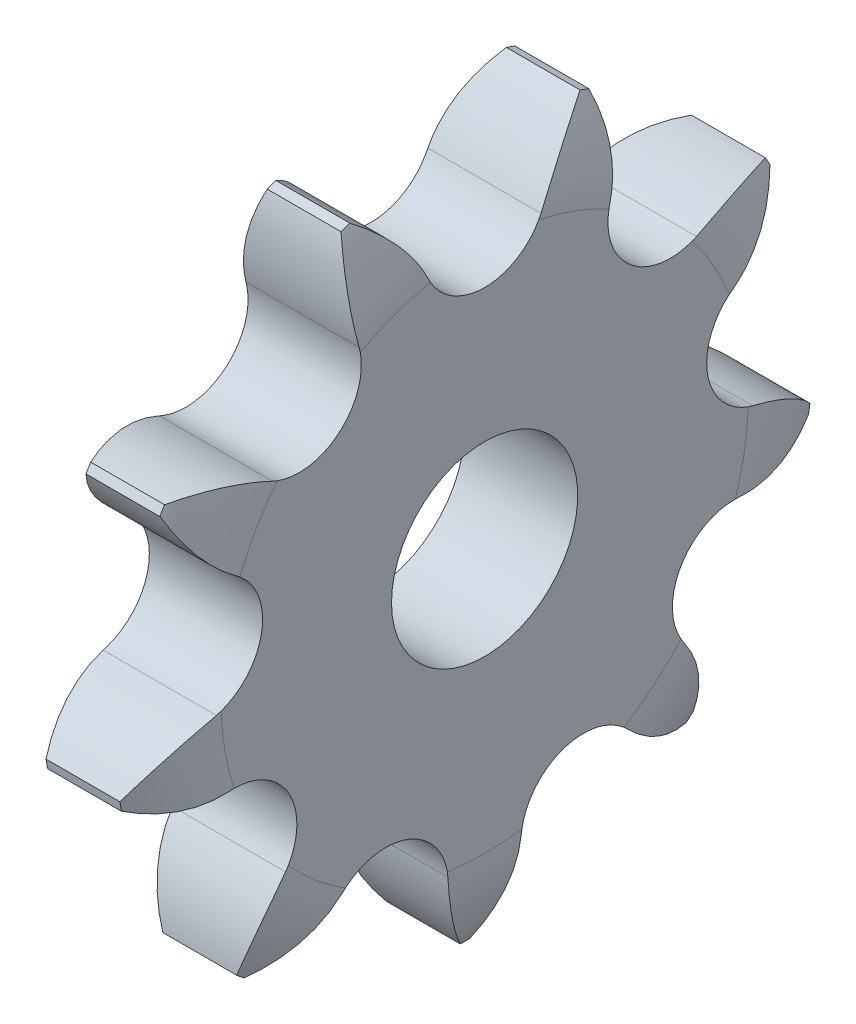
ISO-10303-21;
HEADER;
FILE_DESCRIPTION(('STEP AP214'),'2;1');
FILE_NAME('part.step','',(''),(''),'','','');
FILE_SCHEMA(('AUTOMOTIVE_DESIGN { 1 0 10303 214 1 1 1 1 }'));
ENDSEC;
DATA;
#1=APPLICATION_CONTEXT('core data for automotive mechanical design processes');
#2=APPLICATION_PROTOCOL_DEFINITION('international standard','automotive_design',2000,#1);
#3=PRODUCT_CONTEXT('',#1,'mechanical');
#4=PRODUCT('Part','Part','',(#3));
#5=PRODUCT_RELATED_PRODUCT_CATEGORY('part','',(#4));
#6=PRODUCT_DEFINITION_FORMATION('','',#4);
#7=PRODUCT_DEFINITION_CONTEXT('part definition',#1,'design');
#8=PRODUCT_DEFINITION('design','',#6,#7);
#9=PRODUCT_DEFINITION_SHAPE('','',#8);
#10=(LENGTH_UNIT() NAMED_UNIT(*) SI_UNIT(.MILLI.,.METRE.));
#11=(NAMED_UNIT(*) PLANE_ANGLE_UNIT() SI_UNIT($,.RADIAN.));
#12=(NAMED_UNIT(*) SI_UNIT($,.STERADIAN.) SOLID_ANGLE_UNIT());
#13=UNCERTAINTY_MEASURE_WITH_UNIT(LENGTH_MEASURE(1.E-05),#10,'distance_accuracy_value','');
#14=(GEOMETRIC_REPRESENTATION_CONTEXT(3) GLOBAL_UNCERTAINTY_ASSIGNED_CONTEXT((#13)) GLOBAL_UNIT_ASSIGNED_CONTEXT((#10,
#11,#12)) REPRESENTATION_CONTEXT('',''));
#15=CARTESIAN_POINT('',(0.,0.,0.));
#16=DIRECTION('',(0.,0.,1.));
#17=DIRECTION('',(1.,0.,0.));
#18=AXIS2_PLACEMENT_3D('',#15,#16,#17);
#19=CARTESIAN_POINT('',(-5.4,0.,0.));
#20=DIRECTION('',(-1.,0.,0.));
#21=DIRECTION('',(0.,0.,1.));
#22=AXIS2_PLACEMENT_3D('',#19,#20,#21);
#23=TOROIDAL_SURFACE('',#22,16.9928563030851,12.7);
#24=CARTESIAN_POINT('',(6.0298,11.520500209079,19.360710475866));
#25=CARTESIAN_POINT('',(6.12534620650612,11.5506753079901,19.1132267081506));
#26=CARTESIAN_POINT('',(6.21706086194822,11.5721842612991,18.8631287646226));
#27=CARTESIAN_POINT('',(6.39179749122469,11.597183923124,18.3588349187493));
#28=CARTESIAN_POINT('',(6.4748131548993,11.6006616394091,18.1046361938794));
#29=CARTESIAN_POINT('',(6.62889298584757,11.5890251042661,17.6004651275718));
#30=CARTESIAN_POINT('',(6.70021742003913,11.5744056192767,17.3505615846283));
#31=CARTESIAN_POINT('',(6.83243365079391,11.5268919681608,16.8497794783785));
#32=CARTESIAN_POINT('',(6.89332837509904,11.4940029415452,16.5989012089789));
#33=CARTESIAN_POINT('',(6.9982759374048,11.413670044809,16.1219567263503));
#34=CARTESIAN_POINT('',(7.04338744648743,11.3679390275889,15.8958346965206));
#35=CARTESIAN_POINT('',(7.12340425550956,11.261160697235,15.4454183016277));
#36=CARTESIAN_POINT('',(7.15831076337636,11.2001151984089,15.2211237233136));
#37=CARTESIAN_POINT('',(7.21785824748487,11.0610638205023,14.7703058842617));
#38=CARTESIAN_POINT('',(7.24222633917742,10.982678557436,14.5438629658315));
#39=CARTESIAN_POINT('',(7.27870037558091,10.8101780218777,14.0958784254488));
#40=CARTESIAN_POINT('',(7.29079843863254,10.7160526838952,13.8743400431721));
#41=CARTESIAN_POINT('',(7.29638053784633,10.6142599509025,13.6561537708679));
#42=B_SPLINE_CURVE_WITH_KNOTS('',3,(#24,#25,#26,#27,#28,#29,#30,#31,#32,#33,#34,#35,#36,#37,#38,
#39,#40,#41),.UNSPECIFIED.,.F.,.F.,(4,2,2,2,2,2,2,2,4),(0.,0.80092433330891,1.6024256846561,
2.38249036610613,3.16233571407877,3.86684990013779,4.57128066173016,5.29299505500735,
6.01517274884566),.UNSPECIFIED.);
#43=CARTESIAN_POINT('',(6.03,11.5205633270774,19.3601924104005));
#44=VERTEX_POINT('',#43);
#45=CARTESIAN_POINT('',(7.29637539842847,10.6143532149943,13.6563537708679));
#46=VERTEX_POINT('',#45);
#47=EDGE_CURVE('E701',#44,#46,#42,.T.);
#48=ORIENTED_EDGE('',*,*,#47,.F.);
#49=CARTESIAN_POINT('',(6.03,0.,0.));
#50=DIRECTION('',(-1.,0.,0.));
#51=DIRECTION('',(0.,0.,1.));
#52=AXIS2_PLACEMENT_3D('',#49,#50,#51);
#53=CIRCLE('',#52,22.5286579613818);
#54=CARTESIAN_POINT('',(6.03,11.0061367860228,19.6571967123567));
#55=VERTEX_POINT('',#54);
#56=EDGE_CURVE('E777',#55,#44,#53,.T.);
#57=ORIENTED_EDGE('',*,*,#56,.F.);
#58=CARTESIAN_POINT('',(7.29638108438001,6.5194326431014,16.02027641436));
#59=CARTESIAN_POINT('',(7.29338759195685,6.59320281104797,16.1256387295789));
#60=CARTESIAN_POINT('',(7.28854586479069,6.66887606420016,16.2295905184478));
#61=CARTESIAN_POINT('',(7.2752632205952,6.8238652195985,16.4344913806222));
#62=CARTESIAN_POINT('',(7.26682263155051,6.90318078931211,16.5354407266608));
#63=CARTESIAN_POINT('',(7.23626644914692,7.14621276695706,16.8333527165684));
#64=CARTESIAN_POINT('',(7.20891039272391,7.31515488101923,17.0255796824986));
#65=CARTESIAN_POINT('',(7.1420293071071,7.66087499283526,17.3912605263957));
#66=CARTESIAN_POINT('',(7.10283015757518,7.83734600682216,17.5650666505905));
#67=CARTESIAN_POINT('',(7.01300664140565,8.20052019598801,17.8984744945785));
#68=CARTESIAN_POINT('',(6.9623813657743,8.38722418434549,18.0580750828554));
#69=CARTESIAN_POINT('',(6.85206837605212,8.76468588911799,18.3586825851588));
#70=CARTESIAN_POINT('',(6.7926336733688,8.95523154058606,18.5000497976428));
#71=CARTESIAN_POINT('',(6.66473921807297,9.34336852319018,18.7683067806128));
#72=CARTESIAN_POINT('',(6.5962785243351,9.54096058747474,18.8951950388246));
#73=CARTESIAN_POINT('',(6.44936164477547,9.94708063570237,19.1373467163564));
#74=CARTESIAN_POINT('',(6.37069409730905,10.1557591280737,19.2522284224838));
#75=CARTESIAN_POINT('',(6.20574073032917,10.5778896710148,19.4664527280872));
#76=CARTESIAN_POINT('',(6.11945863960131,10.7913393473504,19.5658028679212));
#77=CARTESIAN_POINT('',(6.02979999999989,11.0066170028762,19.6574010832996));
#78=B_SPLINE_CURVE_WITH_KNOTS('',3,(#58,#59,#60,#61,#62,#63,#64,#65,#66,#67,#68,#69,#70,#71,#72,
#73,#74,#75,#76,#77),.UNSPECIFIED.,.F.,.F.,(4,2,2,2,2,2,2,2,2,4),(0.,0.385891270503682,
0.771747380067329,1.54272810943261,2.29417490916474,3.04568151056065,3.77873754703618,
4.51187007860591,5.26380961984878,6.01538296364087),.UNSPECIFIED.);
#79=CARTESIAN_POINT('',(7.29637539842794,6.51957268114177,16.02047641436));
#80=VERTEX_POINT('',#79);
#81=EDGE_CURVE('E1109',#80,#55,#78,.T.);
#82=ORIENTED_EDGE('',*,*,#81,.F.);
#83=CARTESIAN_POINT('',(7.29637057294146,-0.647122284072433,17.284348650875));
#84=CARTESIAN_POINT('',(7.29897119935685,-0.618431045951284,17.1771968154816));
#85=CARTESIAN_POINT('',(7.30013529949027,-0.585267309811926,17.0712202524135));
#86=CARTESIAN_POINT('',(7.29984139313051,-0.510299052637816,16.8624011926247));
#87=CARTESIAN_POINT('',(7.29838404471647,-0.468496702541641,16.7595579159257));
#88=CARTESIAN_POINT('',(7.29310501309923,-0.376641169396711,16.5579548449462));
#89=CARTESIAN_POINT('',(7.28928850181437,-0.326606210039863,16.4591866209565));
#90=CARTESIAN_POINT('',(7.27964979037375,-0.218621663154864,16.2662097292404));
#91=CARTESIAN_POINT('',(7.27382751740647,-0.160671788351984,16.172001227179));
#92=CARTESIAN_POINT('',(7.25395286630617,0.0244032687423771,15.8972685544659));
#93=CARTESIAN_POINT('',(7.23748386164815,0.162874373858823,15.7243737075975));
#94=CARTESIAN_POINT('',(7.20198579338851,0.466113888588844,15.4038145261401));
#95=CARTESIAN_POINT('',(7.18295564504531,0.63089344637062,15.2561609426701));
#96=CARTESIAN_POINT('',(7.14617043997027,0.986610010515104,14.9867285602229));
#97=CARTESIAN_POINT('',(7.12845430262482,1.17805735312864,14.8656157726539));
#98=CARTESIAN_POINT('',(7.09897258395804,1.57892336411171,14.6571445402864));
#99=CARTESIAN_POINT('',(7.08720573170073,1.7883381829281,14.5697788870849));
#100=CARTESIAN_POINT('',(7.07255720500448,2.21723781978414,14.4320990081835));
#101=CARTESIAN_POINT('',(7.06959608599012,2.43661435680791,14.3814566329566));
#102=CARTESIAN_POINT('',(7.07306168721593,2.88065749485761,14.317512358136));
#103=CARTESIAN_POINT('',(7.07948791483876,3.10532381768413,14.3042084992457));
#104=CARTESIAN_POINT('',(7.09993894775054,3.54871687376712,14.3150775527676));
#105=CARTESIAN_POINT('',(7.11380493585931,3.76747080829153,14.3384861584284));
#106=CARTESIAN_POINT('',(7.14587624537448,4.19796630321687,14.4205505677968));
#107=CARTESIAN_POINT('',(7.16408273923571,4.40970595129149,14.4792159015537));
#108=CARTESIAN_POINT('',(7.20127927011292,4.82591133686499,14.6321087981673));
#109=CARTESIAN_POINT('',(7.22027752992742,5.03006478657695,14.727185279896));
#110=CARTESIAN_POINT('',(7.25418032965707,5.41980652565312,14.9502342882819));
#111=CARTESIAN_POINT('',(7.2690873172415,5.60540587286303,15.0781870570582));
#112=CARTESIAN_POINT('',(7.28890841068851,5.91984100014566,15.3364575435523));
#113=CARTESIAN_POINT('',(7.2951827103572,6.0527627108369,15.4617104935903));
#114=CARTESIAN_POINT('',(7.29957971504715,6.23849075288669,15.6622589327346));
#115=CARTESIAN_POINT('',(7.30020878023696,6.29814853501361,15.7312544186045));
#116=CARTESIAN_POINT('',(7.29966843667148,6.4126446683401,15.8731569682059));
#117=CARTESIAN_POINT('',(7.2984985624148,6.46748176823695,15.9460650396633));
#118=CARTESIAN_POINT('',(7.29636726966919,6.51977268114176,16.0207620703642));
#119=B_SPLINE_CURVE_WITH_KNOTS('',3,(#83,#84,#85,#86,#87,#88,#89,#90,#91,#92,#93,#94,#95,#96,
#97,#98,#99,#100,#101,#102,#103,#104,#105,#106,#107,#108,#109,#110,#111,#112,#113,#114,#115,
#116,#117,#118),.UNSPECIFIED.,.F.,.F.,(4,2,2,2,2,2,2,2,2,2,2,2,2,2,2,2,2,4),(0.,
0.332747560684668,0.665411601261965,0.99734892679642,1.32929830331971,1.99233829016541,
2.65565998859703,3.33409138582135,4.01237778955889,4.68452590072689,5.35663874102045,
6.01494371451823,6.67342671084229,7.34830174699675,8.02277214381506,8.56914168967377,
8.84257702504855,9.11608312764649),.UNSPECIFIED.);
#120=CARTESIAN_POINT('',(7.3,6.32925889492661,15.770150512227));
#121=VERTEX_POINT('',#120);
#122=EDGE_CURVE('E1120',#121,#80,#119,.T.);
#123=ORIENTED_EDGE('',*,*,#122,.F.);
#124=CARTESIAN_POINT('',(7.3,0.,0.));
#125=DIRECTION('',(-1.,0.,0.));
#126=DIRECTION('',(0.,0.,1.));
#127=AXIS2_PLACEMENT_3D('',#124,#125,#126);
#128=CIRCLE('',#127,16.9928563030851);
#129=CARTESIAN_POINT('',(7.3,10.4927215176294,13.3663742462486));
#130=VERTEX_POINT('',#129);
#131=EDGE_CURVE('E763',#121,#130,#128,.T.);
#132=ORIENTED_EDGE('',*,*,#131,.T.);
#133=CARTESIAN_POINT('',(7.29637025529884,10.6144464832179,13.6565537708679));
#134=CARTESIAN_POINT('',(7.29897099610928,10.5675490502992,13.5560285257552));
#135=CARTESIAN_POINT('',(7.30013520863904,10.5248331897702,13.4535287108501));
#136=CARTESIAN_POINT('',(7.29984151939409,10.4480352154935,13.2453756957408));
#137=CARTESIAN_POINT('',(7.29838427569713,10.4139509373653,13.1397232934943));
#138=CARTESIAN_POINT('',(7.29310544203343,10.3547276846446,12.9262430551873));
#139=CARTESIAN_POINT('',(7.28928902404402,10.3295693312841,12.8184204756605));
#140=CARTESIAN_POINT('',(7.27965048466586,10.2882463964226,12.6011806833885));
#141=CARTESIAN_POINT('',(7.27382829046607,10.2720821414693,12.491763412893));
#142=CARTESIAN_POINT('',(7.2539538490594,10.2372619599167,12.1623422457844));
#143=CARTESIAN_POINT('',(7.23748494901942,10.2322015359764,11.9408896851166));
#144=CARTESIAN_POINT('',(7.20198700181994,10.2584434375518,11.5004085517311));
#145=CARTESIAN_POINT('',(7.18295686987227,10.2897612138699,11.2813810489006));
#146=CARTESIAN_POINT('',(7.1461716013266,10.3890665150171,10.8463334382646));
#147=CARTESIAN_POINT('',(7.12845538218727,10.4578730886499,10.6304954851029));
#148=CARTESIAN_POINT('',(7.09897341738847,10.630949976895,10.2131250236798));
#149=CARTESIAN_POINT('',(7.08720640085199,10.7352127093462,10.0115894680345));
#150=CARTESIAN_POINT('',(7.07255749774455,10.9752685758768,9.6304282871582));
#151=CARTESIAN_POINT('',(7.06959617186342,11.1107678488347,9.45062089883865));
#152=CARTESIAN_POINT('',(7.07306137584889,11.4098209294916,9.11621011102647));
#153=CARTESIAN_POINT('',(7.07948741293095,11.5733732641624,8.96160538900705));
#154=CARTESIAN_POINT('',(7.09993812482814,11.9200176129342,8.68492271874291));
#155=CARTESIAN_POINT('',(7.1138039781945,12.1026391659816,8.56224178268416));
#156=CARTESIAN_POINT('',(7.14587509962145,12.4851670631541,8.34838823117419));
#157=CARTESIAN_POINT('',(7.16408154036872,12.6850780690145,8.25722414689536));
#158=CARTESIAN_POINT('',(7.20127805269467,13.1021869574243,8.10681375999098));
#159=CARTESIAN_POINT('',(7.22027634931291,13.3196912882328,8.04841849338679));
#160=CARTESIAN_POINT('',(7.25417931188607,13.7616234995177,7.96876121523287));
#161=CARTESIAN_POINT('',(7.26908642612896,13.9860471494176,7.94747695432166));
#162=CARTESIAN_POINT('',(7.28890680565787,14.3929103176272,7.94320733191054));
#163=CARTESIAN_POINT('',(7.29518084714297,14.5752242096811,7.95371290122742));
#164=CARTESIAN_POINT('',(7.29957876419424,14.8463794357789,7.98794900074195));
#165=CARTESIAN_POINT('',(7.30020835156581,14.9364192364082,8.00245152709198));
#166=CARTESIAN_POINT('',(7.29966951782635,15.1153217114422,8.03754951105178));
#167=CARTESIAN_POINT('',(7.298500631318,15.2041840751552,8.0581465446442));
#168=CARTESIAN_POINT('',(7.29637057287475,15.292246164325,8.08174998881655));
#169=B_SPLINE_CURVE_WITH_KNOTS('',3,(#133,#134,#135,#136,#137,#138,#139,#140,#141,#142,#143,
#144,#145,#146,#147,#148,#149,#150,#151,#152,#153,#154,#155,#156,#157,#158,#159,#160,#161,#162,
#163,#164,#165,#166,#167,#168),.UNSPECIFIED.,.F.,.F.,(4,2,2,2,2,2,2,2,2,2,2,2,2,2,2,2,2,4),(0.,
0.332747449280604,0.66541137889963,0.997348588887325,1.32929784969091,1.992337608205,
2.65565908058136,3.33409033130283,4.01237659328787,4.68452494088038,5.35663800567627,
6.01494293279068,6.67342591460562,7.34830079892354,8.02277093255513,8.56907744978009,
8.84248097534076,9.11595526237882),.UNSPECIFIED.);
#170=EDGE_CURVE('E839',#46,#130,#169,.T.);
#171=ORIENTED_EDGE('',*,*,#170,.F.);
#172=EDGE_LOOP('',(#48,#57,#82,#123,#132,#171));
#173=FACE_BOUND('',#172,.T.);
#174=ADVANCED_FACE('F39',(#173),#23,.T.);
#175=CARTESIAN_POINT('',(7.3,14.9853509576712,8.01226697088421));
#176=VERTEX_POINT('',#175);
#177=CARTESIAN_POINT('',(7.29637539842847,15.292046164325,8.08169639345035));
#178=VERTEX_POINT('',#177);
#179=EDGE_CURVE('E842',#176,#178,#169,.T.);
#180=ORIENTED_EDGE('',*,*,#179,.F.);
#181=CARTESIAN_POINT('',(7.3,16.6296307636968,3.49464533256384));
#182=VERTEX_POINT('',#181);
#183=EDGE_CURVE('E757',#176,#182,#128,.T.);
#184=ORIENTED_EDGE('',*,*,#183,.T.);
#185=CARTESIAN_POINT('',(7.29637025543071,16.9094012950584,3.63869244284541));
#186=CARTESIAN_POINT('',(7.29897099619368,16.8088593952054,3.59183072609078));
#187=CARTESIAN_POINT('',(7.30013520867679,16.710251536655,3.54076853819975));
#188=CARTESIAN_POINT('',(7.29984151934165,16.5176226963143,3.43067886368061));
#189=CARTESIAN_POINT('',(7.29838427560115,16.4236005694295,3.3716533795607));
#190=CARTESIAN_POINT('',(7.29310544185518,16.2410104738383,3.2461860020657));
#191=CARTESIAN_POINT('',(7.28928902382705,16.152431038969,3.17976059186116));
#192=CARTESIAN_POINT('',(7.27965048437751,15.981136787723,3.03990712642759));
#193=CARTESIAN_POINT('',(7.27382829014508,15.8984221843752,2.96647881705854));
#194=CARTESIAN_POINT('',(7.25395384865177,15.6600005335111,2.73650954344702));
#195=CARTESIAN_POINT('',(7.23748494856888,15.5137770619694,2.5701198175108));
#196=CARTESIAN_POINT('',(7.20198700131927,15.2507437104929,2.21582372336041));
#197=CARTESIAN_POINT('',(7.18295686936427,15.1339463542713,2.02790824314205));
#198=CARTESIAN_POINT('',(7.14617160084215,14.9303754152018,1.63081022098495));
#199=CARTESIAN_POINT('',(7.12845538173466,14.844346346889,1.42124074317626));
#200=CARTESIAN_POINT('',(7.09897341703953,14.708650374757,0.990264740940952));
#201=CARTESIAN_POINT('',(7.08720640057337,14.6589757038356,0.768860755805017));
#202=CARTESIAN_POINT('',(7.07255749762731,14.5978634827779,0.32256941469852));
#203=CARTESIAN_POINT('',(7.06959617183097,14.5860839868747,0.0977317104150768));
#204=CARTESIAN_POINT('',(7.07306137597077,14.6002168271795,-0.350669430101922));
#205=CARTESIAN_POINT('',(7.0794874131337,14.6261271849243,-0.574232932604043));
#206=CARTESIAN_POINT('',(7.09993812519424,14.7138239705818,-1.00900284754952));
#207=CARTESIAN_POINT('',(7.11380397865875,14.7748624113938,-1.22036876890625));
#208=CARTESIAN_POINT('',(7.14587510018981,14.9304333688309,-1.63007428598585));
#209=CARTESIAN_POINT('',(7.16408154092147,15.024974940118,-1.82841034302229));
#210=CARTESIAN_POINT('',(7.20127805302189,15.2478169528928,-2.21174380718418));
#211=CARTESIAN_POINT('',(7.22027634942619,15.3768991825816,-2.39628626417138));
#212=CARTESIAN_POINT('',(7.25417931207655,15.6642361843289,-2.74137582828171));
#213=CARTESIAN_POINT('',(7.26908642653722,15.8224734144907,-2.90193725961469));
#214=CARTESIAN_POINT('',(7.28890691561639,16.1314059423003,-3.16673605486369));
#215=CARTESIAN_POINT('',(7.2951810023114,16.2778212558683,-3.27587867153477));
#216=CARTESIAN_POINT('',(7.29957885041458,16.5075478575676,-3.42394897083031));
#217=CARTESIAN_POINT('',(7.30020839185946,16.585845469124,-3.47071627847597));
#218=CARTESIAN_POINT('',(7.2996694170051,16.7454554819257,-3.55882665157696));
#219=CARTESIAN_POINT('',(7.29850043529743,16.8267686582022,-3.60016831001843));
#220=CARTESIAN_POINT('',(7.29637025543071,16.9094012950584,-3.63869244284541));
#221=B_SPLINE_CURVE_WITH_KNOTS('',3,(#185,#186,#187,#188,#189,#190,#191,#192,#193,#194,#195,
#196,#197,#198,#199,#200,#201,#202,#203,#204,#205,#206,#207,#208,#209,#210,#211,#212,#213,#214,
#215,#216,#217,#218,#219,#220),.UNSPECIFIED.,.F.,.F.,(4,2,2,2,2,2,2,2,2,2,2,2,2,2,2,2,2,4),(0.,
0.33274744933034,0.665411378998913,0.997348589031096,1.32929784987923,1.99233760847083,
2.65565908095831,3.33409033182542,4.0123765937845,4.68452494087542,5.35663800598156,
6.01494293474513,6.67342591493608,7.34830079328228,8.0227709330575,8.56908421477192,
8.84249115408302,9.11596885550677),.UNSPECIFIED.);
#222=CARTESIAN_POINT('',(7.29637539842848,16.9092012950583,3.63859918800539));
#223=VERTEX_POINT('',#222);
#224=EDGE_CURVE('E722',#223,#182,#221,.T.);
#225=ORIENTED_EDGE('',*,*,#224,.F.);
#226=CARTESIAN_POINT('',(6.0298,21.2700399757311,7.42592988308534));
#227=CARTESIAN_POINT('',(6.12534620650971,21.1340759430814,7.21695013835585));
#228=CARTESIAN_POINT('',(6.21706086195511,20.9897928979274,7.01153830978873));
#229=CARTESIAN_POINT('',(6.39179749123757,20.6847899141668,6.6091573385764));
#230=CARTESIAN_POINT('',(6.47481315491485,20.5240582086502,6.41219438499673));
#231=CARTESIAN_POINT('',(6.62889298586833,20.191069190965,6.0334567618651));
#232=CARTESIAN_POINT('',(6.70021742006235,20.0192351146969,5.85141676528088));
#233=CARTESIAN_POINT('',(6.83243365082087,19.6609410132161,5.4983366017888));
#234=CARTESIAN_POINT('',(6.89332837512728,19.4744851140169,5.32729335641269));
#235=CARTESIAN_POINT('',(6.99827593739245,19.1063725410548,5.01356967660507));
#236=CARTESIAN_POINT('',(7.04338744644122,18.9259921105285,4.86974548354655));
#237=CARTESIAN_POINT('',(7.12340425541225,18.5546730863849,4.59334229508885));
#238=CARTESIAN_POINT('',(7.1583107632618,18.3637357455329,4.46076197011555));
#239=CARTESIAN_POINT('',(7.21785824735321,17.9674360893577,4.2047959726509));
#240=CARTESIAN_POINT('',(7.24222633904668,17.7618347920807,4.08171570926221));
#241=CARTESIAN_POINT('',(7.27870037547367,17.3417328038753,3.84942084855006));
#242=CARTESIAN_POINT('',(7.2907984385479,17.127226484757,3.74021520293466));
#243=CARTESIAN_POINT('',(7.29638053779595,16.9090012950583,3.63850592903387));
#244=B_SPLINE_CURVE_WITH_KNOTS('',3,(#226,#227,#228,#229,#230,#231,#232,#233,#234,#235,#236,
#237,#238,#239,#240,#241,#242,#243),.UNSPECIFIED.,.F.,.F.,(4,2,2,2,2,2,2,2,4),(0.,
0.800924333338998,1.60242568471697,2.38249036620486,3.16233571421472,3.8668498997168,
4.57128066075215,5.29299505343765,6.01517274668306),.UNSPECIFIED.);
#245=CARTESIAN_POINT('',(6.03,21.2697553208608,7.42549245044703));
#246=VERTEX_POINT('',#245);
#247=EDGE_CURVE('E423',#246,#223,#244,.T.);
#248=ORIENTED_EDGE('',*,*,#247,.F.);
#249=CARTESIAN_POINT('',(6.03,21.066592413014,7.98367795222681));
#250=VERTEX_POINT('',#249);
#251=EDGE_CURVE('E772',#250,#246,#53,.T.);
#252=ORIENTED_EDGE('',*,*,#251,.F.);
#253=CARTESIAN_POINT('',(7.29638022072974,15.291846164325,8.0816428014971));
#254=CARTESIAN_POINT('',(7.29338636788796,15.4160833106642,8.11493608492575));
#255=CARTESIAN_POINT('',(7.28854427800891,15.5408716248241,8.14592555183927));
#256=CARTESIAN_POINT('',(7.27526090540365,15.7913085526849,8.20326280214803));
#257=CARTESIAN_POINT('',(7.26681995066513,15.9169570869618,8.22961100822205));
#258=CARTESIAN_POINT('',(7.23626266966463,16.2946253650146,8.30160561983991));
#259=CARTESIAN_POINT('',(7.20890587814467,16.5476041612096,8.34026523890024));
#260=CARTESIAN_POINT('',(7.14202334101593,17.0474972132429,8.39816661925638));
#261=CARTESIAN_POINT('',(7.10282347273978,17.2944027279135,8.41787554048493));
#262=CARTESIAN_POINT('',(7.01299852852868,17.786921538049,8.4398350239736));
#263=CARTESIAN_POINT('',(6.96237254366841,18.0325347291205,8.44208419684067));
#264=CARTESIAN_POINT('',(6.85205904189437,18.5149107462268,8.4297333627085));
#265=CARTESIAN_POINT('',(6.79262469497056,18.7517427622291,8.41554593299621));
#266=CARTESIAN_POINT('',(6.66473124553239,19.2214982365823,8.37155230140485));
#267=CARTESIAN_POINT('',(6.59627120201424,19.4544212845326,8.34174447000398));
#268=CARTESIAN_POINT('',(6.4493559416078,19.92117236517,8.26619465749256));
#269=CARTESIAN_POINT('',(6.37068937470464,20.1548703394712,8.22006354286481));
#270=CARTESIAN_POINT('',(6.20573820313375,20.6159348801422,8.11282973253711));
#271=CARTESIAN_POINT('',(6.11945732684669,20.8433044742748,8.05173433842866));
#272=CARTESIAN_POINT('',(6.0298,21.0670916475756,7.98352583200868));
#273=B_SPLINE_CURVE_WITH_KNOTS('',3,(#253,#254,#255,#256,#257,#258,#259,#260,#261,#262,#263,
#264,#265,#266,#267,#268,#269,#270,#271,#272),.UNSPECIFIED.,.F.,.F.,(4,2,2,2,2,2,2,2,2,4),(0.,
0.385891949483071,0.771748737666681,1.54273082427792,2.29417907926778,3.04568713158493,
3.77873284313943,4.51185504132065,5.26378354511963,6.01534588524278),.UNSPECIFIED.);
#274=EDGE_CURVE('E687',#178,#250,#273,.T.);
#275=ORIENTED_EDGE('',*,*,#274,.F.);
#276=EDGE_LOOP('',(#180,#184,#225,#248,#252,#275));
#277=FACE_BOUND('',#276,.T.);
#278=ADVANCED_FACE('F977',(#277),#23,.T.);
#279=CARTESIAN_POINT('',(6.0298,-3.61960964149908,22.2363994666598));
#280=CARTESIAN_POINT('',(6.12534622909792,-3.43741463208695,22.0662120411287));
#281=CARTESIAN_POINT('',(6.21706090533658,-3.26017791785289,21.8884515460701));
#282=CARTESIAN_POINT('',(6.39179757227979,-2.91687315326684,21.5182094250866));
#283=CARTESIAN_POINT('',(6.47481325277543,-2.75081324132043,21.325717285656));
#284=CARTESIAN_POINT('',(6.62889311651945,-2.43565235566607,20.9320199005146));
#285=CARTESIAN_POINT('',(6.70021756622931,-2.28621659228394,20.7311853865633));
#286=CARTESIAN_POINT('',(6.83243382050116,-2.00071756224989,20.3170227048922));
#287=CARTESIAN_POINT('',(6.8933285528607,-1.86465054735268,20.1036980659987));
#288=CARTESIAN_POINT('',(6.99827585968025,-1.61961568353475,19.6867013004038));
#289=CARTESIAN_POINT('',(7.04338715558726,-1.50929977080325,19.4840874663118));
#290=CARTESIAN_POINT('',(7.12340364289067,-1.30157557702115,19.0704148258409));
#291=CARTESIAN_POINT('',(7.15831004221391,-1.20416576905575,18.8593570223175));
#292=CARTESIAN_POINT('',(7.21785741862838,-1.02090586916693,18.4246323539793));
#293=CARTESIAN_POINT('',(7.24222551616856,-0.935398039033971,18.2007831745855));
#294=CARTESIAN_POINT('',(7.27869970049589,-0.779582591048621,17.7467284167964));
#295=CARTESIAN_POINT('',(7.29079790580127,-0.709284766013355,17.5165188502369));
#296=CARTESIAN_POINT('',(7.29638022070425,-0.647015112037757,17.283948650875));
#297=B_SPLINE_CURVE_WITH_KNOTS('',3,(#279,#280,#281,#282,#283,#284,#285,#286,#287,#288,#289,
#290,#291,#292,#293,#294,#295,#296),.UNSPECIFIED.,.F.,.F.,(4,2,2,2,2,2,2,2,4),(0.,
0.800924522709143,1.60242606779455,2.38249098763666,3.1623365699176,3.86684724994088,
4.57127450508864,5.29298517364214,6.01515913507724),.UNSPECIFIED.);
#298=CARTESIAN_POINT('',(6.03,-3.61922828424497,22.236043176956));
#299=VERTEX_POINT('',#298);
#300=CARTESIAN_POINT('',(7.29637539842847,-0.647068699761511,17.284148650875));
#301=VERTEX_POINT('',#300);
#302=EDGE_CURVE('E1048',#299,#301,#297,.T.);
#303=ORIENTED_EDGE('',*,*,#302,.F.);
#304=CARTESIAN_POINT('',(6.03,-4.20421256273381,22.1328946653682));
#305=VERTEX_POINT('',#304);
#306=EDGE_CURVE('E782',#305,#299,#53,.T.);
#307=ORIENTED_EDGE('',*,*,#306,.F.);
#308=CARTESIAN_POINT('',(7.29638007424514,-5.30346381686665,16.4628974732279));
#309=CARTESIAN_POINT('',(7.29338616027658,-5.31467767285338,16.5910285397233));
#310=CARTESIAN_POINT('',(7.28854400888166,-5.32352700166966,16.7193023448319));
#311=CARTESIAN_POINT('',(7.27526051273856,-5.33650510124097,16.9758911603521));
#312=CARTESIAN_POINT('',(7.2668194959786,-5.34063430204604,17.1042061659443));
#313=CARTESIAN_POINT('',(7.23626202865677,-5.34595350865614,17.4886386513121));
#314=CARTESIAN_POINT('',(7.20890511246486,-5.34009633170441,17.7444873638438));
#315=CARTESIAN_POINT('',(7.14202232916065,-5.31031221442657,18.246840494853));
#316=CARTESIAN_POINT('',(7.10282233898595,-5.28684685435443,18.4934174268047));
#317=CARTESIAN_POINT('',(7.01299715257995,-5.22294739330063,18.9822670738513));
#318=CARTESIAN_POINT('',(6.96237104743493,-5.18251194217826,19.2245394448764));
#319=CARTESIAN_POINT('',(6.85205745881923,-5.0865848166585,19.6974417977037));
#320=CARTESIAN_POINT('',(6.79262317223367,-5.03148747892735,19.9282115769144));
#321=CARTESIAN_POINT('',(6.66472989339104,-4.90659010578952,20.3831898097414));
#322=CARTESIAN_POINT('',(6.59626996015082,-4.83678853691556,20.6073975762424));
#323=CARTESIAN_POINT('',(6.44935497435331,-4.68133625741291,21.053937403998));
#324=CARTESIAN_POINT('',(6.3706885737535,-4.59532491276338,21.2760738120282));
#325=CARTESIAN_POINT('',(6.20573777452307,-4.40965760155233,21.7115116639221));
#326=CARTESIAN_POINT('',(6.11945710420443,-4.3100082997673,21.924817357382));
#327=CARTESIAN_POINT('',(6.0298,-4.20397606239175,22.1333599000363));
#328=B_SPLINE_CURVE_WITH_KNOTS('',3,(#308,#309,#310,#311,#312,#313,#314,#315,#316,#317,#318,
#319,#320,#321,#322,#323,#324,#325,#326,#327),.UNSPECIFIED.,.F.,.F.,(4,2,2,2,2,2,2,2,2,4),(0.,
0.385892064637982,0.771748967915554,1.54273128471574,2.29417978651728,3.04568808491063,
3.77873204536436,4.51185249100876,5.26377912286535,6.01533959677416),.UNSPECIFIED.);
#329=CARTESIAN_POINT('',(7.29637539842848,-5.30348131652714,16.4630974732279));
#330=VERTEX_POINT('',#329);
#331=EDGE_CURVE('E1046',#330,#305,#328,.T.);
#332=ORIENTED_EDGE('',*,*,#331,.F.);
#333=CARTESIAN_POINT('',(7.29636970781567,-11.6059199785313,12.8246383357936));
#334=CARTESIAN_POINT('',(7.29897064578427,-11.5150660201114,12.7609968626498));
#335=CARTESIAN_POINT('',(7.30013505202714,-11.421541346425,12.7011305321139));
#336=CARTESIAN_POINT('',(7.29984173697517,-11.229887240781,12.5893528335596));
#337=CARTESIAN_POINT('',(7.2983846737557,-11.1317589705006,12.5374394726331));
#338=CARTESIAN_POINT('',(7.29310618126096,-10.9318066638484,12.4420443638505));
#339=CARTESIAN_POINT('',(7.28928992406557,-10.8299911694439,12.3985444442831));
#340=CARTESIAN_POINT('',(7.27965168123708,-10.6232279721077,12.3201248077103));
#341=CARTESIAN_POINT('',(7.2738296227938,-10.5182801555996,12.2852054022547));
#342=CARTESIAN_POINT('',(7.25395554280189,-10.1999108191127,12.1937089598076));
#343=CARTESIAN_POINT('',(7.23748682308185,-9.98270173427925,12.1502692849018));
#344=CARTESIAN_POINT('',(7.20198908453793,-9.54435619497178,12.0996211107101));
#345=CARTESIAN_POINT('',(7.18295898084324,-9.32321811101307,12.0924280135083));
#346=CARTESIAN_POINT('',(7.14617360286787,-8.87753575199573,12.1146766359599));
#347=CARTESIAN_POINT('',(7.12845724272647,-8.65302863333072,12.1449565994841));
#348=CARTESIAN_POINT('',(7.09897485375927,-8.2119440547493,12.2429256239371));
#349=CARTESIAN_POINT('',(7.08720755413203,-7.99536491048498,12.3106066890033));
#350=CARTESIAN_POINT('',(7.07255800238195,-7.57830804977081,12.4808249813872));
#351=CARTESIAN_POINT('',(7.06959631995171,-7.37770237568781,12.5830412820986));
#352=CARTESIAN_POINT('',(7.07306083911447,-6.99644030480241,12.8194790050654));
#353=CARTESIAN_POINT('',(7.07948654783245,-6.81578286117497,12.9536987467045));
#354=CARTESIAN_POINT('',(7.09993670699,-6.48310755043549,13.2470293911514));
#355=CARTESIAN_POINT('',(7.11380232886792,-6.33057753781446,13.405572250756));
#356=CARTESIAN_POINT('',(7.1458731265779,-6.05354554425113,13.7451516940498));
#357=CARTESIAN_POINT('',(7.16407947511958,-5.92905115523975,13.926194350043));
#358=CARTESIAN_POINT('',(7.20127595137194,-5.70849333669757,14.3108464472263));
#359=CARTESIAN_POINT('',(7.22027430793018,-5.61321478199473,14.5149054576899));
#360=CARTESIAN_POINT('',(7.25417755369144,-5.4580244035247,14.9362901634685));
#361=CARTESIAN_POINT('',(7.26908489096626,-5.39809140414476,15.1536078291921));
#362=CARTESIAN_POINT('',(7.28890595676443,-5.32323249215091,15.5535509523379));
#363=CARTESIAN_POINT('',(7.29518034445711,-5.30191866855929,15.7349224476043));
#364=CARTESIAN_POINT('',(7.29957863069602,-5.28854771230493,16.0079080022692));
#365=CARTESIAN_POINT('',(7.30020831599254,-5.28719433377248,16.0990998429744));
#366=CARTESIAN_POINT('',(7.29966961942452,-5.29069256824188,16.2813823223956));
#367=CARTESIAN_POINT('',(7.29850077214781,-5.29554578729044,16.3724729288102));
#368=CARTESIAN_POINT('',(7.29637071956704,-5.3034988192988,16.4632974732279));
#369=B_SPLINE_CURVE_WITH_KNOTS('',3,(#333,#334,#335,#336,#337,#338,#339,#340,#341,#342,#343,
#344,#345,#346,#347,#348,#349,#350,#351,#352,#353,#354,#355,#356,#357,#358,#359,#360,#361,#362,
#363,#364,#365,#366,#367,#368),.UNSPECIFIED.,.F.,.F.,(4,2,2,2,2,2,2,2,2,2,2,2,2,2,2,2,2,4),(0.,
0.33274725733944,0.665410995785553,0.997348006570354,1.32929706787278,1.9923364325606,
2.65565751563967,3.33408851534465,4.01237453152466,4.68452327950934,5.35663673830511,
6.01494161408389,6.67342454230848,7.34829905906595,8.02276884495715,8.56908494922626,
8.84249330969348,9.11597243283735),.UNSPECIFIED.);
#370=CARTESIAN_POINT('',(7.3,-5.28836374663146,16.1490053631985));
#371=VERTEX_POINT('',#370);
#372=EDGE_CURVE('E1123',#371,#330,#369,.T.);
#373=ORIENTED_EDGE('',*,*,#372,.F.);
#374=CARTESIAN_POINT('',(7.3,-0.55384874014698,16.9838280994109));
#375=VERTEX_POINT('',#374);
#376=EDGE_CURVE('E767',#371,#375,#128,.T.);
#377=ORIENTED_EDGE('',*,*,#376,.T.);
#378=EDGE_CURVE('E1049',#301,#375,#119,.T.);
#379=ORIENTED_EDGE('',*,*,#378,.F.);
#380=EDGE_LOOP('',(#303,#307,#332,#373,#377,#379));
#381=FACE_BOUND('',#380,.T.);
#382=ADVANCED_FACE('F983',(#381),#23,.T.);
#383=CARTESIAN_POINT('',(6.0298,-17.0660639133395,14.7074300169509));
#384=CARTESIAN_POINT('',(6.12534616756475,-16.8171002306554,14.6941715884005));
#385=CARTESIAN_POINT('',(6.2170607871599,-16.5670669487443,14.6719247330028));
#386=CARTESIAN_POINT('',(6.39179735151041,-16.0660935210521,14.6089749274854));
#387=CARTESIAN_POINT('',(6.47481298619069,-15.8151528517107,14.5682586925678));
#388=CARTESIAN_POINT('',(6.62889276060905,-15.3206621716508,14.4692506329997));
#389=CARTESIAN_POINT('',(6.70021716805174,-15.0770939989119,14.4114580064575));
#390=CARTESIAN_POINT('',(6.83243335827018,-14.5921708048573,14.2777064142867));
#391=CARTESIAN_POINT('',(6.89332806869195,-14.3508151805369,14.2017525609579));
#392=CARTESIAN_POINT('',(6.99827607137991,-13.8950644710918,14.039819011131));
#393=CARTESIAN_POINT('',(7.04338794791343,-13.6803170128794,13.9555163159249));
#394=CARTESIAN_POINT('',(7.1234053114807,-13.2552817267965,13.7721444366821));
#395=CARTESIAN_POINT('',(7.15831200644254,-13.0449933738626,13.6730770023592));
#396=CARTESIAN_POINT('',(7.2178596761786,-12.6251669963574,13.4578521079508));
#397=CARTESIAN_POINT('',(7.24222775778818,-12.4157739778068,13.3413349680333));
#398=CARTESIAN_POINT('',(7.27870153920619,-12.0045464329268,13.0936605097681));
#399=CARTESIAN_POINT('',(7.29079935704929,-11.802716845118,12.9624938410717));
#400=CARTESIAN_POINT('',(7.2963810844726,-11.6055199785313,12.8243582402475));
#401=B_SPLINE_CURVE_WITH_KNOTS('',3,(#383,#384,#385,#386,#387,#388,#389,#390,#391,#392,#393,
#394,#395,#396,#397,#398,#399,#400),.UNSPECIFIED.,.F.,.F.,(4,2,2,2,2,2,2,2,4),(0.,
0.800924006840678,1.60242502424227,2.38248929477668,3.16233423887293,3.8668544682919,
4.57129127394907,5.29301208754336,6.01519621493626),.UNSPECIFIED.);
#402=CARTESIAN_POINT('',(6.03,-17.0655427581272,14.7074022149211));
#403=VERTEX_POINT('',#402);
#404=CARTESIAN_POINT('',(7.29637539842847,-11.6057199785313,12.8244982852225));
#405=VERTEX_POINT('',#404);
#406=EDGE_CURVE('E1092',#403,#405,#401,.T.);
#407=ORIENTED_EDGE('',*,*,#406,.F.);
#408=CARTESIAN_POINT('',(6.03,-17.4473641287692,14.2523652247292));
#409=VERTEX_POINT('',#408);
#410=EDGE_CURVE('E1022',#409,#403,#53,.T.);
#411=ORIENTED_EDGE('',*,*,#410,.F.);
#412=CARTESIAN_POINT('',(7.29638198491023,-14.6447774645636,9.20225226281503));
#413=CARTESIAN_POINT('',(7.29338886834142,-14.7357292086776,9.29319717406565));
#414=CARTESIAN_POINT('',(7.28854751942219,-14.8249614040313,9.38577132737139));
#415=CARTESIAN_POINT('',(7.27526563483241,-14.9998361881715,9.57398553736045));
#416=CARTESIAN_POINT('',(7.26682542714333,-15.0854791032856,9.66962531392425));
#417=CARTESIAN_POINT('',(7.23627039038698,-15.3366637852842,9.9606955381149));
#418=CARTESIAN_POINT('',(7.20891510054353,-15.4966344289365,10.1604499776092));
#419=CARTESIAN_POINT('',(7.14203552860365,-15.7967272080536,10.5644158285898));
#420=CARTESIAN_POINT('',(7.10283712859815,-15.9372495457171,10.7683860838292));
#421=CARTESIAN_POINT('',(7.01301510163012,-16.202528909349,11.1839367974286));
#422=CARTESIAN_POINT('',(6.96239056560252,-16.3272846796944,11.395517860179));
#423=CARTESIAN_POINT('',(6.8520781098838,-16.5577830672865,11.8194469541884));
#424=CARTESIAN_POINT('',(6.79264303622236,-16.6639170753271,12.0316488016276));
#425=CARTESIAN_POINT('',(6.66474753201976,-16.8607036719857,12.460477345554));
#426=CARTESIAN_POINT('',(6.59628616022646,-16.9513546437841,12.6771045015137));
#427=CARTESIAN_POINT('',(6.44936759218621,-17.1193089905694,13.1191103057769));
#428=CARTESIAN_POINT('',(6.37069902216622,-17.1962102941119,13.3445708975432));
#429=CARTESIAN_POINT('',(6.20574336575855,-17.3338804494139,13.7974948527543));
#430=CARTESIAN_POINT('',(6.11946000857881,-17.3946571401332,14.0249571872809));
#431=CARTESIAN_POINT('',(6.02979999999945,-17.447482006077,14.2528736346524));
#432=B_SPLINE_CURVE_WITH_KNOTS('',3,(#412,#413,#414,#415,#416,#417,#418,#419,#420,#421,#422,
#423,#424,#425,#426,#427,#428,#429,#430,#431),.UNSPECIFIED.,.F.,.F.,(4,2,2,2,2,2,2,2,2,4),(0.,
0.385890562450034,0.771745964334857,1.54272527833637,2.29417056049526,3.04567564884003,
3.77874245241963,4.51188575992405,5.26383681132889,6.01542163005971),.UNSPECIFIED.);
#433=CARTESIAN_POINT('',(7.29637539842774,-14.6449774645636,9.20245225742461));
#434=VERTEX_POINT('',#433);
#435=EDGE_CURVE('E1199',#434,#409,#432,.T.);
#436=ORIENTED_EDGE('',*,*,#435,.F.);
#437=CARTESIAN_POINT('',(7.29637071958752,-17.1341258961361,2.36410515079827));
#438=CARTESIAN_POINT('',(7.29897129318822,-17.0236197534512,2.37375395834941));
#439=CARTESIAN_POINT('',(7.30013534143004,-16.9134943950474,2.38801140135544));
#440=CARTESIAN_POINT('',(7.29984133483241,-16.6948296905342,2.42558002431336));
#441=CARTESIAN_POINT('',(7.29838393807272,-16.5862899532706,2.448888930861));
#442=CARTESIAN_POINT('',(7.29310481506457,-16.3717991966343,2.50434131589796));
#443=CARTESIAN_POINT('',(7.2892882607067,-16.2658430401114,2.53646538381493));
#444=CARTESIAN_POINT('',(7.27964946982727,-16.0570466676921,2.60929966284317));
#445=CARTESIAN_POINT('',(7.27382716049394,-15.9542065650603,2.65001018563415));
#446=CARTESIAN_POINT('',(7.25395241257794,-15.6515099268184,2.78456721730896));
#447=CARTESIAN_POINT('',(7.23748335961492,-15.4571966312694,2.89091209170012));
#448=CARTESIAN_POINT('',(7.20198523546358,-15.088850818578,3.13388083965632));
#449=CARTESIAN_POINT('',(7.18295507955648,-14.9148269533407,3.2705175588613));
#450=CARTESIAN_POINT('',(7.14616990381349,-14.5877187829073,3.57404413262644));
#451=CARTESIAN_POINT('',(7.12845380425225,-14.435201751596,3.74155221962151));
#452=CARTESIAN_POINT('',(7.09897219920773,-14.1602885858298,4.1001280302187));
#453=CARTESIAN_POINT('',(7.08720542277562,-14.037886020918,4.29119071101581));
#454=CARTESIAN_POINT('',(7.07255706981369,-13.8278208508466,4.68966689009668));
#455=CARTESIAN_POINT('',(7.06959604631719,-13.7398538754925,4.89691676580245));
#456=CARTESIAN_POINT('',(7.0730618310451,-13.5997745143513,5.32311025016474));
#457=CARTESIAN_POINT('',(7.07948814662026,-13.5476602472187,5.54205324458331));
#458=CARTESIAN_POINT('',(7.09993932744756,-13.4813705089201,5.98059762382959));
#459=CARTESIAN_POINT('',(7.1138053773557,-13.4664376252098,6.20009307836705));
#460=CARTESIAN_POINT('',(7.14587677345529,-13.4725012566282,6.63829870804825));
#461=CARTESIAN_POINT('',(7.16408329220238,-13.4935074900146,6.85700865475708));
#462=CARTESIAN_POINT('',(7.20127983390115,-13.5718050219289,7.29344043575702));
#463=CARTESIAN_POINT('',(7.22027807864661,-13.6299865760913,7.51100213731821));
#464=CARTESIAN_POINT('',(7.25418080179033,-13.7819697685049,7.93355469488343));
#465=CARTESIAN_POINT('',(7.26908772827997,-13.8757500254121,8.13855301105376));
#466=CARTESIAN_POINT('',(7.28890809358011,-14.0754904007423,8.49304852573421));
#467=CARTESIAN_POINT('',(7.29518207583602,-14.1757517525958,8.64569090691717));
#468=CARTESIAN_POINT('',(7.29957932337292,-14.3409895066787,8.86340893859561));
#469=CARTESIAN_POINT('',(7.30020859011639,-14.3985728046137,8.93413715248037));
#470=CARTESIAN_POINT('',(7.29966890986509,-14.5184278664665,9.07152720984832));
#471=CARTESIAN_POINT('',(7.29849949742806,-14.5807008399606,9.13818799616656));
#472=CARTESIAN_POINT('',(7.29636880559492,-14.6451774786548,9.20265225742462));
#473=B_SPLINE_CURVE_WITH_KNOTS('',3,(#437,#438,#439,#440,#441,#442,#443,#444,#445,#446,#447,
#448,#449,#450,#451,#452,#453,#454,#455,#456,#457,#458,#459,#460,#461,#462,#463,#464,#465,#466,
#467,#468,#469,#470,#471,#472),.UNSPECIFIED.,.F.,.F.,(4,2,2,2,2,2,2,2,2,2,2,2,2,2,2,2,2,4),(0.,
0.332747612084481,0.665411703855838,0.997349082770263,1.32929851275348,1.99233860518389,
2.65566040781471,3.33409187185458,4.01237834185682,4.68452634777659,5.35663908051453,
6.01494405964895,6.67342707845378,7.34830224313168,8.02277270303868,8.56910610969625,
8.84252320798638,9.11601107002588),.UNSPECIFIED.);
#474=CARTESIAN_POINT('',(7.3,-14.4315022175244,8.97156112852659));
#475=VERTEX_POINT('',#474);
#476=EDGE_CURVE('E1143',#475,#434,#473,.T.);
#477=ORIENTED_EDGE('',*,*,#476,.F.);
#478=CARTESIAN_POINT('',(7.3,-11.3412670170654,12.6543600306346));
#479=VERTEX_POINT('',#478);
#480=EDGE_CURVE('E1215',#475,#479,#128,.T.);
#481=ORIENTED_EDGE('',*,*,#480,.T.);
#482=EDGE_CURVE('E1122',#405,#479,#369,.T.);
#483=ORIENTED_EDGE('',*,*,#482,.F.);
#484=EDGE_LOOP('',(#407,#411,#436,#477,#481,#483));
#485=FACE_BOUND('',#484,.T.);
#486=ADVANCED_FACE('F1209',(#485),#23,.T.);
#487=CARTESIAN_POINT('',(6.02980000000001,-22.527117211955,0.296690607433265));
#488=CARTESIAN_POINT('',(6.12534623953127,-22.3278774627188,0.446564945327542));
#489=CARTESIAN_POINT('',(6.21706092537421,-22.1220406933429,0.590241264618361));
#490=CARTESIAN_POINT('',(6.39179760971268,-21.6978090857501,0.864038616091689));
#491=CARTESIAN_POINT('',(6.47481329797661,-21.4794053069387,0.994149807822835));
#492=CARTESIAN_POINT('',(6.62889317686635,-21.0369618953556,1.23615788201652));
#493=CARTESIAN_POINT('',(6.70021763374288,-20.8132292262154,1.34844884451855));
#494=CARTESIAN_POINT('',(6.83243389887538,-20.3557821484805,1.55769192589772));
#495=CARTESIAN_POINT('',(6.89332863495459,-20.1220705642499,1.65464834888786));
#496=CARTESIAN_POINT('',(6.99827582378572,-19.6688595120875,1.82354966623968));
#497=CARTESIAN_POINT('',(7.04338702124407,-19.4501681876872,1.89700594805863));
#498=CARTESIAN_POINT('',(7.1234033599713,-19.0067102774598,2.02974058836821));
#499=CARTESIAN_POINT('',(7.15830970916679,-18.7819444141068,2.08902062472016));
#500=CARTESIAN_POINT('',(7.21785703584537,-18.3220025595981,2.19400712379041));
#501=CARTESIAN_POINT('',(7.24222513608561,-18.086706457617,2.239344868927));
#502=CARTESIAN_POINT('',(7.27869938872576,-17.6124939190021,2.31394737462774));
#503=CARTESIAN_POINT('',(7.29079765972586,-17.3735752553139,2.34320179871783));
#504=CARTESIAN_POINT('',(7.29638007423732,-17.1337258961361,2.36414013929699));
#505=B_SPLINE_CURVE_WITH_KNOTS('',3,(#487,#488,#489,#490,#491,#492,#493,#494,#495,#496,#497,
#498,#499,#500,#501,#502,#503,#504),.UNSPECIFIED.,.F.,.F.,(4,2,2,2,2,2,2,2,4),(0.,
0.800924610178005,1.60242624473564,2.38249127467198,3.16233696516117,3.86684602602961,
4.57127166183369,5.29298061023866,6.01515284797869),.UNSPECIFIED.);
#506=CARTESIAN_POINT('',(6.03,-22.5267001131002,0.29700430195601));
#507=VERTEX_POINT('',#506);
#508=CARTESIAN_POINT('',(7.29637539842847,-17.1339258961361,2.36412264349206));
#509=VERTEX_POINT('',#508);
#510=EDGE_CURVE('E1056',#507,#509,#505,.T.);
#511=ORIENTED_EDGE('',*,*,#510,.F.);
#512=CARTESIAN_POINT('',(6.03,-22.5267001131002,-0.297004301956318));
#513=VERTEX_POINT('',#512);
#514=EDGE_CURVE('E1018',#513,#507,#53,.T.);
#515=ORIENTED_EDGE('',*,*,#514,.F.);
#516=CARTESIAN_POINT('',(7.29638007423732,-17.1337258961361,-2.36414013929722));
#517=CARTESIAN_POINT('',(7.2933861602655,-17.2618576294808,-2.3529339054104));
#518=CARTESIAN_POINT('',(7.28854400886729,-17.3897193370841,-2.33937428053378));
#519=CARTESIAN_POINT('',(7.27526051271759,-17.6446636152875,-2.3075990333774));
#520=CARTESIAN_POINT('',(7.26681949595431,-17.7717462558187,-2.28938383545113));
#521=CARTESIAN_POINT('',(7.23626202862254,-18.1512620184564,-2.22786623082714));
#522=CARTESIAN_POINT('',(7.20890511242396,-18.4022067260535,-2.17767037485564));
#523=CARTESIAN_POINT('',(7.14202232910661,-18.8917560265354,-2.06110603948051));
#524=CARTESIAN_POINT('',(7.1028223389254,-19.1305121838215,-1.99517953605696));
#525=CARTESIAN_POINT('',(7.01299715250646,-19.6008390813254,-1.84736300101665));
#526=CARTESIAN_POINT('',(6.96237104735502,-19.8324092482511,-1.76547169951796));
#527=CARTESIAN_POINT('',(6.85205745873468,-20.2814695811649,-1.58888329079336));
#528=CARTESIAN_POINT('',(6.79262317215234,-20.4991658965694,-1.49455025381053));
#529=CARTESIAN_POINT('',(6.66472989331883,-20.9255437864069,-1.29254421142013));
#530=CARTESIAN_POINT('',(6.5962699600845,-21.1342244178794,-1.18486981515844));
#531=CARTESIAN_POINT('',(6.44935497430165,-21.5469862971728,-0.954238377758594));
#532=CARTESIAN_POINT('',(6.37068857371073,-21.7508122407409,-0.830960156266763));
#533=CARTESIAN_POINT('',(6.20573777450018,-22.1473940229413,-0.572500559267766));
#534=CARTESIAN_POINT('',(6.11945710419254,-22.3401552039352,-0.437325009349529));
#535=CARTESIAN_POINT('',(6.0298,-22.527117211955,-0.296690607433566));
#536=B_SPLINE_CURVE_WITH_KNOTS('',3,(#516,#517,#518,#519,#520,#521,#522,#523,#524,#525,#526,
#527,#528,#529,#530,#531,#532,#533,#534,#535),.UNSPECIFIED.,.F.,.F.,(4,2,2,2,2,2,2,2,2,4),(0.,
0.385892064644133,0.771748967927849,1.54273128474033,2.29417978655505,3.04568808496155,
3.77873204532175,4.51185249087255,5.26377912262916,6.0153395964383),.UNSPECIFIED.);
#537=CARTESIAN_POINT('',(7.29637539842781,-17.1339258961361,-2.36412264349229));
#538=VERTEX_POINT('',#537);
#539=EDGE_CURVE('E1192',#538,#513,#536,.T.);
#540=ORIENTED_EDGE('',*,*,#539,.F.);
#541=CARTESIAN_POINT('',(7.29636880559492,-14.6451774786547,-9.20265225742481));
#542=CARTESIAN_POINT('',(7.29897006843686,-14.5667255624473,-9.12423063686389));
#543=CARTESIAN_POINT('',(7.30013479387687,-14.4915276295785,-9.04252330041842));
#544=CARTESIAN_POINT('',(7.29984209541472,-14.3481661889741,-8.8731923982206));
#545=CARTESIAN_POINT('',(7.29838532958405,-14.2800009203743,-8.78557032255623));
#546=CARTESIAN_POINT('',(7.2931073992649,-14.1513320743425,-8.60522235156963));
#547=CARTESIAN_POINT('',(7.28929140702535,-14.0908120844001,-8.51250802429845));
#548=CARTESIAN_POINT('',(7.27965365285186,-13.9776779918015,-8.32250473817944));
#549=CARTESIAN_POINT('',(7.27383181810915,-13.9250641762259,-8.22521561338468));
#550=CARTESIAN_POINT('',(7.25395833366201,-13.7796706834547,-7.92757292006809));
#551=CARTESIAN_POINT('',(7.23748991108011,-13.6991709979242,-7.72120793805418));
#552=CARTESIAN_POINT('',(7.20199251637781,-13.5731702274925,-7.29831847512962));
#553=CARTESIAN_POINT('',(7.18296245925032,-13.5276840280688,-7.08178971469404));
#554=CARTESIAN_POINT('',(7.14617690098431,-13.4721982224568,-6.63901577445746));
#555=CARTESIAN_POINT('',(7.12846030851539,-13.4630305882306,-6.41266161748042));
#556=CARTESIAN_POINT('',(7.0989772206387,-13.4829130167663,-5.96126607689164));
#557=CARTESIAN_POINT('',(7.08720945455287,-13.5119549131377,-5.73622442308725));
#558=CARTESIAN_POINT('',(7.07255883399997,-13.6071614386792,-5.29594445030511));
#559=CARTESIAN_POINT('',(7.06959656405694,-13.672987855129,-5.08063586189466));
#560=CARTESIAN_POINT('',(7.07305995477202,-13.8396239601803,-4.66410690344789));
#561=CARTESIAN_POINT('',(7.07948512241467,-13.9404318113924,-4.46288579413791));
#562=CARTESIAN_POINT('',(7.09993437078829,-14.1715339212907,-4.08432569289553));
#563=CARTESIAN_POINT('',(7.11379961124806,-14.3011797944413,-3.90658096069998));
#564=CARTESIAN_POINT('',(7.14586987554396,-14.5874907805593,-3.57478746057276));
#565=CARTESIAN_POINT('',(7.16407607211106,-14.7441631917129,-3.42074511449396));
#566=CARTESIAN_POINT('',(7.20127248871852,-15.0846690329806,-3.13674061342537));
#567=CARTESIAN_POINT('',(7.22027094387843,-15.2690814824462,-3.00747331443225));
#568=CARTESIAN_POINT('',(7.25417465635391,-15.6571131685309,-2.78146415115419));
#569=CARTESIAN_POINT('',(7.26908236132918,-15.8607208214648,-2.68470282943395));
#570=CARTESIAN_POINT('',(7.28890464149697,-16.2415936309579,-2.54152542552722));
#571=CARTESIAN_POINT('',(7.29517963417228,-16.4165149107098,-2.48903717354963));
#572=CARTESIAN_POINT('',(7.29957847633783,-16.6830412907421,-2.42846217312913));
#573=CARTESIAN_POINT('',(7.30020828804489,-16.7726161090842,-2.41129304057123));
#574=CARTESIAN_POINT('',(7.29966971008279,-16.9527436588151,-2.38308354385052));
#575=CARTESIAN_POINT('',(7.29850085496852,-17.0432966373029,-2.37204476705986));
#576=CARTESIAN_POINT('',(7.29637071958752,-17.1341258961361,-2.3641051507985));
#577=B_SPLINE_CURVE_WITH_KNOTS('',3,(#541,#542,#543,#544,#545,#546,#547,#548,#549,#550,#551,
#552,#553,#554,#555,#556,#557,#558,#559,#560,#561,#562,#563,#564,#565,#566,#567,#568,#569,#570,
#571,#572,#573,#574,#575,#576),.UNSPECIFIED.,.F.,.F.,(4,2,2,2,2,2,2,2,2,2,2,2,2,2,2,2,2,4),(0.,
0.332746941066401,0.665410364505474,0.997347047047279,1.32929577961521,1.99233449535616,
2.65565493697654,3.33408552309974,4.01237113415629,4.68452054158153,5.35663464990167,
6.01493944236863,6.67342228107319,7.3482961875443,8.02276540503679,8.56910245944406,
8.84252138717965,9.11601108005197),.UNSPECIFIED.);
#578=CARTESIAN_POINT('',(7.3,-16.821980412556,-2.40377626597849));
#579=VERTEX_POINT('',#578);
#580=EDGE_CURVE('E1158',#579,#538,#577,.T.);
#581=ORIENTED_EDGE('',*,*,#580,.F.);
#582=CARTESIAN_POINT('',(7.3,-16.8219804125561,2.40377626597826));
#583=VERTEX_POINT('',#582);
#584=EDGE_CURVE('E1213',#579,#583,#128,.T.);
#585=ORIENTED_EDGE('',*,*,#584,.T.);
#586=EDGE_CURVE('E1136',#509,#583,#473,.T.);
#587=ORIENTED_EDGE('',*,*,#586,.F.);
#588=EDGE_LOOP('',(#511,#515,#540,#581,#585,#587));
#589=FACE_BOUND('',#588,.T.);
#590=ADVANCED_FACE('F998',(#589),#23,.T.);
#591=CARTESIAN_POINT('',(6.0298,-17.4474820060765,-14.2528736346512));
#592=CARTESIAN_POINT('',(6.12534610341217,-17.3911929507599,-14.0099947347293));
#593=CARTESIAN_POINT('',(6.21706066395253,-17.3258663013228,-13.7676233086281));
#594=CARTESIAN_POINT('',(6.39179712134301,-17.1768798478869,-13.285192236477));
#595=CARTESIAN_POINT('',(6.47481270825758,-17.0932068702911,-13.0451343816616));
#596=CARTESIAN_POINT('',(6.62889238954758,-16.9098357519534,-12.575349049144));
#597=CARTESIAN_POINT('',(6.70021675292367,-16.8106260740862,-12.3455170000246));
#598=CARTESIAN_POINT('',(6.83243287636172,-16.5947007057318,-11.8911869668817));
#599=CARTESIAN_POINT('',(6.89332756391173,-16.4779899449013,-11.6666875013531));
#600=CARTESIAN_POINT('',(6.99827629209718,-16.2393748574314,-11.2459774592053));
#601=CARTESIAN_POINT('',(7.04338877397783,-16.1190606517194,-11.049128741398));
#602=CARTESIAN_POINT('',(7.12340705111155,-15.8646641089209,-10.6623875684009));
#603=CARTESIAN_POINT('',(7.15831405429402,-15.7305834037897,-10.4724942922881));
#604=CARTESIAN_POINT('',(7.21786202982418,-15.4457214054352,-10.0964144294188));
#605=CARTESIAN_POINT('',(7.24223009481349,-15.2946110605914,-9.91043311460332));
#606=CARTESIAN_POINT('',(7.27870345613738,-14.9792847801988,-9.54845673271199));
#607=CARTESIAN_POINT('',(7.29080087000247,-14.8150604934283,-9.37246815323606));
#608=CARTESIAN_POINT('',(7.29638198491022,-14.6447774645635,-9.20225226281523));
#609=B_SPLINE_CURVE_WITH_KNOTS('',3,(#591,#592,#593,#594,#595,#596,#597,#598,#599,#600,#601,
#602,#603,#604,#605,#606,#607,#608),.UNSPECIFIED.,.F.,.F.,(4,2,2,2,2,2,2,2,4),(0.,
0.80092346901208,1.60242393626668,2.3824875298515,3.16233180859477,3.86686199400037,
4.57130875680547,5.29304014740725,6.01523487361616),.UNSPECIFIED.);
#610=CARTESIAN_POINT('',(6.03,-17.447364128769,-14.2523652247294));
#611=VERTEX_POINT('',#610);
#612=CARTESIAN_POINT('',(7.29637539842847,-14.6449774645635,-9.20245225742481));
#613=VERTEX_POINT('',#612);
#614=EDGE_CURVE('E1182',#611,#613,#609,.T.);
#615=ORIENTED_EDGE('',*,*,#614,.F.);
#616=CARTESIAN_POINT('',(6.03,-17.0655427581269,-14.7074022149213));
#617=VERTEX_POINT('',#616);
#618=EDGE_CURVE('E1016',#617,#611,#53,.T.);
#619=ORIENTED_EDGE('',*,*,#618,.F.);
#620=CARTESIAN_POINT('',(7.2963810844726,-11.6055199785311,-12.8243582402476));
#621=CARTESIAN_POINT('',(7.29338759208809,-11.7108772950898,-12.89813554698));
#622=CARTESIAN_POINT('',(7.28854586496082,-11.8175404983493,-12.9699364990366));
#623=CARTESIAN_POINT('',(7.27526322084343,-12.0332628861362,-13.1094709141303));
#624=CARTESIAN_POINT('',(7.26682263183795,-12.1423218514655,-13.1772047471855));
#625=CARTESIAN_POINT('',(7.23626644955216,-12.4725891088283,-13.3740286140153));
#626=CARTESIAN_POINT('',(7.20891039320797,-12.6970882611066,-13.4968812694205));
#627=CARTESIAN_POINT('',(7.14202930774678,-13.1470291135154,-13.7222656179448));
#628=CARTESIAN_POINT('',(7.10283015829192,-13.3723028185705,-13.8252333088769));
#629=CARTESIAN_POINT('',(7.01300664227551,-13.8276071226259,-14.014321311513));
#630=CARTESIAN_POINT('',(6.9623813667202,-14.0576380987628,-14.1004402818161));
#631=CARTESIAN_POINT('',(6.85206837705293,-14.5151498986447,-14.2538194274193));
#632=CARTESIAN_POINT('',(6.79263367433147,-14.742554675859,-14.3214907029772));
#633=CARTESIAN_POINT('',(6.66473921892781,-15.199033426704,-14.4408191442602));
#634=CARTESIAN_POINT('',(6.59627852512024,-15.4281075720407,-14.4924746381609));
#635=CARTESIAN_POINT('',(6.44936164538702,-15.8925563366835,-14.5811215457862));
#636=CARTESIAN_POINT('',(6.37069409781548,-16.1279418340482,-14.6177027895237));
#637=CARTESIAN_POINT('',(6.20574073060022,-16.5978838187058,-14.6746306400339));
#638=CARTESIAN_POINT('',(6.11945863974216,-16.8324406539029,-14.6949851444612));
#639=CARTESIAN_POINT('',(6.0298,-17.0660639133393,-14.7074300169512));
#640=B_SPLINE_CURVE_WITH_KNOTS('',3,(#620,#621,#622,#623,#624,#625,#626,#627,#628,#629,#630,
#631,#632,#633,#634,#635,#636,#637,#638,#639),.UNSPECIFIED.,.F.,.F.,(4,2,2,2,2,2,2,2,2,4),(0.,
0.385891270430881,0.771747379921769,1.54272810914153,2.29417490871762,3.04568150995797,
3.77873754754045,4.51187008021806,5.26380962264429,6.01538296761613),.UNSPECIFIED.);
#641=CARTESIAN_POINT('',(7.29637539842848,-11.6057199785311,-12.8244982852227));
#642=VERTEX_POINT('',#641);
#643=EDGE_CURVE('E882',#642,#617,#640,.T.);
#644=ORIENTED_EDGE('',*,*,#643,.F.);
#645=CARTESIAN_POINT('',(7.29637071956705,-5.30349881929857,-16.463297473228));
#646=CARTESIAN_POINT('',(7.29897129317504,-5.29381184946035,-16.3527946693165));
#647=CARTESIAN_POINT('',(7.30013534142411,-5.28872962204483,-16.2418665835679));
#648=CARTESIAN_POINT('',(7.29984133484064,-5.28775676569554,-16.0200001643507));
#649=CARTESIAN_POINT('',(7.29838393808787,-5.29186382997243,-15.9090618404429));
#650=CARTESIAN_POINT('',(7.29310481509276,-5.30922783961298,-15.6882004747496));
#651=CARTESIAN_POINT('',(7.28928826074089,-5.3224647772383,-15.5782757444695));
#652=CARTESIAN_POINT('',(7.27964946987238,-5.35793543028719,-15.360003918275));
#653=CARTESIAN_POINT('',(7.27382716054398,-5.38016947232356,-15.2516568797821));
#654=CARTESIAN_POINT('',(7.25395241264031,-5.46011956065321,-14.9301933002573));
#655=CARTESIAN_POINT('',(7.23748335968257,-5.53110666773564,-14.7203654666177));
#656=CARTESIAN_POINT('',(7.20198523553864,-5.70642159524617,-14.3154245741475));
#657=CARTESIAN_POINT('',(7.18295507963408,-5.81076356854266,-14.1203178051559));
#658=CARTESIAN_POINT('',(7.14616990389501,-6.05287715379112,-13.7454723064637));
#659=CARTESIAN_POINT('',(7.12845380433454,-6.19135611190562,-13.5661848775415));
#660=CARTESIAN_POINT('',(7.09897219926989,-6.49674617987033,-13.2331822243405));
#661=CARTESIAN_POINT('',(7.08720542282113,-6.66365120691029,-13.0794615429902));
#662=CARTESIAN_POINT('',(7.07255706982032,-7.0195962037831,-12.8033930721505));
#663=CARTESIAN_POINT('',(7.06959604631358,-7.20842218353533,-12.6807739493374));
#664=CARTESIAN_POINT('',(7.07306183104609,-7.60381630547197,-12.4688149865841));
#665=CARTESIAN_POINT('',(7.07948814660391,-7.81038351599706,-12.3794734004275));
#666=CARTESIAN_POINT('',(7.09993932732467,-8.23075432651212,-12.2380383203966));
#667=CARTESIAN_POINT('',(7.11380537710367,-8.44432208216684,-12.1852173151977));
#668=CARTESIAN_POINT('',(7.14587677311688,-8.87692332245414,-12.1150952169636));
#669=CARTESIAN_POINT('',(7.16408329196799,-9.09595826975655,-12.0978037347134));
#670=CARTESIAN_POINT('',(7.20127983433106,-9.53935590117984,-12.0991261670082));
#671=CARTESIAN_POINT('',(7.22027807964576,-9.76371547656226,-12.118644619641));
#672=CARTESIAN_POINT('',(7.25418080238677,-10.2062401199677,-12.1949433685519));
#673=CARTESIAN_POINT('',(7.2690877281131,-10.4244088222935,-12.2517013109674));
#674=CARTESIAN_POINT('',(7.28890778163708,-10.8081972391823,-12.3868475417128));
#675=CARTESIAN_POINT('',(7.29518163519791,-10.9759250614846,-12.459076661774));
#676=CARTESIAN_POINT('',(7.29957907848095,-11.2190207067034,-12.5839921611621));
#677=CARTESIAN_POINT('',(7.30020847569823,-11.2986710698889,-12.6284167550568));
#678=CARTESIAN_POINT('',(7.29966919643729,-11.454781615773,-12.7225889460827));
#679=CARTESIAN_POINT('',(7.29850005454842,-11.5312409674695,-12.7723379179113));
#680=CARTESIAN_POINT('',(7.29636970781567,-11.6059199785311,-12.8246383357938));
#681=B_SPLINE_CURVE_WITH_KNOTS('',3,(#645,#646,#647,#648,#649,#650,#651,#652,#653,#654,#655,
#656,#657,#658,#659,#660,#661,#662,#663,#664,#665,#666,#667,#668,#669,#670,#671,#672,#673,#674,
#675,#676,#677,#678,#679,#680),.UNSPECIFIED.,.F.,.F.,(4,2,2,2,2,2,2,2,2,2,2,2,2,2,2,2,2,4),(0.,
0.332747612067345,0.665411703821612,0.997349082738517,1.32929851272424,1.99233860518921,
2.65566040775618,3.33409187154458,4.01237834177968,4.68452634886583,5.35663908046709,
6.01494405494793,6.67342707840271,7.34830226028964,8.02277270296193,8.56908687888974,
8.8424942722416,9.11597242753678),.UNSPECIFIED.);
#682=CARTESIAN_POINT('',(7.3,-11.3412670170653,-12.6543600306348));
#683=VERTEX_POINT('',#682);
#684=EDGE_CURVE('E903',#683,#642,#681,.T.);
#685=ORIENTED_EDGE('',*,*,#684,.F.);
#686=CARTESIAN_POINT('',(7.3,-14.4315022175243,-8.97156112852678));
#687=VERTEX_POINT('',#686);
#688=EDGE_CURVE('E1214',#683,#687,#128,.T.);
#689=ORIENTED_EDGE('',*,*,#688,.T.);
#690=EDGE_CURVE('E1156',#613,#687,#577,.T.);
#691=ORIENTED_EDGE('',*,*,#690,.F.);
#692=EDGE_LOOP('',(#615,#619,#644,#685,#689,#691));
#693=FACE_BOUND('',#692,.T.);
#694=ADVANCED_FACE('F993',(#693),#23,.T.);
#695=CARTESIAN_POINT('',(6.0298,-4.20397606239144,-22.1333599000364));
#696=CARTESIAN_POINT('',(6.12534623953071,-4.31697585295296,-21.9111216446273));
#697=CARTESIAN_POINT('',(6.21706092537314,-4.42272622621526,-21.6834628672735));
#698=CARTESIAN_POINT('',(6.39179760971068,-4.61869693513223,-21.2181318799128));
#699=CARTESIAN_POINT('',(6.47481329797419,-4.70890602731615,-20.9804525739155));
#700=CARTESIAN_POINT('',(6.62889317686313,-4.8704079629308,-20.5027066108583));
#701=CARTESIAN_POINT('',(6.70021763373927,-4.94214220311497,-20.2628738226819));
#702=CARTESIAN_POINT('',(6.8324338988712,-5.06877156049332,-19.7760417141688));
#703=CARTESIAN_POINT('',(6.8933286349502,-5.12367140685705,-19.5290444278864));
#704=CARTESIAN_POINT('',(6.99827582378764,-5.21130746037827,-19.0533892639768));
#705=CARTESIAN_POINT('',(7.04338702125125,-5.24567242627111,-18.8252648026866));
#706=CARTESIAN_POINT('',(7.12340335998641,-5.29938487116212,-18.3654948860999));
#707=CARTESIAN_POINT('',(7.15830970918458,-5.31873412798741,-18.1338498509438));
#708=CARTESIAN_POINT('',(7.21785703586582,-5.34225758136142,-17.6626648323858));
#709=CARTESIAN_POINT('',(7.24222513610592,-5.34604780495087,-17.4230705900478));
#710=CARTESIAN_POINT('',(7.27869938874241,-5.33717078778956,-16.9431078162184));
#711=CARTESIAN_POINT('',(7.29079765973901,-5.32449298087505,-16.7027388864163));
#712=CARTESIAN_POINT('',(7.29638007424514,-5.30346381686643,-16.462897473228));
#713=B_SPLINE_CURVE_WITH_KNOTS('',3,(#695,#696,#697,#698,#699,#700,#701,#702,#703,#704,#705,
#706,#707,#708,#709,#710,#711,#712),.UNSPECIFIED.,.F.,.F.,(4,2,2,2,2,2,2,2,4),(0.,
0.800924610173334,1.60242624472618,2.38249127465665,3.16233696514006,3.86684602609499,
4.57127166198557,5.29298061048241,6.01515284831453),.UNSPECIFIED.);
#714=CARTESIAN_POINT('',(6.03,-4.20421256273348,-22.1328946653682));
#715=VERTEX_POINT('',#714);
#716=CARTESIAN_POINT('',(7.29637539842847,-5.30348131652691,-16.463097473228));
#717=VERTEX_POINT('',#716);
#718=EDGE_CURVE('E1002',#715,#717,#713,.T.);
#719=ORIENTED_EDGE('',*,*,#718,.F.);
#720=CARTESIAN_POINT('',(6.03,-3.61922828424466,-22.2360431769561));
#721=VERTEX_POINT('',#720);
#722=EDGE_CURVE('E776',#721,#715,#53,.T.);
#723=ORIENTED_EDGE('',*,*,#722,.F.);
#724=CARTESIAN_POINT('',(7.29638022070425,-0.647015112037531,-17.283948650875));
#725=CARTESIAN_POINT('',(7.29338636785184,-0.680300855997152,-17.4081878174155));
#726=CARTESIAN_POINT('',(7.28854427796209,-0.715857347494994,-17.5317524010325));
#727=CARTESIAN_POINT('',(7.27526090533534,-0.791420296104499,-17.7773057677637));
#728=CARTESIAN_POINT('',(7.26681995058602,-0.831426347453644,-17.8992946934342));
#729=CARTESIAN_POINT('',(7.2362626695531,-0.957911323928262,-18.2623623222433));
#730=CARTESIAN_POINT('',(7.20890587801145,-1.05092050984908,-18.5007781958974));
#731=CARTESIAN_POINT('',(7.14202334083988,-1.25072296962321,-18.9626489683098));
#732=CARTESIAN_POINT('',(7.10282347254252,-1.3571073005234,-19.1863298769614));
#733=CARTESIAN_POINT('',(7.01299852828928,-1.58434923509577,-19.6238434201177));
#734=CARTESIAN_POINT('',(6.96237254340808,-1.70520798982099,-19.8376752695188));
#735=CARTESIAN_POINT('',(6.85205904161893,-1.95709213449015,-20.2492497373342));
#736=CARTESIAN_POINT('',(6.79262469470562,-2.08779481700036,-20.4472585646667));
#737=CARTESIAN_POINT('',(6.66473124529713,-2.36077215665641,-20.8320819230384));
#738=CARTESIAN_POINT('',(6.59627120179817,-2.50304801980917,-21.0188952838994));
#739=CARTESIAN_POINT('',(6.44935594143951,-2.80185161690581,-21.3853386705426));
#740=CARTESIAN_POINT('',(6.37068937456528,-2.95865132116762,-21.5646614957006));
#741=CARTESIAN_POINT('',(6.20573820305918,-3.28205079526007,-21.9103381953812));
#742=CARTESIAN_POINT('',(6.11945732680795,-3.44864575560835,-22.0766983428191));
#743=CARTESIAN_POINT('',(6.0298,-3.61960964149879,-22.2363994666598));
#744=B_SPLINE_CURVE_WITH_KNOTS('',3,(#724,#725,#726,#727,#728,#729,#730,#731,#732,#733,#734,
#735,#736,#737,#738,#739,#740,#741,#742,#743),.UNSPECIFIED.,.F.,.F.,(4,2,2,2,2,2,2,2,2,4),(0.,
0.385891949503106,0.771748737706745,1.54273082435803,2.29417907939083,3.0456871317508,
3.77873284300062,4.51185504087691,5.2637835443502,6.01534588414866),.UNSPECIFIED.);
#745=CARTESIAN_POINT('',(7.29637539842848,-0.647068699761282,-17.284148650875));
#746=VERTEX_POINT('',#745);
#747=EDGE_CURVE('E872',#746,#721,#744,.T.);
#748=ORIENTED_EDGE('',*,*,#747,.F.);
#749=CARTESIAN_POINT('',(7.29636726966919,6.51977268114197,-16.0207620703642));
#750=CARTESIAN_POINT('',(7.2989690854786,6.45616709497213,-15.9298833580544));
#751=CARTESIAN_POINT('',(7.30013435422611,6.38876062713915,-15.8416385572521));
#752=CARTESIAN_POINT('',(7.2998427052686,6.24689974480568,-15.6710490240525));
#753=CARTESIAN_POINT('',(7.29838644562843,6.17244710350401,-15.5887028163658));
#754=CARTESIAN_POINT('',(7.29310947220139,6.01718500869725,-15.430669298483));
#755=CARTESIAN_POINT('',(7.28929393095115,5.93638979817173,-15.354967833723));
#756=CARTESIAN_POINT('',(7.27965700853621,5.76892129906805,-15.2105561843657));
#757=CARTESIAN_POINT('',(7.27383555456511,5.68224779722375,-15.1418462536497));
#758=CARTESIAN_POINT('',(7.25396308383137,5.41437797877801,-14.94697226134));
#759=CARTESIAN_POINT('',(7.23749516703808,5.22512901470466,-14.831857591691));
#760=CARTESIAN_POINT('',(7.20199835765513,4.83054800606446,-14.634330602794));
#761=CARTESIAN_POINT('',(7.18296837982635,4.62520916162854,-14.551932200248));
#762=CARTESIAN_POINT('',(7.14618251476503,4.19879985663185,-14.4203952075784));
#763=CARTESIAN_POINT('',(7.12846552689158,3.977477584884,-14.3720570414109));
#764=CARTESIAN_POINT('',(7.09898124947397,3.52948878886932,-14.3132455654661));
#765=CARTESIAN_POINT('',(7.08721268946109,3.30282341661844,-14.3027641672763));
#766=CARTESIAN_POINT('',(7.07256024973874,2.85269945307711,-14.320062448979));
#767=CARTESIAN_POINT('',(7.069596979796,2.62923039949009,-14.3474969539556));
#768=CARTESIAN_POINT('',(7.07305844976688,2.19009103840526,-14.4392644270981));
#769=CARTESIAN_POINT('',(7.07948269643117,1.97442032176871,-14.503595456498));
#770=CARTESIAN_POINT('',(7.09993039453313,1.5614777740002,-14.6654433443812));
#771=CARTESIAN_POINT('',(7.11379498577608,1.36391894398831,-14.7622511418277));
#772=CARTESIAN_POINT('',(7.14586434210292,0.987444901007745,-14.9865905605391));
#773=CARTESIAN_POINT('',(7.1640702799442,0.80853474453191,-15.1141304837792));
#774=CARTESIAN_POINT('',(7.20126659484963,0.469712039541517,-15.4001402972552));
#775=CARTESIAN_POINT('',(7.22026521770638,0.310383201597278,-15.5593010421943));
#776=CARTESIAN_POINT('',(7.25416972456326,0.0204210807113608,-15.9021859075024));
#777=CARTESIAN_POINT('',(7.26907805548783,-0.110229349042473,-16.085895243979));
#778=CARTESIAN_POINT('',(7.28890245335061,-0.317382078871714,-16.436126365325));
#779=CARTESIAN_POINT('',(7.29517849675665,-0.399455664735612,-16.5992862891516));
#780=CARTESIAN_POINT('',(7.29957825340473,-0.505401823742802,-16.851261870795));
#781=CARTESIAN_POINT('',(7.30020825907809,-0.537867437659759,-16.936500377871));
#782=CARTESIAN_POINT('',(7.29966981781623,-0.596931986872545,-17.1090050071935));
#783=CARTESIAN_POINT('',(7.2985009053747,-0.623529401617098,-17.1962716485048));
#784=CARTESIAN_POINT('',(7.29637057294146,-0.647122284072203,-17.284348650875));
#785=B_SPLINE_CURVE_WITH_KNOTS('',3,(#749,#750,#751,#752,#753,#754,#755,#756,#757,#758,#759,
#760,#761,#762,#763,#764,#765,#766,#767,#768,#769,#770,#771,#772,#773,#774,#775,#776,#777,#778,
#779,#780,#781,#782,#783,#784),.UNSPECIFIED.,.F.,.F.,(4,2,2,2,2,2,2,2,2,2,2,2,2,2,2,2,2,4),(0.,
0.332746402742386,0.665409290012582,0.997345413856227,1.32929358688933,1.99233119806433,
2.65565054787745,3.33408043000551,4.01236535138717,4.68451588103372,5.35663109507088,
6.01493574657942,6.6734184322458,7.34829129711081,8.02275954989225,8.56913539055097,
8.84257388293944,9.11608314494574),.UNSPECIFIED.);
#786=CARTESIAN_POINT('',(7.3,-0.553848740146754,-16.9838280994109));
#787=VERTEX_POINT('',#786);
#788=EDGE_CURVE('E922',#787,#746,#785,.T.);
#789=ORIENTED_EDGE('',*,*,#788,.F.);
#790=CARTESIAN_POINT('',(7.3,-5.28836374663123,-16.1490053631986));
#791=VERTEX_POINT('',#790);
#792=EDGE_CURVE('E761',#787,#791,#128,.T.);
#793=ORIENTED_EDGE('',*,*,#792,.T.);
#794=EDGE_CURVE('E910',#717,#791,#681,.T.);
#795=ORIENTED_EDGE('',*,*,#794,.F.);
#796=EDGE_LOOP('',(#719,#723,#748,#789,#793,#795));
#797=FACE_BOUND('',#796,.T.);
#798=ADVANCED_FACE('F988',(#797),#23,.T.);
#799=CARTESIAN_POINT('',(6.0297999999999,11.0066170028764,-19.6574010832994));
#800=CARTESIAN_POINT('',(6.12534616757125,10.7772023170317,-19.5597916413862));
#801=CARTESIAN_POINT('',(6.21706078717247,10.549856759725,-19.4533700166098));
#802=CARTESIAN_POINT('',(6.39179735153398,10.1006258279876,-19.2228735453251));
#803=CARTESIAN_POINT('',(6.47481298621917,9.8787445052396,-19.0987860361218));
#804=CARTESIAN_POINT('',(6.62889276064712,9.44793801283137,-18.8366231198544));
#805=CARTESIAN_POINT('',(6.70021716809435,9.23882504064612,-18.6990105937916));
#806=CARTESIAN_POINT('',(6.83243335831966,8.82889203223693,-18.4074717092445));
#807=CARTESIAN_POINT('',(6.89332806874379,8.62806968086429,-18.2535499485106));
#808=CARTESIAN_POINT('',(6.99827607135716,8.25518863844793,-17.9455062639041));
#809=CARTESIAN_POINT('',(7.04338794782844,8.08222525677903,-17.7928396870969));
#810=CARTESIAN_POINT('',(7.12340531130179,7.74553961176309,-17.4751558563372));
#811=CARTESIAN_POINT('',(7.15831200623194,7.58181625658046,-17.3101400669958));
#812=CARTESIAN_POINT('',(7.21785967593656,7.2609197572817,-16.9643057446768));
#813=CARTESIAN_POINT('',(7.24222775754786,7.10400589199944,-16.7831988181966));
#814=CARTESIAN_POINT('',(7.27870153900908,6.8022880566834,-16.4098128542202));
#815=CARTESIAN_POINT('',(7.29079935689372,6.65749192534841,-16.2175267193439));
#816=CARTESIAN_POINT('',(7.29638108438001,6.51943264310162,-16.0202764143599));
#817=B_SPLINE_CURVE_WITH_KNOTS('',3,(#799,#800,#801,#802,#803,#804,#805,#806,#807,#808,#809,
#810,#811,#812,#813,#814,#815,#816),.UNSPECIFIED.,.F.,.F.,(4,2,2,2,2,2,2,2,4),(0.,
0.80092400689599,1.60242502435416,2.38248929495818,3.16233423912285,3.86685446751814,
4.57129127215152,5.29301208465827,6.0151962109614),.UNSPECIFIED.);
#818=CARTESIAN_POINT('',(6.03,11.006136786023,-19.6571967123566));
#819=VERTEX_POINT('',#818);
#820=CARTESIAN_POINT('',(7.29637539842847,6.51957268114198,-16.0204764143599));
#821=VERTEX_POINT('',#820);
#822=EDGE_CURVE('E958',#819,#821,#817,.T.);
#823=ORIENTED_EDGE('',*,*,#822,.F.);
#824=CARTESIAN_POINT('',(6.03,11.5205633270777,-19.3601924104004));
#825=VERTEX_POINT('',#824);
#826=EDGE_CURVE('E769',#825,#819,#53,.T.);
#827=ORIENTED_EDGE('',*,*,#826,.F.);
#828=CARTESIAN_POINT('',(7.29638053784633,10.6142599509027,-13.6561537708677));
#829=CARTESIAN_POINT('',(7.29338681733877,10.6686211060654,-13.7727220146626));
#830=CARTESIAN_POINT('',(7.28854486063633,10.7208091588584,-13.8902331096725));
#831=CARTESIAN_POINT('',(7.27526175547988,10.8207634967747,-14.1269085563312));
#832=CARTESIAN_POINT('',(7.26682093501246,10.8685301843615,-14.2460727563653));
#833=CARTESIAN_POINT('',(7.23626405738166,11.0050128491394,-14.60550128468));
#834=CARTESIAN_POINT('',(7.20890753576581,11.0870147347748,-14.8479233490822));
#835=CARTESIAN_POINT('',(7.14202553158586,11.2308425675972,-15.3301669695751));
#836=CARTESIAN_POINT('',(7.10282592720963,11.2931270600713,-15.5698987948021));
#837=CARTESIAN_POINT('',(7.01300150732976,11.4002785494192,-16.0511215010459));
#838=CARTESIAN_POINT('',(6.96237578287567,11.4451441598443,-16.2926125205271));
#839=CARTESIAN_POINT('',(6.85206246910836,11.5167455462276,-16.7698059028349));
#840=CARTESIAN_POINT('',(6.79262799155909,11.5438995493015,-17.0055047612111));
#841=CARTESIAN_POINT('',(6.6647341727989,11.5821471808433,-17.4757654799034));
#842=CARTESIAN_POINT('',(6.59627389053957,11.5932391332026,-17.7103272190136));
#843=CARTESIAN_POINT('',(6.44935803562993,11.5998879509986,-18.183108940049));
#844=CARTESIAN_POINT('',(6.37069110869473,11.5950390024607,-18.4212684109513));
#845=CARTESIAN_POINT('',(6.20573913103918,11.5694973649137,-18.8939518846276));
#846=CARTESIAN_POINT('',(6.11945780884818,11.5488123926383,-19.1284776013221));
#847=CARTESIAN_POINT('',(6.0298,11.5205002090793,-19.3607104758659));
#848=B_SPLINE_CURVE_WITH_KNOTS('',3,(#828,#829,#830,#831,#832,#833,#834,#835,#836,#837,#838,
#839,#840,#841,#842,#843,#844,#845,#846,#847),.UNSPECIFIED.,.F.,.F.,(4,2,2,2,2,2,2,2,2,4),(0.,
0.385891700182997,0.771748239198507,1.54272982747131,2.29417754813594,3.0456850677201,
3.77873457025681,4.51186056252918,5.2637931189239,6.01535949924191),.UNSPECIFIED.);
#849=CARTESIAN_POINT('',(7.29637539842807,10.6143532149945,-13.6563537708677));
#850=VERTEX_POINT('',#849);
#851=EDGE_CURVE('E947',#850,#825,#848,.T.);
#852=ORIENTED_EDGE('',*,*,#851,.F.);
#853=CARTESIAN_POINT('',(7.29637057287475,15.2922461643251,-8.08174998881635));
#854=CARTESIAN_POINT('',(7.2989711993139,15.1851043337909,-8.05302141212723));
#855=CARTESIAN_POINT('',(7.30013529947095,15.0767440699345,-8.0287537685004));
#856=CARTESIAN_POINT('',(7.29984139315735,14.8584173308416,-7.98926865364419));
#857=CARTESIAN_POINT('',(7.29838404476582,14.7484512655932,-7.97404891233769));
#858=CARTESIAN_POINT('',(7.29310501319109,14.5279301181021,-7.95279660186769));
#859=CARTESIAN_POINT('',(7.28928850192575,14.4173768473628,-7.94674403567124));
#860=CARTESIAN_POINT('',(7.27964979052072,14.1962616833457,-7.94377295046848));
#861=CARTESIAN_POINT('',(7.27382751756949,14.0856997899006,-7.94685476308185));
#862=CARTESIAN_POINT('',(7.2539528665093,13.7552367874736,-7.96976812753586));
#863=CARTESIAN_POINT('',(7.23748386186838,13.5362699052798,-8.00324019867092));
#864=CARTESIAN_POINT('',(7.2019857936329,13.1070377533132,-8.10557373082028));
#865=CARTESIAN_POINT('',(7.18295564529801,12.8967762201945,-8.17445022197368));
#866=CARTESIAN_POINT('',(7.14617044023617,12.4855826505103,-8.34779361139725));
#867=CARTESIAN_POINT('',(7.12845430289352,12.2849722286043,-8.45303547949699));
#868=CARTESIAN_POINT('',(7.09897258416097,11.9039978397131,-8.6959600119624));
#869=CARTESIAN_POINT('',(7.08720573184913,11.7236295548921,-8.83363573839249));
#870=CARTESIAN_POINT('',(7.07255720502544,11.389945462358,-9.13623378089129));
#871=CARTESIAN_POINT('',(7.0695960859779,11.2363996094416,-9.30089824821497));
#872=CARTESIAN_POINT('',(7.07306168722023,10.9590006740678,-9.65347874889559));
#873=CARTESIAN_POINT('',(7.07948791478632,10.835146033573,-9.84139356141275));
#874=CARTESIAN_POINT('',(7.09993894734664,10.6228623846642,-10.2308177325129));
#875=CARTESIAN_POINT('',(7.11380493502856,10.5337578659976,-10.4319684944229));
#876=CARTESIAN_POINT('',(7.1458762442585,10.3895799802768,-10.8458207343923));
#877=CARTESIAN_POINT('',(7.16408273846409,10.3345158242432,-11.0585253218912));
#878=CARTESIAN_POINT('',(7.20127927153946,10.2588222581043,-11.4954162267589));
#879=CARTESIAN_POINT('',(7.22027753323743,10.2390841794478,-11.7197565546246));
#880=CARTESIAN_POINT('',(7.25418033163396,10.2373794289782,-12.1688073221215));
#881=CARTESIAN_POINT('',(7.26908731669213,10.2553901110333,-12.3935174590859));
#882=CARTESIAN_POINT('',(7.28890737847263,10.3218378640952,-12.7949405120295));
#883=CARTESIAN_POINT('',(7.29518125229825,10.3638429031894,-12.97266002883));
#884=CARTESIAN_POINT('',(7.29957890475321,10.4446453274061,-13.2337501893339));
#885=CARTESIAN_POINT('',(7.30020840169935,10.4745630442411,-13.3199035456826));
#886=CARTESIAN_POINT('',(7.29966938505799,10.5401944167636,-13.4899929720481));
#887=CARTESIAN_POINT('',(7.29850040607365,10.5759095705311,-13.5739284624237));
#888=CARTESIAN_POINT('',(7.29637025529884,10.6144464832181,-13.6565537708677));
#889=B_SPLINE_CURVE_WITH_KNOTS('',3,(#853,#854,#855,#856,#857,#858,#859,#860,#861,#862,#863,
#864,#865,#866,#867,#868,#869,#870,#871,#872,#873,#874,#875,#876,#877,#878,#879,#880,#881,#882,
#883,#884,#885,#886,#887,#888),.UNSPECIFIED.,.F.,.F.,(4,2,2,2,2,2,2,2,2,2,2,2,2,2,2,2,2,4),(0.,
0.332747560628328,0.665411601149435,0.997348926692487,1.32929830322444,1.99233829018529,
2.65565998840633,3.33409138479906,4.01237778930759,4.68452590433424,5.35663874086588,
6.01494369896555,6.67342671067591,7.34830180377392,8.02277214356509,8.56907805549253,
8.84248127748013,9.11595526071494),.UNSPECIFIED.);
#890=CARTESIAN_POINT('',(7.3,10.4927215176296,-13.3663742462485));
#891=VERTEX_POINT('',#890);
#892=EDGE_CURVE('E937',#891,#850,#889,.T.);
#893=ORIENTED_EDGE('',*,*,#892,.F.);
#894=CARTESIAN_POINT('',(7.3,6.32925889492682,-15.7701505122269));
#895=VERTEX_POINT('',#894);
#896=EDGE_CURVE('E760',#891,#895,#128,.T.);
#897=ORIENTED_EDGE('',*,*,#896,.T.);
#898=EDGE_CURVE('E920',#821,#895,#785,.T.);
#899=ORIENTED_EDGE('',*,*,#898,.F.);
#900=EDGE_LOOP('',(#823,#827,#852,#893,#897,#899));
#901=FACE_BOUND('',#900,.T.);
#902=ADVANCED_FACE('F956',(#901),#23,.T.);
#903=CARTESIAN_POINT('',(6.0298,21.0670916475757,-7.98352583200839));
#904=CARTESIAN_POINT('',(6.1253462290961,20.8286075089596,-8.05621762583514));
#905=CARTESIAN_POINT('',(6.2170609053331,20.5860440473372,-8.12082887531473));
#906=CARTESIAN_POINT('',(6.39179757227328,20.0937525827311,-8.23301846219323));
#907=CARTESIAN_POINT('',(6.47481325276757,19.8440195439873,-8.28058449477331));
#908=CARTESIAN_POINT('',(6.62889311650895,19.3454871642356,-8.35667313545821));
#909=CARTESIAN_POINT('',(6.70021756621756,19.0968414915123,-8.38567104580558));
#910=CARTESIAN_POINT('',(6.83243382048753,18.5954165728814,-8.42583911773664));
#911=CARTESIAN_POINT('',(6.89332855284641,18.3426385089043,-8.43701428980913));
#912=CARTESIAN_POINT('',(6.99827585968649,17.858991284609,-8.44072232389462));
#913=CARTESIAN_POINT('',(7.04338715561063,17.6283646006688,-8.43495178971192));
#914=CARTESIAN_POINT('',(7.1234036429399,17.1662514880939,-8.40800989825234));
#915=CARTESIAN_POINT('',(7.15831004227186,16.9347651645,-8.38684036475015));
#916=CARTESIAN_POINT('',(7.21785741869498,16.4666526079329,-8.32818575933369));
#917=CARTESIAN_POINT('',(7.24222551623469,16.230039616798,-8.29031312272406));
#918=CARTESIAN_POINT('',(7.27869970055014,15.7589089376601,-8.19822588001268));
#919=CARTESIAN_POINT('',(7.29079790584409,15.5243926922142,-8.14400079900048));
#920=CARTESIAN_POINT('',(7.29638022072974,15.2918461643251,-8.08164280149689));
#921=B_SPLINE_CURVE_WITH_KNOTS('',3,(#903,#904,#905,#906,#907,#908,#909,#910,#911,#912,#913,
#914,#915,#916,#917,#918,#919,#920),.UNSPECIFIED.,.F.,.F.,(4,2,2,2,2,2,2,2,4),(0.,
0.800924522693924,1.60242606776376,2.38249098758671,3.16233656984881,3.86684725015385,
4.57127450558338,5.29298517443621,6.01515913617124),.UNSPECIFIED.);
#922=CARTESIAN_POINT('',(6.03,21.0665924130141,-7.98367795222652));
#923=VERTEX_POINT('',#922);
#924=CARTESIAN_POINT('',(7.29637539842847,15.2920461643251,-8.08169639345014));
#925=VERTEX_POINT('',#924);
#926=EDGE_CURVE('E844',#923,#925,#921,.T.);
#927=ORIENTED_EDGE('',*,*,#926,.F.);
#928=CARTESIAN_POINT('',(6.03,21.2697553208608,-7.42549245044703));
#929=VERTEX_POINT('',#928);
#930=EDGE_CURVE('E762',#929,#923,#53,.T.);
#931=ORIENTED_EDGE('',*,*,#930,.F.);
#932=CARTESIAN_POINT('',(7.29638053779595,16.9090012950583,-3.63850592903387));
#933=CARTESIAN_POINT('',(7.29338681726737,17.0255729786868,-3.69285970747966));
#934=CARTESIAN_POINT('',(7.28854486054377,17.1410860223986,-3.74933259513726));
#935=CARTESIAN_POINT('',(7.27526175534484,17.3697875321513,-3.8663870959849));
#936=CARTESIAN_POINT('',(7.26682093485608,17.4829762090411,-3.92696833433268));
#937=CARTESIAN_POINT('',(7.23626405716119,17.818564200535,-4.11457719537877));
#938=CARTESIAN_POINT('',(7.20890753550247,18.0372071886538,-4.24757347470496));
#939=CARTESIAN_POINT('',(7.14202553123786,18.4573659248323,-4.52454277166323));
#940=CARTESIAN_POINT('',(7.1028259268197,18.6591752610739,-4.66815230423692));
#941=CARTESIAN_POINT('',(7.01300150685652,19.0505820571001,-4.96791463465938));
#942=CARTESIAN_POINT('',(6.96237578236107,19.2401785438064,-5.12406842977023));
#943=CARTESIAN_POINT('',(6.85206246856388,19.601762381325,-5.44359528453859));
#944=CARTESIAN_POINT('',(6.79262799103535,19.7740678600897,-5.60669682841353));
#945=CARTESIAN_POINT('',(6.66473417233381,20.1056450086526,-5.94235233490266));
#946=CARTESIAN_POINT('',(6.59627389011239,20.2649153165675,-6.11490728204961));
#947=CARTESIAN_POINT('',(6.44935803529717,20.5739068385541,-6.47280531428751));
#948=CARTESIAN_POINT('',(6.37069110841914,20.7232782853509,-6.65836289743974));
#949=CARTESIAN_POINT('',(6.20573913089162,21.0075473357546,-7.03687729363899));
#950=CARTESIAN_POINT('',(6.11945780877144,21.1424519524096,-7.22983045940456));
#951=CARTESIAN_POINT('',(6.02979999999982,21.2700399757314,-7.42592988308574));
#952=B_SPLINE_CURVE_WITH_KNOTS('',3,(#932,#933,#934,#935,#936,#937,#938,#939,#940,#941,#942,
#943,#944,#945,#946,#947,#948,#949,#950,#951),.UNSPECIFIED.,.F.,.F.,(4,2,2,2,2,2,2,2,2,4),(0.,
0.385891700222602,0.771748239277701,1.54272982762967,2.29417754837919,3.04568506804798,
3.77873456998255,4.51186056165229,5.26379311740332,6.01535949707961),.UNSPECIFIED.);
#953=CARTESIAN_POINT('',(7.29637539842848,16.9092012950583,-3.63859918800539));
#954=VERTEX_POINT('',#953);
#955=EDGE_CURVE('E431',#954,#929,#952,.T.);
#956=ORIENTED_EDGE('',*,*,#955,.F.);
#957=CARTESIAN_POINT('',(7.3,16.6296307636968,-3.49464533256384));
#958=VERTEX_POINT('',#957);
#959=EDGE_CURVE('E724',#958,#954,#221,.T.);
#960=ORIENTED_EDGE('',*,*,#959,.F.);
#961=CARTESIAN_POINT('',(7.3,14.9853509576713,-8.012266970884));
#962=VERTEX_POINT('',#961);
#963=EDGE_CURVE('E753',#958,#962,#128,.T.);
#964=ORIENTED_EDGE('',*,*,#963,.T.);
#965=EDGE_CURVE('E936',#925,#962,#889,.T.);
#966=ORIENTED_EDGE('',*,*,#965,.F.);
#967=EDGE_LOOP('',(#927,#931,#956,#960,#964,#966));
#968=FACE_BOUND('',#967,.T.);
#969=ADVANCED_FACE('F750',(#968),#23,.T.);
#970=CARTESIAN_POINT('',(-10.,0.,0.));
#971=DIRECTION('',(-1.,0.,0.));
#972=DIRECTION('',(0.,0.,1.));
#973=AXIS2_PLACEMENT_3D('',#970,#971,#972);
#974=CYLINDRICAL_SURFACE('',#973,22.5286579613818);
#975=DIRECTION('',(-1.,0.,0.));
#976=VECTOR('',#975,1.);
#977=CARTESIAN_POINT('',(3.65,11.5205633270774,19.3601924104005));
#978=LINE('',#977,#976);
#979=CARTESIAN_POINT('',(1.27,11.5205633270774,19.3601924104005));
#980=VERTEX_POINT('',#979);
#981=EDGE_CURVE('E700',#980,#44,#978,.F.);
#982=ORIENTED_EDGE('',*,*,#981,.F.);
#983=CARTESIAN_POINT('',(1.27,0.,0.));
#984=DIRECTION('',(-1.,0.,0.));
#985=DIRECTION('',(0.,0.,1.));
#986=AXIS2_PLACEMENT_3D('',#983,#984,#985);
#987=CIRCLE('',#986,22.5286579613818);
#988=CARTESIAN_POINT('',(1.27,11.0061367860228,19.6571967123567));
#989=VERTEX_POINT('',#988);
#990=EDGE_CURVE('E414',#989,#980,#987,.T.);
#991=ORIENTED_EDGE('',*,*,#990,.F.);
#992=DIRECTION('',(-1.,0.,0.));
#993=VECTOR('',#992,1.);
#994=CARTESIAN_POINT('',(3.65,11.0061367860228,19.6571967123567));
#995=LINE('',#994,#993);
#996=EDGE_CURVE('E829',#55,#989,#995,.T.);
#997=ORIENTED_EDGE('',*,*,#996,.F.);
#998=ORIENTED_EDGE('',*,*,#56,.T.);
#999=EDGE_LOOP('',(#982,#991,#997,#998));
#1000=FACE_BOUND('',#999,.T.);
#1001=ADVANCED_FACE('F472',(#1000),#974,.T.);
#1002=DIRECTION('',(-1.,0.,0.));
#1003=VECTOR('',#1002,1.);
#1004=CARTESIAN_POINT('',(3.65,21.066592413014,7.98367795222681));
#1005=LINE('',#1004,#1003);
#1006=CARTESIAN_POINT('',(1.27,21.066592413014,7.98367795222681));
#1007=VERTEX_POINT('',#1006);
#1008=EDGE_CURVE('E698',#250,#1007,#1005,.T.);
#1009=ORIENTED_EDGE('',*,*,#1008,.F.);
#1010=ORIENTED_EDGE('',*,*,#251,.T.);
#1011=DIRECTION('',(-1.,0.,0.));
#1012=VECTOR('',#1011,1.);
#1013=CARTESIAN_POINT('',(3.65,21.2697553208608,7.42549245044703));
#1014=LINE('',#1013,#1012);
#1015=CARTESIAN_POINT('',(1.26999999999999,21.2697553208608,7.42549245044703));
#1016=VERTEX_POINT('',#1015);
#1017=EDGE_CURVE('E424',#1016,#246,#1014,.F.);
#1018=ORIENTED_EDGE('',*,*,#1017,.F.);
#1019=EDGE_CURVE('E411',#1007,#1016,#987,.T.);
#1020=ORIENTED_EDGE('',*,*,#1019,.F.);
#1021=EDGE_LOOP('',(#1009,#1010,#1018,#1020));
#1022=FACE_BOUND('',#1021,.T.);
#1023=ADVANCED_FACE('F989',(#1022),#974,.T.);
#1024=DIRECTION('',(-1.,0.,0.));
#1025=VECTOR('',#1024,1.);
#1026=CARTESIAN_POINT('',(3.65,-22.5267001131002,0.297004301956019));
#1027=LINE('',#1026,#1025);
#1028=CARTESIAN_POINT('',(1.27,-22.5267001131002,0.297004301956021));
#1029=VERTEX_POINT('',#1028);
#1030=EDGE_CURVE('E1054',#1029,#507,#1027,.F.);
#1031=ORIENTED_EDGE('',*,*,#1030,.F.);
#1032=CARTESIAN_POINT('',(1.27,-22.5267001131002,-0.297004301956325));
#1033=VERTEX_POINT('',#1032);
#1034=EDGE_CURVE('E800',#1033,#1029,#987,.T.);
#1035=ORIENTED_EDGE('',*,*,#1034,.F.);
#1036=DIRECTION('',(-1.,0.,0.));
#1037=VECTOR('',#1036,1.);
#1038=CARTESIAN_POINT('',(3.65,-22.5267001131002,-0.297004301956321));
#1039=LINE('',#1038,#1037);
#1040=EDGE_CURVE('E1010',#513,#1033,#1039,.T.);
#1041=ORIENTED_EDGE('',*,*,#1040,.F.);
#1042=ORIENTED_EDGE('',*,*,#514,.T.);
#1043=EDGE_LOOP('',(#1031,#1035,#1041,#1042));
#1044=FACE_BOUND('',#1043,.T.);
#1045=ADVANCED_FACE('F1287',(#1044),#974,.T.);
#1046=DIRECTION('',(-1.,0.,0.));
#1047=VECTOR('',#1046,1.);
#1048=CARTESIAN_POINT('',(3.65,-3.61922828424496,22.236043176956));
#1049=LINE('',#1048,#1047);
#1050=CARTESIAN_POINT('',(1.27,-3.61922828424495,22.236043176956));
#1051=VERTEX_POINT('',#1050);
#1052=EDGE_CURVE('E1040',#1051,#299,#1049,.F.);
#1053=ORIENTED_EDGE('',*,*,#1052,.F.);
#1054=CARTESIAN_POINT('',(1.27,-4.2042125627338,22.1328946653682));
#1055=VERTEX_POINT('',#1054);
#1056=EDGE_CURVE('E812',#1055,#1051,#987,.T.);
#1057=ORIENTED_EDGE('',*,*,#1056,.F.);
#1058=DIRECTION('',(-1.,0.,0.));
#1059=VECTOR('',#1058,1.);
#1060=CARTESIAN_POINT('',(3.65,-4.2042125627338,22.1328946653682));
#1061=LINE('',#1060,#1059);
#1062=EDGE_CURVE('E1041',#305,#1055,#1061,.T.);
#1063=ORIENTED_EDGE('',*,*,#1062,.F.);
#1064=ORIENTED_EDGE('',*,*,#306,.T.);
#1065=EDGE_LOOP('',(#1053,#1057,#1063,#1064));
#1066=FACE_BOUND('',#1065,.T.);
#1067=ADVANCED_FACE('F1038',(#1066),#974,.T.);
#1068=DIRECTION('',(-1.,0.,0.));
#1069=VECTOR('',#1068,1.);
#1070=CARTESIAN_POINT('',(3.65,-17.0655427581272,14.7074022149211));
#1071=LINE('',#1070,#1069);
#1072=CARTESIAN_POINT('',(1.27,-17.0655427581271,14.7074022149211));
#1073=VERTEX_POINT('',#1072);
#1074=EDGE_CURVE('E1096',#1073,#403,#1071,.F.);
#1075=ORIENTED_EDGE('',*,*,#1074,.F.);
#1076=CARTESIAN_POINT('',(1.27,-17.4473641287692,14.2523652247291));
#1077=VERTEX_POINT('',#1076);
#1078=EDGE_CURVE('E806',#1077,#1073,#987,.T.);
#1079=ORIENTED_EDGE('',*,*,#1078,.F.);
#1080=DIRECTION('',(-1.,0.,0.));
#1081=VECTOR('',#1080,1.);
#1082=CARTESIAN_POINT('',(3.65,-17.4473641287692,14.2523652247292));
#1083=LINE('',#1082,#1081);
#1084=EDGE_CURVE('E1197',#409,#1077,#1083,.T.);
#1085=ORIENTED_EDGE('',*,*,#1084,.F.);
#1086=ORIENTED_EDGE('',*,*,#410,.T.);
#1087=EDGE_LOOP('',(#1075,#1079,#1085,#1086));
#1088=FACE_BOUND('',#1087,.T.);
#1089=ADVANCED_FACE('F1274',(#1088),#974,.T.);
#1090=DIRECTION('',(-1.,0.,0.));
#1091=VECTOR('',#1090,1.);
#1092=CARTESIAN_POINT('',(3.65,-4.20421256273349,-22.1328946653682));
#1093=LINE('',#1092,#1091);
#1094=CARTESIAN_POINT('',(1.27,-4.20421256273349,-22.1328946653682));
#1095=VERTEX_POINT('',#1094);
#1096=EDGE_CURVE('E1009',#1095,#715,#1093,.F.);
#1097=ORIENTED_EDGE('',*,*,#1096,.F.);
#1098=CARTESIAN_POINT('',(1.26999999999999,-3.61922828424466,-22.2360431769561));
#1099=VERTEX_POINT('',#1098);
#1100=EDGE_CURVE('E788',#1099,#1095,#987,.T.);
#1101=ORIENTED_EDGE('',*,*,#1100,.F.);
#1102=DIRECTION('',(-1.,0.,0.));
#1103=VECTOR('',#1102,1.);
#1104=CARTESIAN_POINT('',(3.65,-3.61922828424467,-22.2360431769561));
#1105=LINE('',#1104,#1103);
#1106=EDGE_CURVE('E885',#721,#1099,#1105,.T.);
#1107=ORIENTED_EDGE('',*,*,#1106,.F.);
#1108=ORIENTED_EDGE('',*,*,#722,.T.);
#1109=EDGE_LOOP('',(#1097,#1101,#1107,#1108));
#1110=FACE_BOUND('',#1109,.T.);
#1111=ADVANCED_FACE('F1012',(#1110),#974,.T.);
#1112=DIRECTION('',(-1.,0.,0.));
#1113=VECTOR('',#1112,1.);
#1114=CARTESIAN_POINT('',(3.65,-17.447364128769,-14.2523652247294));
#1115=LINE('',#1114,#1113);
#1116=CARTESIAN_POINT('',(1.27,-17.447364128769,-14.2523652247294));
#1117=VERTEX_POINT('',#1116);
#1118=EDGE_CURVE('E891',#1117,#611,#1115,.F.);
#1119=ORIENTED_EDGE('',*,*,#1118,.F.);
#1120=CARTESIAN_POINT('',(1.27,-17.0655427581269,-14.7074022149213));
#1121=VERTEX_POINT('',#1120);
#1122=EDGE_CURVE('E794',#1121,#1117,#987,.T.);
#1123=ORIENTED_EDGE('',*,*,#1122,.F.);
#1124=DIRECTION('',(-1.,0.,0.));
#1125=VECTOR('',#1124,1.);
#1126=CARTESIAN_POINT('',(3.65,-17.065542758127,-14.7074022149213));
#1127=LINE('',#1126,#1125);
#1128=EDGE_CURVE('E883',#617,#1121,#1127,.T.);
#1129=ORIENTED_EDGE('',*,*,#1128,.F.);
#1130=ORIENTED_EDGE('',*,*,#618,.T.);
#1131=EDGE_LOOP('',(#1119,#1123,#1129,#1130));
#1132=FACE_BOUND('',#1131,.T.);
#1133=ADVANCED_FACE('F1579',(#1132),#974,.T.);
#1134=DIRECTION('',(-1.,0.,0.));
#1135=VECTOR('',#1134,1.);
#1136=CARTESIAN_POINT('',(3.65,11.006136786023,-19.6571967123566));
#1137=LINE('',#1136,#1135);
#1138=CARTESIAN_POINT('',(1.26999999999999,11.006136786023,-19.6571967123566));
#1139=VERTEX_POINT('',#1138);
#1140=EDGE_CURVE('E960',#1139,#819,#1137,.F.);
#1141=ORIENTED_EDGE('',*,*,#1140,.F.);
#1142=CARTESIAN_POINT('',(1.27,11.5205633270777,-19.3601924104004));
#1143=VERTEX_POINT('',#1142);
#1144=EDGE_CURVE('E783',#1143,#1139,#987,.T.);
#1145=ORIENTED_EDGE('',*,*,#1144,.F.);
#1146=DIRECTION('',(-1.,0.,0.));
#1147=VECTOR('',#1146,1.);
#1148=CARTESIAN_POINT('',(3.65,11.5205633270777,-19.3601924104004));
#1149=LINE('',#1148,#1147);
#1150=EDGE_CURVE('E854',#825,#1143,#1149,.T.);
#1151=ORIENTED_EDGE('',*,*,#1150,.F.);
#1152=ORIENTED_EDGE('',*,*,#826,.T.);
#1153=EDGE_LOOP('',(#1141,#1145,#1151,#1152));
#1154=FACE_BOUND('',#1153,.T.);
#1155=ADVANCED_FACE('F1260',(#1154),#974,.T.);
#1156=DIRECTION('',(-1.,0.,0.));
#1157=VECTOR('',#1156,1.);
#1158=CARTESIAN_POINT('',(3.65,21.0665924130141,-7.98367795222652));
#1159=LINE('',#1158,#1157);
#1160=CARTESIAN_POINT('',(1.27,21.0665924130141,-7.98367795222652));
#1161=VERTEX_POINT('',#1160);
#1162=EDGE_CURVE('E841',#1161,#923,#1159,.F.);
#1163=ORIENTED_EDGE('',*,*,#1162,.F.);
#1164=CARTESIAN_POINT('',(1.27,21.2697553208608,-7.42549245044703));
#1165=VERTEX_POINT('',#1164);
#1166=EDGE_CURVE('E420',#1165,#1161,#987,.T.);
#1167=ORIENTED_EDGE('',*,*,#1166,.F.);
#1168=DIRECTION('',(-1.,0.,0.));
#1169=VECTOR('',#1168,1.);
#1170=CARTESIAN_POINT('',(3.65,21.2697553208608,-7.42549245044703));
#1171=LINE('',#1170,#1169);
#1172=EDGE_CURVE('E723',#929,#1165,#1171,.T.);
#1173=ORIENTED_EDGE('',*,*,#1172,.F.);
#1174=ORIENTED_EDGE('',*,*,#930,.T.);
#1175=EDGE_LOOP('',(#1163,#1167,#1173,#1174));
#1176=FACE_BOUND('',#1175,.T.);
#1177=ADVANCED_FACE('F468',(#1176),#974,.T.);
#1178=CARTESIAN_POINT('',(12.7,0.,0.));
#1179=DIRECTION('',(-1.,0.,0.));
#1180=DIRECTION('',(0.,0.,1.));
#1181=AXIS2_PLACEMENT_3D('',#1178,#1179,#1180);
#1182=TOROIDAL_SURFACE('',#1181,16.9928563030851,12.7);
#1183=CARTESIAN_POINT('',(0.00361946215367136,10.6142599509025,13.6561537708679));
#1184=CARTESIAN_POINT('',(0.00661318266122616,10.6686211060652,13.7727220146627));
#1185=CARTESIAN_POINT('',(0.0114551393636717,10.7208091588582,13.8902331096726));
#1186=CARTESIAN_POINT('',(0.0247382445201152,10.8207634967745,14.1269085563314));
#1187=CARTESIAN_POINT('',(0.0331790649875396,10.8685301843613,14.2460727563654));
#1188=CARTESIAN_POINT('',(0.0637359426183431,11.0050128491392,14.6055012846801));
#1189=CARTESIAN_POINT('',(0.0910924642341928,11.0870147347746,14.8479233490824));
#1190=CARTESIAN_POINT('',(0.157974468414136,11.230842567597,15.3301669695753));
#1191=CARTESIAN_POINT('',(0.19717407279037,11.2931270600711,15.5698987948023));
#1192=CARTESIAN_POINT('',(0.286998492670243,11.400278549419,16.051121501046));
#1193=CARTESIAN_POINT('',(0.337624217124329,11.445144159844,16.2926125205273));
#1194=CARTESIAN_POINT('',(0.44793753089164,11.5167455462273,16.769805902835));
#1195=CARTESIAN_POINT('',(0.507372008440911,11.5438995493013,17.0055047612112));
#1196=CARTESIAN_POINT('',(0.635265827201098,11.5821471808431,17.4757654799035));
#1197=CARTESIAN_POINT('',(0.703726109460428,11.5932391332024,17.7103272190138));
#1198=CARTESIAN_POINT('',(0.850641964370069,11.5998879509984,18.1831089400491));
#1199=CARTESIAN_POINT('',(0.929308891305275,11.5950390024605,18.4212684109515));
#1200=CARTESIAN_POINT('',(1.09426086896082,11.5694973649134,18.8939518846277));
#1201=CARTESIAN_POINT('',(1.18054219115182,11.548812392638,19.1284776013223));
#1202=CARTESIAN_POINT('',(1.2702,11.520500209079,19.360710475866));
#1203=B_SPLINE_CURVE_WITH_KNOTS('',3,(#1183,#1184,#1185,#1186,#1187,#1188,#1189,#1190,#1191,
#1192,#1193,#1194,#1195,#1196,#1197,#1198,#1199,#1200,#1201,#1202),.UNSPECIFIED.,.F.,.F.,(4,2,2,
2,2,2,2,2,2,4),(0.,0.385891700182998,0.771748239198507,1.54272982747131,2.29417754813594,
3.0456850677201,3.77873457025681,4.51186056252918,5.26379311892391,6.01535949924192),.UNSPECIFIED.);
#1204=CARTESIAN_POINT('',(0.00362460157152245,10.6143532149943,13.6563537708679));
#1205=VERTEX_POINT('',#1204);
#1206=EDGE_CURVE('E11',#1205,#980,#1203,.T.);
#1207=ORIENTED_EDGE('',*,*,#1206,.F.);
#1208=CARTESIAN_POINT('',(0.00362942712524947,15.292246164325,8.08174998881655));
#1209=CARTESIAN_POINT('',(0.00102880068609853,15.1851043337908,8.05302141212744));
#1210=CARTESIAN_POINT('',(-0.000135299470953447,15.0767440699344,8.0287537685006));
#1211=CARTESIAN_POINT('',(0.000158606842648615,14.8584173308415,7.9892686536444));
#1212=CARTESIAN_POINT('',(0.00161595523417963,14.7484512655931,7.97404891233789));
#1213=CARTESIAN_POINT('',(0.00689498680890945,14.527930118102,7.95279660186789));
#1214=CARTESIAN_POINT('',(0.0107114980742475,14.4173768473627,7.94674403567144));
#1215=CARTESIAN_POINT('',(0.0203502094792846,14.1962616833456,7.94377295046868));
#1216=CARTESIAN_POINT('',(0.0261724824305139,14.0856997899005,7.94685476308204));
#1217=CARTESIAN_POINT('',(0.0460471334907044,13.7552367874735,7.96976812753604));
#1218=CARTESIAN_POINT('',(0.0625161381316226,13.5362699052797,8.00324019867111));
#1219=CARTESIAN_POINT('',(0.0980142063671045,13.1070377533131,8.10557373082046));
#1220=CARTESIAN_POINT('',(0.117044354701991,12.8967762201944,8.17445022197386));
#1221=CARTESIAN_POINT('',(0.153829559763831,12.4855826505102,8.34779361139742));
#1222=CARTESIAN_POINT('',(0.171545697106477,12.2849722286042,8.45303547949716));
#1223=CARTESIAN_POINT('',(0.201027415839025,11.9039978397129,8.69596001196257));
#1224=CARTESIAN_POINT('',(0.212794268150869,11.723629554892,8.83363573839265));
#1225=CARTESIAN_POINT('',(0.227442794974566,11.3899454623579,9.13623378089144));
#1226=CARTESIAN_POINT('',(0.230403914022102,11.2363996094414,9.30089824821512));
#1227=CARTESIAN_POINT('',(0.226938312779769,10.9590006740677,9.65347874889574));
#1228=CARTESIAN_POINT('',(0.22051208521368,10.8351460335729,9.8413935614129));
#1229=CARTESIAN_POINT('',(0.200061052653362,10.6228623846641,10.230817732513));
#1230=CARTESIAN_POINT('',(0.186195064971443,10.5337578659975,10.4319684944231));
#1231=CARTESIAN_POINT('',(0.154123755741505,10.3895799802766,10.8458207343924));
#1232=CARTESIAN_POINT('',(0.13591726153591,10.334515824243,11.0585253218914));
#1233=CARTESIAN_POINT('',(0.0987207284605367,10.2588222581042,11.4954162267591));
#1234=CARTESIAN_POINT('',(0.0797224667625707,10.2390841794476,11.7197565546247));
#1235=CARTESIAN_POINT('',(0.0458196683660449,10.2373794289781,12.1688073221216));
#1236=CARTESIAN_POINT('',(0.0309126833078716,10.2553901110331,12.393517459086));
#1237=CARTESIAN_POINT('',(0.0110926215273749,10.321837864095,12.7949405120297));
#1238=CARTESIAN_POINT('',(0.00481874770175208,10.3638429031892,12.9726600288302));
#1239=CARTESIAN_POINT('',(0.000421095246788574,10.4446453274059,13.2337501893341));
#1240=CARTESIAN_POINT('',(-0.00020840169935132,10.474563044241,13.3199035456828));
#1241=CARTESIAN_POINT('',(0.000330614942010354,10.5401944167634,13.4899929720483));
#1242=CARTESIAN_POINT('',(0.00149959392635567,10.575909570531,13.5739284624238));
#1243=CARTESIAN_POINT('',(0.00362974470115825,10.6144464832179,13.6565537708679));
#1244=B_SPLINE_CURVE_WITH_KNOTS('',3,(#1208,#1209,#1210,#1211,#1212,#1213,#1214,#1215,#1216,
#1217,#1218,#1219,#1220,#1221,#1222,#1223,#1224,#1225,#1226,#1227,#1228,#1229,#1230,#1231,#1232,
#1233,#1234,#1235,#1236,#1237,#1238,#1239,#1240,#1241,#1242,#1243),.UNSPECIFIED.,.F.,.F.,(4,2,2,
2,2,2,2,2,2,2,2,2,2,2,2,2,2,4),(0.,0.332747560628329,0.665411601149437,0.997348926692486,
1.32929830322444,1.99233829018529,2.65565998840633,3.33409138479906,4.01237778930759,
4.68452590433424,5.35663874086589,6.01494369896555,6.67342671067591,7.34830180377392,
8.02277214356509,8.56907805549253,8.84248127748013,9.11595526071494),.UNSPECIFIED.);
#1245=CARTESIAN_POINT('',(0.,10.4927215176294,13.3663742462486));
#1246=VERTEX_POINT('',#1245);
#1247=EDGE_CURVE('E549',#1246,#1205,#1244,.T.);
#1248=ORIENTED_EDGE('',*,*,#1247,.F.);
#1249=CARTESIAN_POINT('',(0.,0.,0.));
#1250=DIRECTION('',(-1.,0.,0.));
#1251=DIRECTION('',(0.,0.,1.));
#1252=AXIS2_PLACEMENT_3D('',#1249,#1250,#1251);
#1253=CIRCLE('',#1252,16.9928563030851);
#1254=CARTESIAN_POINT('',(0.,6.32925889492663,15.770150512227));
#1255=VERTEX_POINT('',#1254);
#1256=EDGE_CURVE('E419',#1255,#1246,#1253,.T.);
#1257=ORIENTED_EDGE('',*,*,#1256,.F.);
#1258=CARTESIAN_POINT('',(0.00363273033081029,6.51977268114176,16.0207620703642));
#1259=CARTESIAN_POINT('',(0.00103091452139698,6.45616709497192,15.9298833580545));
#1260=CARTESIAN_POINT('',(-0.000134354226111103,6.38876062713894,15.8416385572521));
#1261=CARTESIAN_POINT('',(0.000157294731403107,6.24689974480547,15.6710490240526));
#1262=CARTESIAN_POINT('',(0.00161355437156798,6.17244710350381,15.5887028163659));
#1263=CARTESIAN_POINT('',(0.00689052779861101,6.01718500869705,15.4306692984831));
#1264=CARTESIAN_POINT('',(0.0107060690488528,5.93638979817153,15.3549678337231));
#1265=CARTESIAN_POINT('',(0.0203429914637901,5.76892129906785,15.2105561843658));
#1266=CARTESIAN_POINT('',(0.026164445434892,5.68224779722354,15.1418462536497));
#1267=CARTESIAN_POINT('',(0.0460369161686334,5.41437797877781,14.9469722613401));
#1268=CARTESIAN_POINT('',(0.0625048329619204,5.22512901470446,14.8318575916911));
#1269=CARTESIAN_POINT('',(0.0980016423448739,4.83054800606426,14.6343306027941));
#1270=CARTESIAN_POINT('',(0.117031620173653,4.62520916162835,14.5519322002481));
#1271=CARTESIAN_POINT('',(0.153817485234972,4.19879985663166,14.4203952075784));
#1272=CARTESIAN_POINT('',(0.171534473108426,3.97747758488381,14.372057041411));
#1273=CARTESIAN_POINT('',(0.201018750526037,3.52948878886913,14.3132455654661));
#1274=CARTESIAN_POINT('',(0.212787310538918,3.30282341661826,14.3027641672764));
#1275=CARTESIAN_POINT('',(0.227439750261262,2.85269945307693,14.3200624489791));
#1276=CARTESIAN_POINT('',(0.230403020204,2.62923039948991,14.3474969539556));
#1277=CARTESIAN_POINT('',(0.226941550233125,2.19009103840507,14.4392644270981));
#1278=CARTESIAN_POINT('',(0.220517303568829,1.97442032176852,14.503595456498));
#1279=CARTESIAN_POINT('',(0.200069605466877,1.56147777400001,14.6654433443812));
#1280=CARTESIAN_POINT('',(0.186205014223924,1.36391894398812,14.7622511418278));
#1281=CARTESIAN_POINT('',(0.15413565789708,0.98744490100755,14.9865905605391));
#1282=CARTESIAN_POINT('',(0.135929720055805,0.808534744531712,15.1141304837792));
#1283=CARTESIAN_POINT('',(0.0987334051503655,0.469712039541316,15.4001402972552));
#1284=CARTESIAN_POINT('',(0.0797347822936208,0.310383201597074,15.5593010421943));
#1285=CARTESIAN_POINT('',(0.0458302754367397,0.0204210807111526,15.9021859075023));
#1286=CARTESIAN_POINT('',(0.0309219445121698,-0.110229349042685,16.085895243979));
#1287=CARTESIAN_POINT('',(0.0110975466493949,-0.31738207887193,16.436126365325));
#1288=CARTESIAN_POINT('',(0.00482150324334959,-0.399455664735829,16.5992862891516));
#1289=CARTESIAN_POINT('',(0.000421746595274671,-0.505401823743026,16.851261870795));
#1290=CARTESIAN_POINT('',(-0.000208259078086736,-0.537867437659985,16.936500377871));
#1291=CARTESIAN_POINT('',(0.0003301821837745,-0.596931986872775,17.1090050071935));
#1292=CARTESIAN_POINT('',(0.00149909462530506,-0.623529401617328,17.1962716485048));
#1293=CARTESIAN_POINT('',(0.00362942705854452,-0.647122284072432,17.284348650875));
#1294=B_SPLINE_CURVE_WITH_KNOTS('',3,(#1258,#1259,#1260,#1261,#1262,#1263,#1264,#1265,#1266,
#1267,#1268,#1269,#1270,#1271,#1272,#1273,#1274,#1275,#1276,#1277,#1278,#1279,#1280,#1281,#1282,
#1283,#1284,#1285,#1286,#1287,#1288,#1289,#1290,#1291,#1292,#1293),.UNSPECIFIED.,.F.,.F.,(4,2,2,
2,2,2,2,2,2,2,2,2,2,2,2,2,2,4),(0.,0.332746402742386,0.665409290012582,0.997345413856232,
1.32929358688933,1.99233119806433,2.65565054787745,3.33408043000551,4.01236535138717,
4.68451588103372,5.35663109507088,6.01493574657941,6.6734184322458,7.34829129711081,
8.02275954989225,8.56913539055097,8.84257388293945,9.11608314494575),.UNSPECIFIED.);
#1295=CARTESIAN_POINT('',(0.00362460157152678,6.51957268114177,16.02047641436));
#1296=VERTEX_POINT('',#1295);
#1297=EDGE_CURVE('E64',#1296,#1255,#1294,.T.);
#1298=ORIENTED_EDGE('',*,*,#1297,.F.);
#1299=CARTESIAN_POINT('',(1.2702000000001,11.0066170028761,19.6574010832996));
#1300=CARTESIAN_POINT('',(1.17465383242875,10.7772023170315,19.5597916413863));
#1301=CARTESIAN_POINT('',(1.08293921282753,10.5498567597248,19.4533700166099));
#1302=CARTESIAN_POINT('',(0.908202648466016,10.1006258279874,19.2228735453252));
#1303=CARTESIAN_POINT('',(0.825187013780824,9.87874450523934,19.098786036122));
#1304=CARTESIAN_POINT('',(0.671107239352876,9.44793801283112,18.8366231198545));
#1305=CARTESIAN_POINT('',(0.599782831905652,9.23882504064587,18.6990105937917));
#1306=CARTESIAN_POINT('',(0.467566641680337,8.82889203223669,18.4074717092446));
#1307=CARTESIAN_POINT('',(0.406671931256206,8.62806968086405,18.2535499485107));
#1308=CARTESIAN_POINT('',(0.301723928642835,8.25518863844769,17.9455062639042));
#1309=CARTESIAN_POINT('',(0.256612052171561,8.08222525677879,17.792839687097));
#1310=CARTESIAN_POINT('',(0.176594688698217,7.74553961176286,17.4751558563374));
#1311=CARTESIAN_POINT('',(0.141687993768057,7.58181625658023,17.3101400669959));
#1312=CARTESIAN_POINT('',(0.0821403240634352,7.26091975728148,16.9643057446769));
#1313=CARTESIAN_POINT('',(0.0577722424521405,7.10400589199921,16.7831988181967));
#1314=CARTESIAN_POINT('',(0.0212984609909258,6.80228805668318,16.4098128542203));
#1315=CARTESIAN_POINT('',(0.0092006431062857,6.6574919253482,16.217526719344));
#1316=CARTESIAN_POINT('',(0.00361891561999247,6.51943264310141,16.02027641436));
#1317=B_SPLINE_CURVE_WITH_KNOTS('',3,(#1299,#1300,#1301,#1302,#1303,#1304,#1305,#1306,#1307,
#1308,#1309,#1310,#1311,#1312,#1313,#1314,#1315,#1316),.UNSPECIFIED.,.F.,.F.,(4,2,2,2,2,2,2,2,
4),(0.,0.80092400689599,1.60242502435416,2.38248929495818,3.16233423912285,3.86685446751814,
4.57129127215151,5.29301208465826,6.01519621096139),.UNSPECIFIED.);
#1318=EDGE_CURVE('E665',#989,#1296,#1317,.T.);
#1319=ORIENTED_EDGE('',*,*,#1318,.F.);
#1320=ORIENTED_EDGE('',*,*,#990,.T.);
#1321=EDGE_LOOP('',(#1207,#1248,#1257,#1298,#1319,#1320));
#1322=FACE_BOUND('',#1321,.T.);
#1323=ADVANCED_FACE('F467',(#1322),#1182,.T.);
#1324=CARTESIAN_POINT('',(0.00362460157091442,15.292046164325,8.08169639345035));
#1325=VERTEX_POINT('',#1324);
#1326=CARTESIAN_POINT('',(0.,14.9853509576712,8.01226697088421));
#1327=VERTEX_POINT('',#1326);
#1328=EDGE_CURVE('E54',#1325,#1327,#1244,.T.);
#1329=ORIENTED_EDGE('',*,*,#1328,.F.);
#1330=CARTESIAN_POINT('',(1.2702,21.0670916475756,7.98352583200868));
#1331=CARTESIAN_POINT('',(1.1746537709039,20.8286075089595,8.05621762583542));
#1332=CARTESIAN_POINT('',(1.08293909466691,20.5860440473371,8.12082887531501));
#1333=CARTESIAN_POINT('',(0.908202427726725,20.093752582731,8.2330184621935));
#1334=CARTESIAN_POINT('',(0.825186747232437,19.8440195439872,8.28058449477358));
#1335=CARTESIAN_POINT('',(0.671106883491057,19.3454871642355,8.35667313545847));
#1336=CARTESIAN_POINT('',(0.599782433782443,19.0968414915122,8.38567104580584));
#1337=CARTESIAN_POINT('',(0.467566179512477,18.5954165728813,8.4258391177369));
#1338=CARTESIAN_POINT('',(0.406671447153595,18.3426385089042,8.43701428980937));
#1339=CARTESIAN_POINT('',(0.301724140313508,17.8589912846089,8.44072232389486));
#1340=CARTESIAN_POINT('',(0.256612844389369,17.6283646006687,8.43495178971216));
#1341=CARTESIAN_POINT('',(0.1765963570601,17.1662514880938,8.40800989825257));
#1342=CARTESIAN_POINT('',(0.141689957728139,16.9347651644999,8.38684036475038));
#1343=CARTESIAN_POINT('',(0.0821425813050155,16.4666526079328,8.32818575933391));
#1344=CARTESIAN_POINT('',(0.0577744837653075,16.2300396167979,8.29031312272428));
#1345=CARTESIAN_POINT('',(0.0213002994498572,15.75890893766,8.1982258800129));
#1346=CARTESIAN_POINT('',(0.00920209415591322,15.5243926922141,8.14400079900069));
#1347=CARTESIAN_POINT('',(0.00361977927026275,15.291846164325,8.0816428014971));
#1348=B_SPLINE_CURVE_WITH_KNOTS('',3,(#1330,#1331,#1332,#1333,#1334,#1335,#1336,#1337,#1338,
#1339,#1340,#1341,#1342,#1343,#1344,#1345,#1346,#1347),.UNSPECIFIED.,.F.,.F.,(4,2,2,2,2,2,2,2,
4),(0.,0.80092452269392,1.60242606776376,2.38249098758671,3.16233656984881,3.86684725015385,
4.57127450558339,5.29298517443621,6.01515913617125),.UNSPECIFIED.);
#1349=EDGE_CURVE('E48',#1007,#1325,#1348,.T.);
#1350=ORIENTED_EDGE('',*,*,#1349,.F.);
#1351=ORIENTED_EDGE('',*,*,#1019,.T.);
#1352=CARTESIAN_POINT('',(0.00361946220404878,16.9090012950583,3.63850592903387));
#1353=CARTESIAN_POINT('',(0.00661318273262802,17.0255729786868,3.69285970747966));
#1354=CARTESIAN_POINT('',(0.0114551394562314,17.1410860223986,3.74933259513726));
#1355=CARTESIAN_POINT('',(0.0247382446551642,17.3697875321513,3.8663870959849));
#1356=CARTESIAN_POINT('',(0.0331790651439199,17.4829762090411,3.92696833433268));
#1357=CARTESIAN_POINT('',(0.0637359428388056,17.818564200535,4.11457719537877));
#1358=CARTESIAN_POINT('',(0.0910924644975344,18.0372071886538,4.24757347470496));
#1359=CARTESIAN_POINT('',(0.157974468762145,18.4573659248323,4.52454277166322));
#1360=CARTESIAN_POINT('',(0.197174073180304,18.6591752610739,4.66815230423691));
#1361=CARTESIAN_POINT('',(0.286998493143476,19.0505820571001,4.96791463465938));
#1362=CARTESIAN_POINT('',(0.337624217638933,19.2401785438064,5.12406842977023));
#1363=CARTESIAN_POINT('',(0.447937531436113,19.6017623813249,5.44359528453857));
#1364=CARTESIAN_POINT('',(0.507372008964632,19.7740678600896,5.60669682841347));
#1365=CARTESIAN_POINT('',(0.635265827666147,20.1056450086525,5.94235233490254));
#1366=CARTESIAN_POINT('',(0.703726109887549,20.2649153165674,6.11490728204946));
#1367=CARTESIAN_POINT('',(0.850641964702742,20.5739068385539,6.4728053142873));
#1368=CARTESIAN_POINT('',(0.929308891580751,20.7232782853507,6.65836289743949));
#1369=CARTESIAN_POINT('',(1.09426086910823,21.0075473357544,7.03687729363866));
#1370=CARTESIAN_POINT('',(1.18054219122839,21.1424519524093,7.22983045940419));
#1371=CARTESIAN_POINT('',(1.2702,21.2700399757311,7.42592988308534));
#1372=B_SPLINE_CURVE_WITH_KNOTS('',3,(#1352,#1353,#1354,#1355,#1356,#1357,#1358,#1359,#1360,
#1361,#1362,#1363,#1364,#1365,#1366,#1367,#1368,#1369,#1370,#1371),.UNSPECIFIED.,.F.,.F.,(4,2,2,
2,2,2,2,2,2,4),(0.,0.385891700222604,0.771748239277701,1.54272982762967,2.29417754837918,
3.04568506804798,3.77873456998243,4.51186056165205,5.26379311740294,6.01535949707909),.UNSPECIFIED.);
#1373=CARTESIAN_POINT('',(0.00362460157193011,16.9092012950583,3.63859918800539));
#1374=VERTEX_POINT('',#1373);
#1375=EDGE_CURVE('E394',#1374,#1016,#1372,.T.);
#1376=ORIENTED_EDGE('',*,*,#1375,.F.);
#1377=CARTESIAN_POINT('',(0.00362974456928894,16.9094012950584,-3.63869244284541));
#1378=CARTESIAN_POINT('',(0.0010290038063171,16.8088593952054,-3.59183072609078));
#1379=CARTESIAN_POINT('',(-0.000135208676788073,16.710251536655,-3.54076853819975));
#1380=CARTESIAN_POINT('',(0.000158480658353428,16.5176226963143,-3.43067886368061));
#1381=CARTESIAN_POINT('',(0.00161572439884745,16.4236005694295,-3.3716533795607));
#1382=CARTESIAN_POINT('',(0.00689455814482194,16.2410104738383,-3.2461860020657));
#1383=CARTESIAN_POINT('',(0.0107109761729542,16.152431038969,-3.17976059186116));
#1384=CARTESIAN_POINT('',(0.0203495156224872,15.981136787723,-3.03990712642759));
#1385=CARTESIAN_POINT('',(0.0261717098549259,15.8984221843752,-2.96647881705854));
#1386=CARTESIAN_POINT('',(0.0460461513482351,15.6600005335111,-2.73650954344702));
#1387=CARTESIAN_POINT('',(0.0625150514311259,15.5137770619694,-2.5701198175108));
#1388=CARTESIAN_POINT('',(0.098012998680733,15.2507437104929,-2.21582372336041));
#1389=CARTESIAN_POINT('',(0.11704313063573,15.1339463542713,-2.02790824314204));
#1390=CARTESIAN_POINT('',(0.153828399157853,14.9303754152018,-1.63081022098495));
#1391=CARTESIAN_POINT('',(0.171544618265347,14.844346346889,-1.42124074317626));
#1392=CARTESIAN_POINT('',(0.201026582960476,14.708650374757,-0.990264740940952));
#1393=CARTESIAN_POINT('',(0.212793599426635,14.6589757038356,-0.768860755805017));
#1394=CARTESIAN_POINT('',(0.227442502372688,14.5978634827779,-0.32256941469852));
#1395=CARTESIAN_POINT('',(0.230403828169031,14.5860839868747,-0.0977317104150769));
#1396=CARTESIAN_POINT('',(0.226938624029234,14.6002168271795,0.350669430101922));
#1397=CARTESIAN_POINT('',(0.220512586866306,14.6261271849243,0.574232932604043));
#1398=CARTESIAN_POINT('',(0.200061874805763,14.7138239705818,1.00900284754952));
#1399=CARTESIAN_POINT('',(0.186196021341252,14.7748624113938,1.22036876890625));
#1400=CARTESIAN_POINT('',(0.154124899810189,14.9304333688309,1.63007428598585));
#1401=CARTESIAN_POINT('',(0.135918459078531,15.024974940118,1.82841034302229));
#1402=CARTESIAN_POINT('',(0.0987219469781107,15.2478169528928,2.21174380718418));
#1403=CARTESIAN_POINT('',(0.0797236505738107,15.3768991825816,2.39628626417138));
#1404=CARTESIAN_POINT('',(0.0458206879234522,15.6642361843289,2.74137582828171));
#1405=CARTESIAN_POINT('',(0.0309135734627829,15.8224734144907,2.90193725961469));
#1406=CARTESIAN_POINT('',(0.0110930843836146,16.1314059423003,3.16673605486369));
#1407=CARTESIAN_POINT('',(0.00481899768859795,16.2778212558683,3.27587867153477));
#1408=CARTESIAN_POINT('',(0.000421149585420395,16.5075478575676,3.42394897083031));
#1409=CARTESIAN_POINT('',(-0.000208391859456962,16.585845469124,3.47071627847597));
#1410=CARTESIAN_POINT('',(0.000330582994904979,16.7454554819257,3.55882665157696));
#1411=CARTESIAN_POINT('',(0.00149956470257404,16.8267686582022,3.60016831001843));
#1412=CARTESIAN_POINT('',(0.00362974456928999,16.9094012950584,3.63869244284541));
#1413=B_SPLINE_CURVE_WITH_KNOTS('',3,(#1377,#1378,#1379,#1380,#1381,#1382,#1383,#1384,#1385,
#1386,#1387,#1388,#1389,#1390,#1391,#1392,#1393,#1394,#1395,#1396,#1397,#1398,#1399,#1400,#1401,
#1402,#1403,#1404,#1405,#1406,#1407,#1408,#1409,#1410,#1411,#1412),.UNSPECIFIED.,.F.,.F.,(4,2,2,
2,2,2,2,2,2,2,2,2,2,2,2,2,2,4),(0.,0.33274744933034,0.665411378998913,0.997348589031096,
1.32929784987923,1.99233760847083,2.65565908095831,3.33409033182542,4.0123765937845,
4.68452494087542,5.35663800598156,6.01494293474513,6.67342591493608,7.34830079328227,
8.0227709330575,8.56908421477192,8.84249115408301,9.11596885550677),.UNSPECIFIED.);
#1414=CARTESIAN_POINT('',(0.,16.6296307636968,3.49464533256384));
#1415=VERTEX_POINT('',#1414);
#1416=EDGE_CURVE('E476',#1415,#1374,#1413,.T.);
#1417=ORIENTED_EDGE('',*,*,#1416,.F.);
#1418=EDGE_CURVE('E413',#1327,#1415,#1253,.T.);
#1419=ORIENTED_EDGE('',*,*,#1418,.F.);
#1420=EDGE_LOOP('',(#1329,#1350,#1351,#1376,#1417,#1419));
#1421=FACE_BOUND('',#1420,.T.);
#1422=ADVANCED_FACE('F469',(#1421),#1182,.T.);
#1423=CARTESIAN_POINT('',(0.00361977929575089,-0.647015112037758,17.283948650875));
#1424=CARTESIAN_POINT('',(0.00661363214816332,-0.680300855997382,17.4081878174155));
#1425=CARTESIAN_POINT('',(0.0114557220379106,-0.715857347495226,17.5317524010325));
#1426=CARTESIAN_POINT('',(0.0247390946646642,-0.791420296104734,17.7773057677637));
#1427=CARTESIAN_POINT('',(0.0331800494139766,-0.83142634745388,17.8992946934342));
#1428=CARTESIAN_POINT('',(0.063737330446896,-0.957911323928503,18.2623623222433));
#1429=CARTESIAN_POINT('',(0.0910941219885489,-1.05092050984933,18.5007781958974));
#1430=CARTESIAN_POINT('',(0.157976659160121,-1.25072296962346,18.9626489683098));
#1431=CARTESIAN_POINT('',(0.197176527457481,-1.35710730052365,19.1863298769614));
#1432=CARTESIAN_POINT('',(0.287001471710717,-1.58434923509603,19.6238434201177));
#1433=CARTESIAN_POINT('',(0.337627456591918,-1.70520798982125,19.8376752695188));
#1434=CARTESIAN_POINT('',(0.447940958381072,-1.95709213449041,20.2492497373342));
#1435=CARTESIAN_POINT('',(0.507375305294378,-2.08779481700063,20.4472585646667));
#1436=CARTESIAN_POINT('',(0.635268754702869,-2.36077215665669,20.8320819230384));
#1437=CARTESIAN_POINT('',(0.703728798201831,-2.50304801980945,21.0188952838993));
#1438=CARTESIAN_POINT('',(0.850644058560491,-2.80185161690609,21.3853386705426));
#1439=CARTESIAN_POINT('',(0.929310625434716,-2.95865132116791,21.5646614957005));
#1440=CARTESIAN_POINT('',(1.09426179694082,-3.28205079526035,21.9103381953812));
#1441=CARTESIAN_POINT('',(1.18054267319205,-3.44864575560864,22.0766983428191));
#1442=CARTESIAN_POINT('',(1.2702,-3.61960964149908,22.2363994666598));
#1443=B_SPLINE_CURVE_WITH_KNOTS('',3,(#1423,#1424,#1425,#1426,#1427,#1428,#1429,#1430,#1431,
#1432,#1433,#1434,#1435,#1436,#1437,#1438,#1439,#1440,#1441,#1442),.UNSPECIFIED.,.F.,.F.,(4,2,2,
2,2,2,2,2,2,4),(0.,0.385891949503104,0.771748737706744,1.54273082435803,2.29417907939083,
3.0456871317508,3.77873284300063,4.51185504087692,5.2637835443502,6.01534588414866),.UNSPECIFIED.);
#1444=CARTESIAN_POINT('',(0.00362460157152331,-0.647068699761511,17.284148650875));
#1445=VERTEX_POINT('',#1444);
#1446=EDGE_CURVE('E654',#1445,#1051,#1443,.T.);
#1447=ORIENTED_EDGE('',*,*,#1446,.F.);
#1448=CARTESIAN_POINT('',(0.,-0.553848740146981,16.9838280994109));
#1449=VERTEX_POINT('',#1448);
#1450=EDGE_CURVE('E541',#1449,#1445,#1294,.T.);
#1451=ORIENTED_EDGE('',*,*,#1450,.F.);
#1452=CARTESIAN_POINT('',(0.,-5.28836374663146,16.1490053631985));
#1453=VERTEX_POINT('',#1452);
#1454=EDGE_CURVE('E425',#1453,#1449,#1253,.T.);
#1455=ORIENTED_EDGE('',*,*,#1454,.F.);
#1456=CARTESIAN_POINT('',(0.00362928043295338,-5.3034988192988,16.4632974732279));
#1457=CARTESIAN_POINT('',(0.0010287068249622,-5.29381184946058,16.3527946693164));
#1458=CARTESIAN_POINT('',(-0.000135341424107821,-5.28872962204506,16.2418665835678));
#1459=CARTESIAN_POINT('',(0.000158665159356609,-5.28775676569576,16.0200001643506));
#1460=CARTESIAN_POINT('',(0.00161606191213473,-5.29186382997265,15.9090618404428));
#1461=CARTESIAN_POINT('',(0.00689518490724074,-5.3092278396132,15.6882004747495));
#1462=CARTESIAN_POINT('',(0.0107117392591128,-5.32246477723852,15.5782757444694));
#1463=CARTESIAN_POINT('',(0.0203505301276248,-5.3579354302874,15.360003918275));
#1464=CARTESIAN_POINT('',(0.0261728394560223,-5.38016947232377,15.251656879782));
#1465=CARTESIAN_POINT('',(0.046047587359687,-5.46011956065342,14.9301933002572));
#1466=CARTESIAN_POINT('',(0.0625166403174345,-5.53110666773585,14.7203654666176));
#1467=CARTESIAN_POINT('',(0.0980147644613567,-5.70642159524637,14.3154245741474));
#1468=CARTESIAN_POINT('',(0.117044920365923,-5.81076356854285,14.1203178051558));
#1469=CARTESIAN_POINT('',(0.153830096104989,-6.05287715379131,13.7454723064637));
#1470=CARTESIAN_POINT('',(0.171546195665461,-6.19135611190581,13.5661848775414));
#1471=CARTESIAN_POINT('',(0.20102780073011,-6.49674617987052,13.2331822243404));
#1472=CARTESIAN_POINT('',(0.212794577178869,-6.66365120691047,13.0794615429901));
#1473=CARTESIAN_POINT('',(0.227442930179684,-7.01959620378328,12.8033930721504));
#1474=CARTESIAN_POINT('',(0.23040395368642,-7.2084221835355,12.6807739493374));
#1475=CARTESIAN_POINT('',(0.226938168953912,-7.60381630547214,12.468814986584));
#1476=CARTESIAN_POINT('',(0.220511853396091,-7.81038351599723,12.3794734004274));
#1477=CARTESIAN_POINT('',(0.200060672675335,-8.23075432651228,12.2380383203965));
#1478=CARTESIAN_POINT('',(0.186194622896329,-8.44432208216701,12.1852173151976));
#1479=CARTESIAN_POINT('',(0.154123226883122,-8.8769233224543,12.1150952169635));
#1480=CARTESIAN_POINT('',(0.13591670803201,-9.09595826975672,12.0978037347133));
#1481=CARTESIAN_POINT('',(0.0987201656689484,-9.53935590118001,12.0991261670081));
#1482=CARTESIAN_POINT('',(0.0797219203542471,-9.76371547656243,12.1186446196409));
#1483=CARTESIAN_POINT('',(0.0458191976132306,-10.2062401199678,12.1949433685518));
#1484=CARTESIAN_POINT('',(0.0309122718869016,-10.4244088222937,12.2517013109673));
#1485=CARTESIAN_POINT('',(0.0110922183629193,-10.8081972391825,12.3868475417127));
#1486=CARTESIAN_POINT('',(0.00481836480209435,-10.9759250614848,12.4590766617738));
#1487=CARTESIAN_POINT('',(0.000420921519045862,-11.2190207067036,12.5839921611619));
#1488=CARTESIAN_POINT('',(-0.000208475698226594,-11.2986710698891,12.6284167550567));
#1489=CARTESIAN_POINT('',(0.000330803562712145,-11.4547816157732,12.7225889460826));
#1490=CARTESIAN_POINT('',(0.00149994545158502,-11.5312409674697,12.7723379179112));
#1491=CARTESIAN_POINT('',(0.00363029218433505,-11.6059199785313,12.8246383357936));
#1492=B_SPLINE_CURVE_WITH_KNOTS('',3,(#1456,#1457,#1458,#1459,#1460,#1461,#1462,#1463,#1464,
#1465,#1466,#1467,#1468,#1469,#1470,#1471,#1472,#1473,#1474,#1475,#1476,#1477,#1478,#1479,#1480,
#1481,#1482,#1483,#1484,#1485,#1486,#1487,#1488,#1489,#1490,#1491),.UNSPECIFIED.,.F.,.F.,(4,2,2,
2,2,2,2,2,2,2,2,2,2,2,2,2,2,4),(0.,0.332747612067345,0.665411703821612,0.997349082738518,
1.32929851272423,1.99233860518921,2.65566040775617,3.33409187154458,4.01237834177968,
4.68452634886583,5.35663908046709,6.01494405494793,6.67342707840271,7.34830226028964,
8.02277270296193,8.56908687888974,8.8424942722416,9.11597242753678),.UNSPECIFIED.);
#1493=CARTESIAN_POINT('',(0.00362460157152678,-5.30348131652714,16.4630974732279));
#1494=VERTEX_POINT('',#1493);
#1495=EDGE_CURVE('E1128',#1494,#1453,#1492,.T.);
#1496=ORIENTED_EDGE('',*,*,#1495,.F.);
#1497=CARTESIAN_POINT('',(1.2702,-4.20397606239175,22.1333599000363));
#1498=CARTESIAN_POINT('',(1.17465376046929,-4.31697585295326,21.9111216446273));
#1499=CARTESIAN_POINT('',(1.08293907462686,-4.42272622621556,21.6834628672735));
#1500=CARTESIAN_POINT('',(0.908202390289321,-4.61869693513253,21.2181318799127));
#1501=CARTESIAN_POINT('',(0.825186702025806,-4.70890602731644,20.9804525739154));
#1502=CARTESIAN_POINT('',(0.67110682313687,-4.87040796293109,20.5027066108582));
#1503=CARTESIAN_POINT('',(0.599782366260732,-4.94214220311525,20.2628738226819));
#1504=CARTESIAN_POINT('',(0.467566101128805,-5.06877156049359,19.7760417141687));
#1505=CARTESIAN_POINT('',(0.406671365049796,-5.12367140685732,19.5290444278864));
#1506=CARTESIAN_POINT('',(0.30172417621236,-5.21130746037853,19.0533892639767));
#1507=CARTESIAN_POINT('',(0.256612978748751,-5.24567242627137,18.8252648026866));
#1508=CARTESIAN_POINT('',(0.17659664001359,-5.29938487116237,18.3654948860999));
#1509=CARTESIAN_POINT('',(0.141690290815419,-5.31873412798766,18.1338498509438));
#1510=CARTESIAN_POINT('',(0.0821429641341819,-5.34225758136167,17.6626648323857));
#1511=CARTESIAN_POINT('',(0.0577748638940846,-5.34604780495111,17.4230705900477));
#1512=CARTESIAN_POINT('',(0.0213006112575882,-5.3371707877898,16.9431078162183));
#1513=CARTESIAN_POINT('',(0.00920234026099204,-5.32449298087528,16.7027388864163));
#1514=CARTESIAN_POINT('',(0.00361992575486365,-5.30346381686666,16.4628974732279));
#1515=B_SPLINE_CURVE_WITH_KNOTS('',3,(#1497,#1498,#1499,#1500,#1501,#1502,#1503,#1504,#1505,
#1506,#1507,#1508,#1509,#1510,#1511,#1512,#1513,#1514),.UNSPECIFIED.,.F.,.F.,(4,2,2,2,2,2,2,2,
4),(0.,0.800924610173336,1.60242624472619,2.38249127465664,3.16233696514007,3.86684602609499,
4.57127166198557,5.29298061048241,6.01515284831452),.UNSPECIFIED.);
#1516=EDGE_CURVE('E647',#1055,#1494,#1515,.T.);
#1517=ORIENTED_EDGE('',*,*,#1516,.F.);
#1518=ORIENTED_EDGE('',*,*,#1056,.T.);
#1519=EDGE_LOOP('',(#1447,#1451,#1455,#1496,#1517,#1518));
#1520=FACE_BOUND('',#1519,.T.);
#1521=ADVANCED_FACE('F1233',(#1520),#1182,.T.);
#1522=CARTESIAN_POINT('',(0.00361891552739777,-11.6055199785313,12.8243582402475));
#1523=CARTESIAN_POINT('',(0.00661240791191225,-11.71087729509,12.8981355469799));
#1524=CARTESIAN_POINT('',(0.0114541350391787,-11.8175404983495,12.9699364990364));
#1525=CARTESIAN_POINT('',(0.0247367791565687,-12.0332628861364,13.1094709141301));
#1526=CARTESIAN_POINT('',(0.0331773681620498,-12.1423218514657,13.1772047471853));
#1527=CARTESIAN_POINT('',(0.0637335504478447,-12.4725891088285,13.3740286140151));
#1528=CARTESIAN_POINT('',(0.0910896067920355,-12.6970882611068,13.4968812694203));
#1529=CARTESIAN_POINT('',(0.157970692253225,-13.1470291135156,13.7222656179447));
#1530=CARTESIAN_POINT('',(0.197169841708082,-13.3723028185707,13.8252333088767));
#1531=CARTESIAN_POINT('',(0.286993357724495,-13.8276071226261,14.0143213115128));
#1532=CARTESIAN_POINT('',(0.3376186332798,-14.057638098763,14.1004402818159));
#1533=CARTESIAN_POINT('',(0.447931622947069,-14.5151498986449,14.2538194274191));
#1534=CARTESIAN_POINT('',(0.507366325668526,-14.7425546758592,14.321490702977));
#1535=CARTESIAN_POINT('',(0.635260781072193,-15.1990334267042,14.44081914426));
#1536=CARTESIAN_POINT('',(0.703721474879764,-15.4281075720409,14.4924746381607));
#1537=CARTESIAN_POINT('',(0.85063835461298,-15.8925563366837,14.581121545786));
#1538=CARTESIAN_POINT('',(0.929305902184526,-16.1279418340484,14.6177027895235));
#1539=CARTESIAN_POINT('',(1.09425926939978,-16.597883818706,14.6746306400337));
#1540=CARTESIAN_POINT('',(1.18054136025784,-16.8324406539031,14.694985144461));
#1541=CARTESIAN_POINT('',(1.2702,-17.0660639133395,14.7074300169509));
#1542=B_SPLINE_CURVE_WITH_KNOTS('',3,(#1522,#1523,#1524,#1525,#1526,#1527,#1528,#1529,#1530,
#1531,#1532,#1533,#1534,#1535,#1536,#1537,#1538,#1539,#1540,#1541),.UNSPECIFIED.,.F.,.F.,(4,2,2,
2,2,2,2,2,2,4),(0.,0.385891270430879,0.771747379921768,1.54272810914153,2.29417490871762,
3.04568150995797,3.77873754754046,4.51187008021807,5.26380962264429,6.01538296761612),.UNSPECIFIED.);
#1543=CARTESIAN_POINT('',(0.00362460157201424,-11.6057199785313,12.8244982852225));
#1544=VERTEX_POINT('',#1543);
#1545=EDGE_CURVE('E638',#1544,#1073,#1542,.T.);
#1546=ORIENTED_EDGE('',*,*,#1545,.F.);
#1547=CARTESIAN_POINT('',(0.,-11.3412670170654,12.6543600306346));
#1548=VERTEX_POINT('',#1547);
#1549=EDGE_CURVE('E535',#1548,#1544,#1492,.T.);
#1550=ORIENTED_EDGE('',*,*,#1549,.F.);
#1551=CARTESIAN_POINT('',(0.,-14.4315022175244,8.97156112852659));
#1552=VERTEX_POINT('',#1551);
#1553=EDGE_CURVE('E1270',#1552,#1548,#1253,.T.);
#1554=ORIENTED_EDGE('',*,*,#1553,.F.);
#1555=CARTESIAN_POINT('',(0.00363119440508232,-14.6451774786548,9.20265225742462));
#1556=CARTESIAN_POINT('',(0.00102993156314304,-14.5667255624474,9.12423063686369));
#1557=CARTESIAN_POINT('',(-0.000134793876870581,-14.4915276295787,9.04252330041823));
#1558=CARTESIAN_POINT('',(0.000157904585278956,-14.3481661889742,8.87319239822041));
#1559=CARTESIAN_POINT('',(0.00161467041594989,-14.2800009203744,8.78557032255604));
#1560=CARTESIAN_POINT('',(0.00689260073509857,-14.1513320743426,8.60522235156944));
#1561=CARTESIAN_POINT('',(0.010708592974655,-14.0908120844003,8.51250802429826));
#1562=CARTESIAN_POINT('',(0.0203463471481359,-13.9776779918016,8.32250473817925));
#1563=CARTESIAN_POINT('',(0.0261681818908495,-13.925064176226,8.2252156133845));
#1564=CARTESIAN_POINT('',(0.0460416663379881,-13.7796706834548,7.9275729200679));
#1565=CARTESIAN_POINT('',(0.062510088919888,-13.6991709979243,7.721207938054));
#1566=CARTESIAN_POINT('',(0.098007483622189,-13.5731702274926,7.29831847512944));
#1567=CARTESIAN_POINT('',(0.11703754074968,-13.5276840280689,7.08178971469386));
#1568=CARTESIAN_POINT('',(0.153823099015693,-13.4721982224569,6.63901577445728));
#1569=CARTESIAN_POINT('',(0.171539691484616,-13.4630305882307,6.41266161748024));
#1570=CARTESIAN_POINT('',(0.201022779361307,-13.4829130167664,5.96126607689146));
#1571=CARTESIAN_POINT('',(0.21279054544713,-13.5119549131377,5.73622442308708));
#1572=CARTESIAN_POINT('',(0.227441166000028,-13.6071614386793,5.29594445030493));
#1573=CARTESIAN_POINT('',(0.230403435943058,-13.6729878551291,5.08063586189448));
#1574=CARTESIAN_POINT('',(0.226940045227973,-13.8396239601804,4.66410690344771));
#1575=CARTESIAN_POINT('',(0.220514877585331,-13.9404318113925,4.46288579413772));
#1576=CARTESIAN_POINT('',(0.200065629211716,-14.1715339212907,4.08432569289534));
#1577=CARTESIAN_POINT('',(0.186200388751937,-14.3011797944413,3.90658096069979));
#1578=CARTESIAN_POINT('',(0.154130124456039,-14.5874907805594,3.57478746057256));
#1579=CARTESIAN_POINT('',(0.135923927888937,-14.7441631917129,3.42074511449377));
#1580=CARTESIAN_POINT('',(0.0987275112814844,-15.0846690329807,3.13674061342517));
#1581=CARTESIAN_POINT('',(0.0797290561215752,-15.2690814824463,3.00747331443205));
#1582=CARTESIAN_POINT('',(0.0458253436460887,-15.657113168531,2.78146415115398));
#1583=CARTESIAN_POINT('',(0.030917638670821,-15.8607208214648,2.68470282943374));
#1584=CARTESIAN_POINT('',(0.0110953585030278,-16.241593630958,2.541525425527));
#1585=CARTESIAN_POINT('',(0.0048203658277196,-16.4165149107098,2.48903717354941));
#1586=CARTESIAN_POINT('',(0.000421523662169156,-16.6830412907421,2.42846217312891));
#1587=CARTESIAN_POINT('',(-0.000208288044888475,-16.7726161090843,2.411293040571));
#1588=CARTESIAN_POINT('',(0.00033028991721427,-16.9527436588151,2.38308354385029));
#1589=CARTESIAN_POINT('',(0.00149914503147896,-17.0432966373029,2.37204476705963));
#1590=CARTESIAN_POINT('',(0.00362928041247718,-17.1341258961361,2.36410515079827));
#1591=B_SPLINE_CURVE_WITH_KNOTS('',3,(#1555,#1556,#1557,#1558,#1559,#1560,#1561,#1562,#1563,
#1564,#1565,#1566,#1567,#1568,#1569,#1570,#1571,#1572,#1573,#1574,#1575,#1576,#1577,#1578,#1579,
#1580,#1581,#1582,#1583,#1584,#1585,#1586,#1587,#1588,#1589,#1590),.UNSPECIFIED.,.F.,.F.,(4,2,2,
2,2,2,2,2,2,2,2,2,2,2,2,2,2,4),(0.,0.3327469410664,0.665410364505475,0.997347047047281,
1.32929577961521,1.99233449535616,2.65565493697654,3.33408552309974,4.01237113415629,
4.68452054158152,5.35663464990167,6.01493944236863,6.67342228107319,7.3482961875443,
8.02276540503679,8.56910245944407,8.84252138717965,9.11601108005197),.UNSPECIFIED.);
#1592=CARTESIAN_POINT('',(0.00362460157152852,-14.6449774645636,9.20245225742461));
#1593=VERTEX_POINT('',#1592);
#1594=EDGE_CURVE('E1146',#1593,#1552,#1591,.T.);
#1595=ORIENTED_EDGE('',*,*,#1594,.F.);
#1596=CARTESIAN_POINT('',(1.27020000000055,-17.447482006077,14.2528736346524));
#1597=CARTESIAN_POINT('',(1.17465389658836,-17.3911929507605,14.0099947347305));
#1598=CARTESIAN_POINT('',(1.08293933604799,-17.3258663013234,13.7676233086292));
#1599=CARTESIAN_POINT('',(0.908202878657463,-17.1768798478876,13.2851922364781));
#1600=CARTESIAN_POINT('',(0.825187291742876,-17.0932068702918,13.0451343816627));
#1601=CARTESIAN_POINT('',(0.671107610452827,-16.9098357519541,12.5753490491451));
#1602=CARTESIAN_POINT('',(0.599783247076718,-16.8106260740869,12.3455170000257));
#1603=CARTESIAN_POINT('',(0.46756712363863,-16.5947007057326,11.8911869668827));
#1604=CARTESIAN_POINT('',(0.406672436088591,-16.4779899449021,11.6666875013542));
#1605=CARTESIAN_POINT('',(0.301723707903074,-16.2393748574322,11.2459774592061));
#1606=CARTESIAN_POINT('',(0.256611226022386,-16.1190606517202,11.0491287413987));
#1607=CARTESIAN_POINT('',(0.176592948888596,-15.8646641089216,10.6623875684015));
#1608=CARTESIAN_POINT('',(0.141685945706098,-15.7305834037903,10.4724942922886));
#1609=CARTESIAN_POINT('',(0.0821379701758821,-15.4457214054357,10.096414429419));
#1610=CARTESIAN_POINT('',(0.0577699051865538,-15.2946110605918,9.91043311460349));
#1611=CARTESIAN_POINT('',(0.0212965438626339,-14.9792847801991,9.54845673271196));
#1612=CARTESIAN_POINT('',(0.00919912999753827,-14.8150604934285,9.37246815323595));
#1613=CARTESIAN_POINT('',(0.00361801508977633,-14.6447774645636,9.20225226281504));
#1614=B_SPLINE_CURVE_WITH_KNOTS('',3,(#1596,#1597,#1598,#1599,#1600,#1601,#1602,#1603,#1604,
#1605,#1606,#1607,#1608,#1609,#1610,#1611,#1612,#1613),.UNSPECIFIED.,.F.,.F.,(4,2,2,2,2,2,2,2,
4),(0.,0.800923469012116,1.60242393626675,2.3824875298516,3.1623318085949,3.86686199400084,
4.57130875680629,5.29304014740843,6.01523487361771),.UNSPECIFIED.);
#1615=EDGE_CURVE('E631',#1077,#1593,#1614,.T.);
#1616=ORIENTED_EDGE('',*,*,#1615,.F.);
#1617=ORIENTED_EDGE('',*,*,#1078,.T.);
#1618=EDGE_LOOP('',(#1546,#1550,#1554,#1595,#1616,#1617));
#1619=FACE_BOUND('',#1618,.T.);
#1620=ADVANCED_FACE('F1271',(#1619),#1182,.T.);
#1621=CARTESIAN_POINT('',(0.00361992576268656,-17.1337258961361,2.36414013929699));
#1622=CARTESIAN_POINT('',(0.00661383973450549,-17.2618576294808,2.35293390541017));
#1623=CARTESIAN_POINT('',(0.0114559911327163,-17.3897193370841,2.33937428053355));
#1624=CARTESIAN_POINT('',(0.0247394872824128,-17.6446636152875,2.30759903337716));
#1625=CARTESIAN_POINT('',(0.0331805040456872,-17.7717462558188,2.28938383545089));
#1626=CARTESIAN_POINT('',(0.0637379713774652,-18.1512620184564,2.2278662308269));
#1627=CARTESIAN_POINT('',(0.0910948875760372,-18.4022067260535,2.17767037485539));
#1628=CARTESIAN_POINT('',(0.15797767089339,-18.8917560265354,2.06110603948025));
#1629=CARTESIAN_POINT('',(0.197177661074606,-19.1305121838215,1.9951795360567));
#1630=CARTESIAN_POINT('',(0.28700284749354,-19.6008390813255,1.84736300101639));
#1631=CARTESIAN_POINT('',(0.337628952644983,-19.8324092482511,1.76547169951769));
#1632=CARTESIAN_POINT('',(0.447942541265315,-20.281469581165,1.58888329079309));
#1633=CARTESIAN_POINT('',(0.507376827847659,-20.4991658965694,1.49455025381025));
#1634=CARTESIAN_POINT('',(0.635270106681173,-20.9255437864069,1.29254421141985));
#1635=CARTESIAN_POINT('',(0.703730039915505,-21.1342244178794,1.18486981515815));
#1636=CARTESIAN_POINT('',(0.850645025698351,-21.5469862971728,0.954238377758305));
#1637=CARTESIAN_POINT('',(0.929311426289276,-21.7508122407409,0.830960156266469));
#1638=CARTESIAN_POINT('',(1.09426222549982,-22.1473940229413,0.572500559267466));
#1639=CARTESIAN_POINT('',(1.18054289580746,-22.3401552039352,0.437325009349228));
#1640=CARTESIAN_POINT('',(1.2702,-22.527117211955,0.296690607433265));
#1641=B_SPLINE_CURVE_WITH_KNOTS('',3,(#1621,#1622,#1623,#1624,#1625,#1626,#1627,#1628,#1629,
#1630,#1631,#1632,#1633,#1634,#1635,#1636,#1637,#1638,#1639,#1640),.UNSPECIFIED.,.F.,.F.,(4,2,2,
2,2,2,2,2,2,4),(0.,0.38589206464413,0.771748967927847,1.54273128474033,2.29417978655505,
3.04568808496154,3.77873204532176,4.51185249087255,5.26377912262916,6.0153395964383),.UNSPECIFIED.);
#1642=CARTESIAN_POINT('',(0.00362460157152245,-17.1339258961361,2.36412264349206));
#1643=VERTEX_POINT('',#1642);
#1644=EDGE_CURVE('E621',#1643,#1029,#1641,.T.);
#1645=ORIENTED_EDGE('',*,*,#1644,.F.);
#1646=CARTESIAN_POINT('',(0.,-16.8219804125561,2.40377626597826));
#1647=VERTEX_POINT('',#1646);
#1648=EDGE_CURVE('E522',#1647,#1643,#1591,.T.);
#1649=ORIENTED_EDGE('',*,*,#1648,.F.);
#1650=CARTESIAN_POINT('',(0.,-16.821980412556,-2.40377626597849));
#1651=VERTEX_POINT('',#1650);
#1652=EDGE_CURVE('E1264',#1651,#1647,#1253,.T.);
#1653=ORIENTED_EDGE('',*,*,#1652,.F.);
#1654=CARTESIAN_POINT('',(0.00362928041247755,-17.1341258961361,-2.3641051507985));
#1655=CARTESIAN_POINT('',(0.00102870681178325,-17.0236197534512,-2.37375395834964));
#1656=CARTESIAN_POINT('',(-0.000135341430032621,-16.9134943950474,-2.38801140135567));
#1657=CARTESIAN_POINT('',(0.00015866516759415,-16.6948296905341,-2.42558002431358));
#1658=CARTESIAN_POINT('',(0.00161606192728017,-16.5862899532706,-2.44888893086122));
#1659=CARTESIAN_POINT('',(0.00689518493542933,-16.3717991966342,-2.50434131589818));
#1660=CARTESIAN_POINT('',(0.0107117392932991,-16.2658430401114,-2.53646538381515));
#1661=CARTESIAN_POINT('',(0.0203505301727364,-16.0570466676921,-2.60929966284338));
#1662=CARTESIAN_POINT('',(0.0261728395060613,-15.9542065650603,-2.65001018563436));
#1663=CARTESIAN_POINT('',(0.0460475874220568,-15.6515099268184,-2.78456721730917));
#1664=CARTESIAN_POINT('',(0.0625166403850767,-15.4571966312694,-2.89091209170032));
#1665=CARTESIAN_POINT('',(0.0980147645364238,-15.088850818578,-3.13388083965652));
#1666=CARTESIAN_POINT('',(0.117044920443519,-14.9148269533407,-3.27051755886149));
#1667=CARTESIAN_POINT('',(0.153830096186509,-14.5877187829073,-3.57404413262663));
#1668=CARTESIAN_POINT('',(0.171546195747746,-14.435201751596,-3.7415522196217));
#1669=CARTESIAN_POINT('',(0.201027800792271,-14.1602885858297,-4.10012803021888));
#1670=CARTESIAN_POINT('',(0.212794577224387,-14.037886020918,-4.29119071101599));
#1671=CARTESIAN_POINT('',(0.227442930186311,-13.8278208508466,-4.68966689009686));
#1672=CARTESIAN_POINT('',(0.230403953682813,-13.7398538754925,-4.89691676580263));
#1673=CARTESIAN_POINT('',(0.226938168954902,-13.5997745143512,-5.32311025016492));
#1674=CARTESIAN_POINT('',(0.220511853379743,-13.5476602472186,-5.54205324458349));
#1675=CARTESIAN_POINT('',(0.200060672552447,-13.4813705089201,-5.98059762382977));
#1676=CARTESIAN_POINT('',(0.186194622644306,-13.4664376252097,-6.20009307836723));
#1677=CARTESIAN_POINT('',(0.154123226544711,-13.4725012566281,-6.63829870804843));
#1678=CARTESIAN_POINT('',(0.13591670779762,-13.4935074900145,-6.85700865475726));
#1679=CARTESIAN_POINT('',(0.0987201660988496,-13.5718050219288,-7.2934404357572));
#1680=CARTESIAN_POINT('',(0.0797219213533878,-13.6299865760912,-7.51100213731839));
#1681=CARTESIAN_POINT('',(0.0458191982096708,-13.7819697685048,-7.93355469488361));
#1682=CARTESIAN_POINT('',(0.0309122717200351,-13.875750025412,-8.13855301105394));
#1683=CARTESIAN_POINT('',(0.0110919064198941,-14.0754904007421,-8.49304852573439));
#1684=CARTESIAN_POINT('',(0.00481792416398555,-14.1757517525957,-8.64569090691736));
#1685=CARTESIAN_POINT('',(0.000420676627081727,-14.3409895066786,-8.8634089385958));
#1686=CARTESIAN_POINT('',(-0.000208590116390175,-14.3985728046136,-8.93413715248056));
#1687=CARTESIAN_POINT('',(0.000331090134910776,-14.5184278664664,-9.07152720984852));
#1688=CARTESIAN_POINT('',(0.00150050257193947,-14.5807008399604,-9.13818799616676));
#1689=CARTESIAN_POINT('',(0.00363119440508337,-14.6451774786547,-9.20265225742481));
#1690=B_SPLINE_CURVE_WITH_KNOTS('',3,(#1654,#1655,#1656,#1657,#1658,#1659,#1660,#1661,#1662,
#1663,#1664,#1665,#1666,#1667,#1668,#1669,#1670,#1671,#1672,#1673,#1674,#1675,#1676,#1677,#1678,
#1679,#1680,#1681,#1682,#1683,#1684,#1685,#1686,#1687,#1688,#1689),.UNSPECIFIED.,.F.,.F.,(4,2,2,
2,2,2,2,2,2,2,2,2,2,2,2,2,2,4),(0.,0.332747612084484,0.665411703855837,0.997349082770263,
1.32929851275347,1.99233860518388,2.65566040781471,3.33409187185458,4.01237834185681,
4.68452634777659,5.35663908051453,6.01494405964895,6.67342707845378,7.34830224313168,
8.02277270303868,8.56910610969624,8.84252320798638,9.11601107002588),.UNSPECIFIED.);
#1691=CARTESIAN_POINT('',(0.00362460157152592,-17.1339258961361,-2.36412264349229));
#1692=VERTEX_POINT('',#1691);
#1693=EDGE_CURVE('E1161',#1692,#1651,#1690,.T.);
#1694=ORIENTED_EDGE('',*,*,#1693,.F.);
#1695=CARTESIAN_POINT('',(1.2702,-22.527117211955,-0.296690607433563));
#1696=CARTESIAN_POINT('',(1.17465376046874,-22.3278774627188,-0.446564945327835));
#1697=CARTESIAN_POINT('',(1.08293907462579,-22.1220406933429,-0.590241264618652));
#1698=CARTESIAN_POINT('',(0.908202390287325,-21.6978090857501,-0.864038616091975));
#1699=CARTESIAN_POINT('',(0.825186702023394,-21.4794053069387,-0.994149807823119));
#1700=CARTESIAN_POINT('',(0.671106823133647,-21.0369618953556,-1.2361578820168));
#1701=CARTESIAN_POINT('',(0.599782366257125,-20.8132292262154,-1.34844884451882));
#1702=CARTESIAN_POINT('',(0.467566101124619,-20.3557821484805,-1.55769192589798));
#1703=CARTESIAN_POINT('',(0.406671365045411,-20.1220705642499,-1.65464834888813));
#1704=CARTESIAN_POINT('',(0.30172417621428,-19.6688595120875,-1.82354966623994));
#1705=CARTESIAN_POINT('',(0.25661297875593,-19.4501681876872,-1.89700594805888));
#1706=CARTESIAN_POINT('',(0.176596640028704,-19.0067102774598,-2.02974058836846));
#1707=CARTESIAN_POINT('',(0.141690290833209,-18.7819444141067,-2.08902062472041));
#1708=CARTESIAN_POINT('',(0.0821429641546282,-18.3220025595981,-2.19400712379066));
#1709=CARTESIAN_POINT('',(0.0577748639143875,-18.086706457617,-2.23934486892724));
#1710=CARTESIAN_POINT('',(0.021300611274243,-17.6124939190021,-2.31394737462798));
#1711=CARTESIAN_POINT('',(0.00920234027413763,-17.3735752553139,-2.34320179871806));
#1712=CARTESIAN_POINT('',(0.00361992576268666,-17.1337258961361,-2.36414013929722));
#1713=B_SPLINE_CURVE_WITH_KNOTS('',3,(#1695,#1696,#1697,#1698,#1699,#1700,#1701,#1702,#1703,
#1704,#1705,#1706,#1707,#1708,#1709,#1710,#1711,#1712),.UNSPECIFIED.,.F.,.F.,(4,2,2,2,2,2,2,2,
4),(0.,0.800924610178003,1.60242624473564,2.38249127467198,3.16233696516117,3.86684602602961,
4.57127166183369,5.29298061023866,6.0151528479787),.UNSPECIFIED.);
#1714=EDGE_CURVE('E614',#1033,#1692,#1713,.T.);
#1715=ORIENTED_EDGE('',*,*,#1714,.F.);
#1716=ORIENTED_EDGE('',*,*,#1034,.T.);
#1717=EDGE_LOOP('',(#1645,#1649,#1653,#1694,#1715,#1716));
#1718=FACE_BOUND('',#1717,.T.);
#1719=ADVANCED_FACE('F1337',(#1718),#1182,.T.);
#1720=CARTESIAN_POINT('',(0.00361801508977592,-14.6447774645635,-9.20225226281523));
#1721=CARTESIAN_POINT('',(0.00661113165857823,-14.7357292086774,-9.29319717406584));
#1722=CARTESIAN_POINT('',(0.0114524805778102,-14.8249614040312,-9.38577132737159));
#1723=CARTESIAN_POINT('',(0.0247343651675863,-14.9998361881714,-9.57398553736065));
#1724=CARTESIAN_POINT('',(0.0331745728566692,-15.0854791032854,-9.66962531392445));
#1725=CARTESIAN_POINT('',(0.0637296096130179,-15.3366637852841,-9.96069553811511));
#1726=CARTESIAN_POINT('',(0.0910848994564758,-15.4966344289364,-10.1604499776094));
#1727=CARTESIAN_POINT('',(0.157964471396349,-15.7967272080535,-10.5644158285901));
#1728=CARTESIAN_POINT('',(0.197162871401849,-15.9372495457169,-10.7683860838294));
#1729=CARTESIAN_POINT('',(0.286984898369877,-16.2025289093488,-11.1839367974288));
#1730=CARTESIAN_POINT('',(0.337609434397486,-16.3272846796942,-11.3955178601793));
#1731=CARTESIAN_POINT('',(0.447921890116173,-16.5577830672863,-11.8194469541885));
#1732=CARTESIAN_POINT('',(0.507356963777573,-16.6639170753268,-12.0316488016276));
#1733=CARTESIAN_POINT('',(0.6352524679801,-16.8607036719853,-12.4604773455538));
#1734=CARTESIAN_POINT('',(0.703713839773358,-16.9513546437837,-12.6771045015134));
#1735=CARTESIAN_POINT('',(0.850632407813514,-17.119308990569,-13.1191103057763));
#1736=CARTESIAN_POINT('',(0.929300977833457,-17.1962102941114,-13.3445708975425));
#1737=CARTESIAN_POINT('',(1.09425663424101,-17.3338804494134,-13.7974948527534));
#1738=CARTESIAN_POINT('',(1.18053999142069,-17.3946571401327,-14.0249571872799));
#1739=CARTESIAN_POINT('',(1.2702,-17.4474820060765,-14.2528736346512));
#1740=B_SPLINE_CURVE_WITH_KNOTS('',3,(#1720,#1721,#1722,#1723,#1724,#1725,#1726,#1727,#1728,
#1729,#1730,#1731,#1732,#1733,#1734,#1735,#1736,#1737,#1738,#1739),.UNSPECIFIED.,.F.,.F.,(4,2,2,
2,2,2,2,2,2,4),(0.,0.385890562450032,0.771745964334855,1.54272527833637,2.29417056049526,
3.04567564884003,3.77874245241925,4.5118857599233,5.26383681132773,6.01542163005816),.UNSPECIFIED.);
#1741=CARTESIAN_POINT('',(0.00362460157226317,-14.6449774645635,-9.20245225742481));
#1742=VERTEX_POINT('',#1741);
#1743=EDGE_CURVE('E610',#1742,#1117,#1740,.T.);
#1744=ORIENTED_EDGE('',*,*,#1743,.F.);
#1745=CARTESIAN_POINT('',(0.,-14.4315022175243,-8.97156112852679));
#1746=VERTEX_POINT('',#1745);
#1747=EDGE_CURVE('E511',#1746,#1742,#1690,.T.);
#1748=ORIENTED_EDGE('',*,*,#1747,.F.);
#1749=CARTESIAN_POINT('',(0.,-11.3412670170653,-12.6543600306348));
#1750=VERTEX_POINT('',#1749);
#1751=EDGE_CURVE('E1263',#1750,#1746,#1253,.T.);
#1752=ORIENTED_EDGE('',*,*,#1751,.F.);
#1753=CARTESIAN_POINT('',(0.00363029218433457,-11.6059199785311,-12.8246383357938));
#1754=CARTESIAN_POINT('',(0.00102935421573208,-11.5150660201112,-12.76099686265));
#1755=CARTESIAN_POINT('',(-0.000135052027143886,-11.4215413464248,-12.7011305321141));
#1756=CARTESIAN_POINT('',(0.000158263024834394,-11.2298872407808,-12.5893528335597));
#1757=CARTESIAN_POINT('',(0.00161532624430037,-11.1317589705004,-12.5374394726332));
#1758=CARTESIAN_POINT('',(0.00689381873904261,-10.9318066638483,-12.4420443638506));
#1759=CARTESIAN_POINT('',(0.0107100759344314,-10.8299911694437,-12.3985444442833));
#1760=CARTESIAN_POINT('',(0.020348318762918,-10.6232279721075,-12.3201248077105));
#1761=CARTESIAN_POINT('',(0.0261703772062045,-10.5182801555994,-12.2852054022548));
#1762=CARTESIAN_POINT('',(0.0460444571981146,-10.1999108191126,-12.1937089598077));
#1763=CARTESIAN_POINT('',(0.0625131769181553,-9.98270173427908,-12.150269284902));
#1764=CARTESIAN_POINT('',(0.0980109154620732,-9.54435619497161,-12.0996211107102));
#1765=CARTESIAN_POINT('',(0.117041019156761,-9.3232181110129,-12.0924280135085));
#1766=CARTESIAN_POINT('',(0.15382639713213,-8.87753575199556,-12.1146766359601));
#1767=CARTESIAN_POINT('',(0.171542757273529,-8.65302863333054,-12.1449565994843));
#1768=CARTESIAN_POINT('',(0.201025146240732,-8.21194405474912,-12.2429256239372));
#1769=CARTESIAN_POINT('',(0.212792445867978,-7.9953649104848,-12.3106066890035));
#1770=CARTESIAN_POINT('',(0.227441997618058,-7.57830804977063,-12.4808249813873));
#1771=CARTESIAN_POINT('',(0.23040368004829,-7.37770237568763,-12.5830412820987));
#1772=CARTESIAN_POINT('',(0.22693916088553,-6.99644030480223,-12.8194790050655));
#1773=CARTESIAN_POINT('',(0.220513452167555,-6.81578286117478,-12.9536987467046));
#1774=CARTESIAN_POINT('',(0.200063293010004,-6.48310755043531,-13.2470293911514));
#1775=CARTESIAN_POINT('',(0.186197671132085,-6.33057753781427,-13.4055722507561));
#1776=CARTESIAN_POINT('',(0.154126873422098,-6.05354554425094,-13.7451516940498));
#1777=CARTESIAN_POINT('',(0.135920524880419,-5.92905115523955,-13.9261943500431));
#1778=CARTESIAN_POINT('',(0.0987240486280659,-5.70849333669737,-14.3108464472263));
#1779=CARTESIAN_POINT('',(0.0797256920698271,-5.61321478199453,-14.51490545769));
#1780=CARTESIAN_POINT('',(0.0458224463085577,-5.45802440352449,-14.9362901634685));
#1781=CARTESIAN_POINT('',(0.0309151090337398,-5.39809140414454,-15.1536078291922));
#1782=CARTESIAN_POINT('',(0.0110940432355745,-5.32323249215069,-15.553550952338));
#1783=CARTESIAN_POINT('',(0.00481965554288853,-5.30191866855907,-15.7349224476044));
#1784=CARTESIAN_POINT('',(0.000421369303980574,-5.2885477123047,-16.0079080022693));
#1785=CARTESIAN_POINT('',(-0.000208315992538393,-5.28719433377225,-16.0990998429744));
#1786=CARTESIAN_POINT('',(0.000330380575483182,-5.29069256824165,-16.2813823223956));
#1787=CARTESIAN_POINT('',(0.00149922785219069,-5.29554578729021,-16.3724729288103));
#1788=CARTESIAN_POINT('',(0.00362928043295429,-5.30349881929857,-16.463297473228));
#1789=B_SPLINE_CURVE_WITH_KNOTS('',3,(#1753,#1754,#1755,#1756,#1757,#1758,#1759,#1760,#1761,
#1762,#1763,#1764,#1765,#1766,#1767,#1768,#1769,#1770,#1771,#1772,#1773,#1774,#1775,#1776,#1777,
#1778,#1779,#1780,#1781,#1782,#1783,#1784,#1785,#1786,#1787,#1788),.UNSPECIFIED.,.F.,.F.,(4,2,2,
2,2,2,2,2,2,2,2,2,2,2,2,2,2,4),(0.,0.332747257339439,0.665410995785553,0.997348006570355,
1.32929706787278,1.9923364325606,2.65565751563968,3.33408851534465,4.01237453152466,
4.68452327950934,5.35663673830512,6.01494161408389,6.67342454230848,7.34829905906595,
8.02276884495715,8.56908494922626,8.84249330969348,9.11597243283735),.UNSPECIFIED.);
#1790=CARTESIAN_POINT('',(0.00362460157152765,-11.6057199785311,-12.8244982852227));
#1791=VERTEX_POINT('',#1790);
#1792=EDGE_CURVE('E911',#1791,#1750,#1789,.T.);
#1793=ORIENTED_EDGE('',*,*,#1792,.F.);
#1794=CARTESIAN_POINT('',(1.2702,-17.0660639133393,-14.7074300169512));
#1795=CARTESIAN_POINT('',(1.17465383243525,-16.8171002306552,-14.6941715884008));
#1796=CARTESIAN_POINT('',(1.0829392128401,-16.5670669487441,-14.671924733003));
#1797=CARTESIAN_POINT('',(0.908202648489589,-16.0660935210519,-14.6089749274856));
#1798=CARTESIAN_POINT('',(0.825187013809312,-15.8151528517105,-14.568258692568));
#1799=CARTESIAN_POINT('',(0.671107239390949,-15.3206621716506,-14.4692506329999));
#1800=CARTESIAN_POINT('',(0.599782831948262,-15.0770939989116,-14.4114580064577));
#1801=CARTESIAN_POINT('',(0.467566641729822,-14.5921708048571,-14.2777064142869));
#1802=CARTESIAN_POINT('',(0.406671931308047,-14.3508151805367,-14.2017525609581));
#1803=CARTESIAN_POINT('',(0.301723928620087,-13.8950644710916,-14.0398190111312));
#1804=CARTESIAN_POINT('',(0.256612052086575,-13.6803170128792,-13.9555163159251));
#1805=CARTESIAN_POINT('',(0.176594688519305,-13.2552817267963,-13.7721444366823));
#1806=CARTESIAN_POINT('',(0.141687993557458,-13.0449933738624,-13.6730770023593));
#1807=CARTESIAN_POINT('',(0.082140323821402,-12.6251669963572,-13.457852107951));
#1808=CARTESIAN_POINT('',(0.0577722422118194,-12.4157739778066,-13.3413349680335));
#1809=CARTESIAN_POINT('',(0.0212984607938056,-12.0045464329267,-13.0936605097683));
#1810=CARTESIAN_POINT('',(0.00920064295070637,-11.8027168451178,-12.9624938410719));
#1811=CARTESIAN_POINT('',(0.00361891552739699,-11.6055199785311,-12.8243582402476));
#1812=B_SPLINE_CURVE_WITH_KNOTS('',3,(#1794,#1795,#1796,#1797,#1798,#1799,#1800,#1801,#1802,
#1803,#1804,#1805,#1806,#1807,#1808,#1809,#1810,#1811),.UNSPECIFIED.,.F.,.F.,(4,2,2,2,2,2,2,2,
4),(0.,0.800924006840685,1.60242502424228,2.38248929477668,3.16233423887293,3.8668544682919,
4.57129127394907,5.29301208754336,6.01519621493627),.UNSPECIFIED.);
#1813=EDGE_CURVE('E599',#1121,#1791,#1812,.T.);
#1814=ORIENTED_EDGE('',*,*,#1813,.F.);
#1815=ORIENTED_EDGE('',*,*,#1122,.T.);
#1816=EDGE_LOOP('',(#1744,#1748,#1752,#1793,#1814,#1815));
#1817=FACE_BOUND('',#1816,.T.);
#1818=ADVANCED_FACE('F1338',(#1817),#1182,.T.);
#1819=CARTESIAN_POINT('',(0.00361992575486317,-5.30346381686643,-16.462897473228));
#1820=CARTESIAN_POINT('',(0.00661383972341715,-5.31467767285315,-16.5910285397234));
#1821=CARTESIAN_POINT('',(0.0114559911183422,-5.32352700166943,-16.7193023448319));
#1822=CARTESIAN_POINT('',(0.02473948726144,-5.33650510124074,-16.9758911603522));
#1823=CARTESIAN_POINT('',(0.0331805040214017,-5.3406343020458,-17.1042061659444));
#1824=CARTESIAN_POINT('',(0.0637379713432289,-5.3459535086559,-17.4886386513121));
#1825=CARTESIAN_POINT('',(0.0910948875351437,-5.34009633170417,-17.7444873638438));
#1826=CARTESIAN_POINT('',(0.157977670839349,-5.31031221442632,-18.2468404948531));
#1827=CARTESIAN_POINT('',(0.197177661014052,-5.28684685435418,-18.4934174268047));
#1828=CARTESIAN_POINT('',(0.287002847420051,-5.22294739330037,-18.9822670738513));
#1829=CARTESIAN_POINT('',(0.337628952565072,-5.18251194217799,-19.2245394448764));
#1830=CARTESIAN_POINT('',(0.447942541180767,-5.08658481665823,-19.6974417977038));
#1831=CARTESIAN_POINT('',(0.507376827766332,-5.03148747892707,-19.9282115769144));
#1832=CARTESIAN_POINT('',(0.635270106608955,-4.90659010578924,-20.3831898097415));
#1833=CARTESIAN_POINT('',(0.703730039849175,-4.83678853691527,-20.6073975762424));
#1834=CARTESIAN_POINT('',(0.85064502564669,-4.68133625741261,-21.053937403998));
#1835=CARTESIAN_POINT('',(0.929311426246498,-4.59532491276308,-21.2760738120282));
#1836=CARTESIAN_POINT('',(1.09426222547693,-4.40965760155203,-21.7115116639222));
#1837=CARTESIAN_POINT('',(1.18054289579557,-4.31000829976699,-21.9248173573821));
#1838=CARTESIAN_POINT('',(1.2702,-4.20397606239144,-22.1333599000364));
#1839=B_SPLINE_CURVE_WITH_KNOTS('',3,(#1819,#1820,#1821,#1822,#1823,#1824,#1825,#1826,#1827,
#1828,#1829,#1830,#1831,#1832,#1833,#1834,#1835,#1836,#1837,#1838),.UNSPECIFIED.,.F.,.F.,(4,2,2,
2,2,2,2,2,2,4),(0.,0.385892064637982,0.771748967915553,1.54273128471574,2.29417978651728,
3.04568808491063,3.77873204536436,4.51185249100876,5.26377912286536,6.01533959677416),.UNSPECIFIED.);
#1840=CARTESIAN_POINT('',(0.00362460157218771,-5.30348131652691,-16.463097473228));
#1841=VERTEX_POINT('',#1840);
#1842=EDGE_CURVE('E591',#1841,#1095,#1839,.T.);
#1843=ORIENTED_EDGE('',*,*,#1842,.F.);
#1844=CARTESIAN_POINT('',(0.,-5.28836374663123,-16.1490053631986));
#1845=VERTEX_POINT('',#1844);
#1846=EDGE_CURVE('E504',#1845,#1841,#1789,.T.);
#1847=ORIENTED_EDGE('',*,*,#1846,.F.);
#1848=CARTESIAN_POINT('',(0.,-0.553848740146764,-16.9838280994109));
#1849=VERTEX_POINT('',#1848);
#1850=EDGE_CURVE('E418',#1849,#1845,#1253,.T.);
#1851=ORIENTED_EDGE('',*,*,#1850,.F.);
#1852=CARTESIAN_POINT('',(0.00362942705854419,-0.647122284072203,-17.284348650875));
#1853=CARTESIAN_POINT('',(0.00102880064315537,-0.618431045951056,-17.1771968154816));
#1854=CARTESIAN_POINT('',(-0.000135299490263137,-0.5852673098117,-17.0712202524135));
#1855=CARTESIAN_POINT('',(0.000158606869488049,-0.510299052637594,-16.8624011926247));
#1856=CARTESIAN_POINT('',(0.00161595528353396,-0.46849670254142,-16.7595579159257));
#1857=CARTESIAN_POINT('',(0.0068949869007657,-0.376641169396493,-16.5579548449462));
#1858=CARTESIAN_POINT('',(0.0107114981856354,-0.326606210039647,-16.4591866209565));
#1859=CARTESIAN_POINT('',(0.0203502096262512,-0.21862166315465,-16.2662097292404));
#1860=CARTESIAN_POINT('',(0.0261724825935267,-0.160671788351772,-16.172001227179));
#1861=CARTESIAN_POINT('',(0.0460471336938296,0.0244032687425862,-15.8972685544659));
#1862=CARTESIAN_POINT('',(0.062516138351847,0.162874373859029,-15.7243737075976));
#1863=CARTESIAN_POINT('',(0.098014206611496,0.466113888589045,-15.4038145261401));
#1864=CARTESIAN_POINT('',(0.117044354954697,0.630893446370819,-15.2561609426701));
#1865=CARTESIAN_POINT('',(0.153829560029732,0.9866100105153,-14.9867285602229));
#1866=CARTESIAN_POINT('',(0.171545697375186,1.17805735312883,-14.8656157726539));
#1867=CARTESIAN_POINT('',(0.20102741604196,1.5789233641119,-14.6571445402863));
#1868=CARTESIAN_POINT('',(0.212794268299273,1.78833818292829,-14.5697788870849));
#1869=CARTESIAN_POINT('',(0.227442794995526,2.21723781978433,-14.4320990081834));
#1870=CARTESIAN_POINT('',(0.230403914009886,2.4366143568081,-14.3814566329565));
#1871=CARTESIAN_POINT('',(0.226938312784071,2.8806574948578,-14.3175123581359));
#1872=CARTESIAN_POINT('',(0.220512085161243,3.10532381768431,-14.3042084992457));
#1873=CARTESIAN_POINT('',(0.200061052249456,3.5487168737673,-14.3150775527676));
#1874=CARTESIAN_POINT('',(0.186195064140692,3.76747080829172,-14.3384861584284));
#1875=CARTESIAN_POINT('',(0.154123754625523,4.19796630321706,-14.4205505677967));
#1876=CARTESIAN_POINT('',(0.135917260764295,4.40970595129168,-14.4792159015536));
#1877=CARTESIAN_POINT('',(0.0987207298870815,4.82591133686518,-14.6321087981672));
#1878=CARTESIAN_POINT('',(0.0797224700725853,5.03006478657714,-14.727185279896));
#1879=CARTESIAN_POINT('',(0.0458196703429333,5.41980652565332,-14.9502342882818));
#1880=CARTESIAN_POINT('',(0.0309126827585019,5.60540587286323,-15.0781870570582));
#1881=CARTESIAN_POINT('',(0.0110915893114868,5.91984100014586,-15.3364575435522));
#1882=CARTESIAN_POINT('',(0.0048172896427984,6.05276271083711,-15.4617104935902));
#1883=CARTESIAN_POINT('',(0.000420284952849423,6.2384907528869,-15.6622589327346));
#1884=CARTESIAN_POINT('',(-0.000208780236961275,6.29814853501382,-15.7312544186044));
#1885=CARTESIAN_POINT('',(0.000331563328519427,6.41264466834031,-15.8731569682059));
#1886=CARTESIAN_POINT('',(0.00150143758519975,6.46748176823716,-15.9460650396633));
#1887=CARTESIAN_POINT('',(0.003632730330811,6.51977268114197,-16.0207620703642));
#1888=B_SPLINE_CURVE_WITH_KNOTS('',3,(#1852,#1853,#1854,#1855,#1856,#1857,#1858,#1859,#1860,
#1861,#1862,#1863,#1864,#1865,#1866,#1867,#1868,#1869,#1870,#1871,#1872,#1873,#1874,#1875,#1876,
#1877,#1878,#1879,#1880,#1881,#1882,#1883,#1884,#1885,#1886,#1887),.UNSPECIFIED.,.F.,.F.,(4,2,2,
2,2,2,2,2,2,2,2,2,2,2,2,2,2,4),(0.,0.332747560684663,0.665411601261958,0.997348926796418,
1.3292983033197,1.9923382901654,2.65565998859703,3.33409138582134,4.01237778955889,
4.68452590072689,5.35663874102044,6.01494371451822,6.67342671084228,7.34830174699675,
8.02277214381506,8.56914168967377,8.84257702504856,9.11608312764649),.UNSPECIFIED.);
#1889=CARTESIAN_POINT('',(0.00362460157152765,-0.647068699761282,-17.284148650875));
#1890=VERTEX_POINT('',#1889);
#1891=EDGE_CURVE('E926',#1890,#1849,#1888,.T.);
#1892=ORIENTED_EDGE('',*,*,#1891,.F.);
#1893=CARTESIAN_POINT('',(1.2702,-3.61960964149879,-22.2363994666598));
#1894=CARTESIAN_POINT('',(1.17465377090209,-3.43741463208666,-22.0662120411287));
#1895=CARTESIAN_POINT('',(1.08293909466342,-3.2601779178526,-21.8884515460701));
#1896=CARTESIAN_POINT('',(0.90820242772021,-2.91687315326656,-21.5182094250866));
#1897=CARTESIAN_POINT('',(0.825186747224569,-2.75081324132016,-21.325717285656));
#1898=CARTESIAN_POINT('',(0.671106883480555,-2.4356523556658,-20.9320199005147));
#1899=CARTESIAN_POINT('',(0.599782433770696,-2.28621659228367,-20.7311853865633));
#1900=CARTESIAN_POINT('',(0.467566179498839,-2.00071756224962,-20.3170227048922));
#1901=CARTESIAN_POINT('',(0.406671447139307,-1.86465054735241,-20.1036980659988));
#1902=CARTESIAN_POINT('',(0.301724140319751,-1.61961568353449,-19.6867013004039));
#1903=CARTESIAN_POINT('',(0.256612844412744,-1.50929977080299,-19.4840874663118));
#1904=CARTESIAN_POINT('',(0.17659635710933,-1.3015755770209,-19.070414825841));
#1905=CARTESIAN_POINT('',(0.141689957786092,-1.2041657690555,-18.8593570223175));
#1906=CARTESIAN_POINT('',(0.0821425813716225,-1.02090586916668,-18.4246323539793));
#1907=CARTESIAN_POINT('',(0.0577744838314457,-0.935398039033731,-18.2007831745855));
#1908=CARTESIAN_POINT('',(0.0213002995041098,-0.779582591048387,-17.7467284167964));
#1909=CARTESIAN_POINT('',(0.00920209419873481,-0.709284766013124,-17.516518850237));
#1910=CARTESIAN_POINT('',(0.00361977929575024,-0.64701511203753,-17.283948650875));
#1911=B_SPLINE_CURVE_WITH_KNOTS('',3,(#1893,#1894,#1895,#1896,#1897,#1898,#1899,#1900,#1901,
#1902,#1903,#1904,#1905,#1906,#1907,#1908,#1909,#1910),.UNSPECIFIED.,.F.,.F.,(4,2,2,2,2,2,2,2,
4),(0.,0.800924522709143,1.60242606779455,2.38249098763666,3.1623365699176,3.86684724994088,
4.57127450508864,5.29298517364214,6.01515913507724),.UNSPECIFIED.);
#1912=EDGE_CURVE('E584',#1099,#1890,#1911,.T.);
#1913=ORIENTED_EDGE('',*,*,#1912,.F.);
#1914=ORIENTED_EDGE('',*,*,#1100,.T.);
#1915=EDGE_LOOP('',(#1843,#1847,#1851,#1892,#1913,#1914));
#1916=FACE_BOUND('',#1915,.T.);
#1917=ADVANCED_FACE('F1265',(#1916),#1182,.T.);
#1918=CARTESIAN_POINT('',(0.00361891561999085,6.51943264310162,-16.0202764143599));
#1919=CARTESIAN_POINT('',(0.00661240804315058,6.59320281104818,-16.1256387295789));
#1920=CARTESIAN_POINT('',(0.011454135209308,6.66887606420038,-16.2295905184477));
#1921=CARTESIAN_POINT('',(0.0247367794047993,6.82386521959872,-16.4344913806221));
#1922=CARTESIAN_POINT('',(0.0331773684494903,6.90318078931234,-16.5354407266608));
#1923=CARTESIAN_POINT('',(0.0637335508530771,7.14621276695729,-16.8333527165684));
#1924=CARTESIAN_POINT('',(0.0910896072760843,7.31515488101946,-17.0255796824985));
#1925=CARTESIAN_POINT('',(0.157970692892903,7.66087499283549,-17.3912605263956));
#1926=CARTESIAN_POINT('',(0.197169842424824,7.83734600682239,-17.5650666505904));
#1927=CARTESIAN_POINT('',(0.286993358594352,8.20052019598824,-17.8984744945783));
#1928=CARTESIAN_POINT('',(0.337618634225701,8.38722418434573,-18.0580750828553));
#1929=CARTESIAN_POINT('',(0.447931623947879,8.76468588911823,-18.3586825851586));
#1930=CARTESIAN_POINT('',(0.507366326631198,8.9552315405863,-18.5000497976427));
#1931=CARTESIAN_POINT('',(0.635260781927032,9.34336852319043,-18.7683067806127));
#1932=CARTESIAN_POINT('',(0.703721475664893,9.54096058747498,-18.8951950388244));
#1933=CARTESIAN_POINT('',(0.850638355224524,9.94708063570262,-19.1373467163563));
#1934=CARTESIAN_POINT('',(0.929305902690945,10.1557591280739,-19.2522284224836));
#1935=CARTESIAN_POINT('',(1.09425926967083,10.577889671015,-19.4664527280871));
#1936=CARTESIAN_POINT('',(1.18054136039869,10.7913393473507,-19.565802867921));
#1937=CARTESIAN_POINT('',(1.27020000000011,11.0066170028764,-19.6574010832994));
#1938=B_SPLINE_CURVE_WITH_KNOTS('',3,(#1918,#1919,#1920,#1921,#1922,#1923,#1924,#1925,#1926,
#1927,#1928,#1929,#1930,#1931,#1932,#1933,#1934,#1935,#1936,#1937),.UNSPECIFIED.,.F.,.F.,(4,2,2,
2,2,2,2,2,2,4),(0.,0.385891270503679,0.771747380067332,1.54272810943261,2.29417490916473,
3.04568151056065,3.77873754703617,4.5118700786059,5.26380961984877,6.01538296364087),.UNSPECIFIED.);
#1939=CARTESIAN_POINT('',(0.00362460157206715,6.51957268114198,-16.0204764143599));
#1940=VERTEX_POINT('',#1939);
#1941=EDGE_CURVE('E574',#1940,#1139,#1938,.T.);
#1942=ORIENTED_EDGE('',*,*,#1941,.F.);
#1943=CARTESIAN_POINT('',(0.,6.32925889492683,-15.7701505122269));
#1944=VERTEX_POINT('',#1943);
#1945=EDGE_CURVE('E496',#1944,#1940,#1888,.T.);
#1946=ORIENTED_EDGE('',*,*,#1945,.F.);
#1947=CARTESIAN_POINT('',(0.,10.4927215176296,-13.3663742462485));
#1948=VERTEX_POINT('',#1947);
#1949=EDGE_CURVE('E415',#1948,#1944,#1253,.T.);
#1950=ORIENTED_EDGE('',*,*,#1949,.F.);
#1951=CARTESIAN_POINT('',(0.00362974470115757,10.6144464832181,-13.6565537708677));
#1952=CARTESIAN_POINT('',(0.0010290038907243,10.5675490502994,-13.5560285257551));
#1953=CARTESIAN_POINT('',(-0.00013520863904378,10.5248331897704,-13.45352871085));
#1954=CARTESIAN_POINT('',(0.000158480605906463,10.4480352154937,-13.2453756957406));
#1955=CARTESIAN_POINT('',(0.00161572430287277,10.4139509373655,-13.1397232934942));
#1956=CARTESIAN_POINT('',(0.0068945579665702,10.3547276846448,-12.9262430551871));
#1957=CARTESIAN_POINT('',(0.0107109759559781,10.3295693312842,-12.8184204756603));
#1958=CARTESIAN_POINT('',(0.0203495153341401,10.2882463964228,-12.6011806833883));
#1959=CARTESIAN_POINT('',(0.0261717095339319,10.2720821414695,-12.4917634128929));
#1960=CARTESIAN_POINT('',(0.0460461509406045,10.2372619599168,-12.1623422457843));
#1961=CARTESIAN_POINT('',(0.0625150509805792,10.2322015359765,-11.9408896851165));
#1962=CARTESIAN_POINT('',(0.098012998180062,10.2584434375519,-11.5004085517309));
#1963=CARTESIAN_POINT('',(0.117043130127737,10.28976121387,-11.2813810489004));
#1964=CARTESIAN_POINT('',(0.153828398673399,10.3890665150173,-10.8463334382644));
#1965=CARTESIAN_POINT('',(0.17154461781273,10.4578730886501,-10.6304954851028));
#1966=CARTESIAN_POINT('',(0.201026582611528,10.6309499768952,-10.2131250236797));
#1967=CARTESIAN_POINT('',(0.212793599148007,10.7352127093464,-10.0115894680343));
#1968=CARTESIAN_POINT('',(0.227442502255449,10.9752685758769,-9.63042828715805));
#1969=CARTESIAN_POINT('',(0.230403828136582,11.1107678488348,-9.45062089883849));
#1970=CARTESIAN_POINT('',(0.226938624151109,11.4098209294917,-9.11621011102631));
#1971=CARTESIAN_POINT('',(0.220512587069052,11.5733732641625,-8.96160538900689));
#1972=CARTESIAN_POINT('',(0.200061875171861,11.9200176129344,-8.68492271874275));
#1973=CARTESIAN_POINT('',(0.186196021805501,12.1026391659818,-8.56224178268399));
#1974=CARTESIAN_POINT('',(0.154124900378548,12.4851670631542,-8.34838823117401));
#1975=CARTESIAN_POINT('',(0.135918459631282,12.6850780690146,-8.25722414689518));
#1976=CARTESIAN_POINT('',(0.0987219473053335,13.1021869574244,-8.1068137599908));
#1977=CARTESIAN_POINT('',(0.0797236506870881,13.3196912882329,-8.04841849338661));
#1978=CARTESIAN_POINT('',(0.045820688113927,13.7616234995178,-7.96876121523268));
#1979=CARTESIAN_POINT('',(0.0309135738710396,13.9860471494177,-7.94747695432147));
#1980=CARTESIAN_POINT('',(0.0110931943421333,14.3929103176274,-7.94320733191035));
#1981=CARTESIAN_POINT('',(0.00481915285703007,14.5752242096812,-7.95371290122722));
#1982=CARTESIAN_POINT('',(0.000421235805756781,14.846379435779,-7.98794900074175));
#1983=CARTESIAN_POINT('',(-0.000208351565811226,14.9364192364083,-8.00245152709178));
#1984=CARTESIAN_POINT('',(0.000330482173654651,15.1153217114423,-8.03754951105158));
#1985=CARTESIAN_POINT('',(0.00149936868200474,15.2041840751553,-8.058146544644));
#1986=CARTESIAN_POINT('',(0.00362942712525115,15.2922461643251,-8.08174998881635));
#1987=B_SPLINE_CURVE_WITH_KNOTS('',3,(#1951,#1952,#1953,#1954,#1955,#1956,#1957,#1958,#1959,
#1960,#1961,#1962,#1963,#1964,#1965,#1966,#1967,#1968,#1969,#1970,#1971,#1972,#1973,#1974,#1975,
#1976,#1977,#1978,#1979,#1980,#1981,#1982,#1983,#1984,#1985,#1986),.UNSPECIFIED.,.F.,.F.,(4,2,2,
2,2,2,2,2,2,2,2,2,2,2,2,2,2,4),(0.,0.332747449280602,0.66541137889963,0.997348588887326,
1.32929784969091,1.992337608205,2.65565908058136,3.33409033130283,4.01237659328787,
4.68452494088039,5.35663800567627,6.01494293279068,6.67342591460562,7.34830079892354,
8.02277093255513,8.56907744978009,8.84248097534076,9.11595526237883),.UNSPECIFIED.);
#1988=CARTESIAN_POINT('',(0.00362460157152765,10.6143532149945,-13.6563537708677));
#1989=VERTEX_POINT('',#1988);
#1990=EDGE_CURVE('E388',#1989,#1948,#1987,.T.);
#1991=ORIENTED_EDGE('',*,*,#1990,.F.);
#1992=CARTESIAN_POINT('',(1.2702,11.5205002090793,-19.3607104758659));
#1993=CARTESIAN_POINT('',(1.17465379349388,11.5506753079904,-19.1132267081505));
#1994=CARTESIAN_POINT('',(1.08293913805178,11.5721842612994,-18.8631287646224));
#1995=CARTESIAN_POINT('',(0.908202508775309,11.5971839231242,-18.3588349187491));
#1996=CARTESIAN_POINT('',(0.825186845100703,11.6006616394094,-18.1046361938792));
#1997=CARTESIAN_POINT('',(0.671107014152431,11.5890251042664,-17.6004651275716));
#1998=CARTESIAN_POINT('',(0.599782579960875,11.574405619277,-17.3505615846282));
#1999=CARTESIAN_POINT('',(0.467566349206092,11.526891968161,-16.8497794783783));
#2000=CARTESIAN_POINT('',(0.406671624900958,11.4940029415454,-16.5989012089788));
#2001=CARTESIAN_POINT('',(0.3017240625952,11.4136700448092,-16.1219567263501));
#2002=CARTESIAN_POINT('',(0.256612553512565,11.3679390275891,-15.8958346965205));
#2003=CARTESIAN_POINT('',(0.176595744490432,11.2611606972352,-15.4454183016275));
#2004=CARTESIAN_POINT('',(0.141689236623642,11.2001151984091,-15.2211237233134));
#2005=CARTESIAN_POINT('',(0.0821417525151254,11.0610638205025,-14.7703058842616));
#2006=CARTESIAN_POINT('',(0.0577736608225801,10.9826785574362,-14.5438629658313));
#2007=CARTESIAN_POINT('',(0.021299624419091,10.8101780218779,-14.0958784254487));
#2008=CARTESIAN_POINT('',(0.00920156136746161,10.7160526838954,-13.874340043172));
#2009=CARTESIAN_POINT('',(0.00361946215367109,10.6142599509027,-13.6561537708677));
#2010=B_SPLINE_CURVE_WITH_KNOTS('',3,(#1992,#1993,#1994,#1995,#1996,#1997,#1998,#1999,#2000,
#2001,#2002,#2003,#2004,#2005,#2006,#2007,#2008,#2009),.UNSPECIFIED.,.F.,.F.,(4,2,2,2,2,2,2,2,
4),(0.,0.800924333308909,1.6024256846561,2.38249036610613,3.16233571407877,3.86684990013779,
4.57128066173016,5.29299505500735,6.01517274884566),.UNSPECIFIED.);
#2011=EDGE_CURVE('E570',#1143,#1989,#2010,.T.);
#2012=ORIENTED_EDGE('',*,*,#2011,.F.);
#2013=ORIENTED_EDGE('',*,*,#1144,.T.);
#2014=EDGE_LOOP('',(#1942,#1946,#1950,#1991,#2012,#2013));
#2015=FACE_BOUND('',#2014,.T.);
#2016=ADVANCED_FACE('F1255',(#2015),#1182,.T.);
#2017=CARTESIAN_POINT('',(0.00361977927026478,15.2918461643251,-8.08164280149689));
#2018=CARTESIAN_POINT('',(0.00661363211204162,15.4160833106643,-8.11493608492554));
#2019=CARTESIAN_POINT('',(0.0114557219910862,15.5408716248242,-8.14592555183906));
#2020=CARTESIAN_POINT('',(0.0247390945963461,15.791308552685,-8.20326280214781));
#2021=CARTESIAN_POINT('',(0.0331800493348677,15.9169570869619,-8.22961100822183));
#2022=CARTESIAN_POINT('',(0.0637373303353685,16.2946253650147,-8.30160561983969));
#2023=CARTESIAN_POINT('',(0.0910941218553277,16.5476041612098,-8.34026523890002));
#2024=CARTESIAN_POINT('',(0.157976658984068,17.047497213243,-8.39816661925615));
#2025=CARTESIAN_POINT('',(0.197176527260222,17.2944027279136,-8.4178755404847));
#2026=CARTESIAN_POINT('',(0.287001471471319,17.7869215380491,-8.43983502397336));
#2027=CARTESIAN_POINT('',(0.337627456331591,18.0325347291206,-8.44208419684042));
#2028=CARTESIAN_POINT('',(0.447940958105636,18.5149107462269,-8.42973336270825));
#2029=CARTESIAN_POINT('',(0.50737530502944,18.7517427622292,-8.41554593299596));
#2030=CARTESIAN_POINT('',(0.635268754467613,19.2214982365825,-8.37155230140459));
#2031=CARTESIAN_POINT('',(0.70372879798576,19.4544212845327,-8.34174447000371));
#2032=CARTESIAN_POINT('',(0.8506440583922,19.9211723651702,-8.26619465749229));
#2033=CARTESIAN_POINT('',(0.929310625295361,20.1548703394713,-8.22006354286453));
#2034=CARTESIAN_POINT('',(1.09426179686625,20.6159348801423,-8.11282973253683));
#2035=CARTESIAN_POINT('',(1.18054267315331,20.8433044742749,-8.05173433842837));
#2036=CARTESIAN_POINT('',(1.2702,21.0670916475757,-7.98352583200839));
#2037=B_SPLINE_CURVE_WITH_KNOTS('',3,(#2017,#2018,#2019,#2020,#2021,#2022,#2023,#2024,#2025,
#2026,#2027,#2028,#2029,#2030,#2031,#2032,#2033,#2034,#2035,#2036),.UNSPECIFIED.,.F.,.F.,(4,2,2,
2,2,2,2,2,2,4),(0.,0.385891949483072,0.771748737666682,1.54273082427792,2.29417907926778,
3.04568713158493,3.77873284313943,4.51185504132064,5.26378354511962,6.01534588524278),.UNSPECIFIED.);
#2038=CARTESIAN_POINT('',(0.00362460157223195,15.2920461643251,-8.08169639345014));
#2039=VERTEX_POINT('',#2038);
#2040=EDGE_CURVE('E404',#2039,#1161,#2037,.T.);
#2041=ORIENTED_EDGE('',*,*,#2040,.F.);
#2042=CARTESIAN_POINT('',(0.,14.9853509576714,-8.012266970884));
#2043=VERTEX_POINT('',#2042);
#2044=EDGE_CURVE('E383',#2043,#2039,#1987,.T.);
#2045=ORIENTED_EDGE('',*,*,#2044,.F.);
#2046=CARTESIAN_POINT('',(0.,16.6296307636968,-3.49464533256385));
#2047=VERTEX_POINT('',#2046);
#2048=EDGE_CURVE('E405',#2047,#2043,#1253,.T.);
#2049=ORIENTED_EDGE('',*,*,#2048,.F.);
#2050=CARTESIAN_POINT('',(0.00362460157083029,16.9092012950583,-3.63859918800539));
#2051=VERTEX_POINT('',#2050);
#2052=EDGE_CURVE('E728',#2051,#2047,#1413,.T.);
#2053=ORIENTED_EDGE('',*,*,#2052,.F.);
#2054=CARTESIAN_POINT('',(1.27020000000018,21.2700399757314,-7.42592988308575));
#2055=CARTESIAN_POINT('',(1.17465379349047,21.1340759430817,-7.21695013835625));
#2056=CARTESIAN_POINT('',(1.08293913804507,20.9897928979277,-7.01153830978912));
#2057=CARTESIAN_POINT('',(0.908202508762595,20.6847899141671,-6.60915733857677));
#2058=CARTESIAN_POINT('',(0.825186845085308,20.5240582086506,-6.4121943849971));
#2059=CARTESIAN_POINT('',(0.67110701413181,20.1910691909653,-6.03345676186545));
#2060=CARTESIAN_POINT('',(0.599782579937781,20.0192351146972,-5.85141676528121));
#2061=CARTESIAN_POINT('',(0.467566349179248,19.6609410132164,-5.49833660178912));
#2062=CARTESIAN_POINT('',(0.406671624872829,19.4744851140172,-5.327293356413));
#2063=CARTESIAN_POINT('',(0.301724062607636,19.1063725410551,-5.01356967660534));
#2064=CARTESIAN_POINT('',(0.256612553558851,18.9259921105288,-4.86974548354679));
#2065=CARTESIAN_POINT('',(0.1765957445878,18.5546730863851,-4.59334229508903));
#2066=CARTESIAN_POINT('',(0.14168923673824,18.3637357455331,-4.4607619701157));
#2067=CARTESIAN_POINT('',(0.0821417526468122,17.9674360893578,-4.204795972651));
#2068=CARTESIAN_POINT('',(0.0577736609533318,17.7618347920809,-4.08171570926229));
#2069=CARTESIAN_POINT('',(0.021299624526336,17.3417328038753,-3.84942084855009));
#2070=CARTESIAN_POINT('',(0.0092015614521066,17.127226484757,-3.74021520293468));
#2071=CARTESIAN_POINT('',(0.00361946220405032,16.9090012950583,-3.63850592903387));
#2072=B_SPLINE_CURVE_WITH_KNOTS('',3,(#2054,#2055,#2056,#2057,#2058,#2059,#2060,#2061,#2062,
#2063,#2064,#2065,#2066,#2067,#2068,#2069,#2070,#2071),.UNSPECIFIED.,.F.,.F.,(4,2,2,2,2,2,2,2,
4),(0.,0.800924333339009,1.60242568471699,2.3824903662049,3.16233571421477,3.86684989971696,
4.57128066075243,5.29299505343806,6.01517274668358),.UNSPECIFIED.);
#2073=EDGE_CURVE('E458',#1165,#2051,#2072,.T.);
#2074=ORIENTED_EDGE('',*,*,#2073,.F.);
#2075=ORIENTED_EDGE('',*,*,#1166,.T.);
#2076=EDGE_LOOP('',(#2041,#2045,#2049,#2053,#2074,#2075));
#2077=FACE_BOUND('',#2076,.T.);
#2078=ADVANCED_FACE('F399',(#2077),#1182,.T.);
#2079=CARTESIAN_POINT('',(7.3,0.,0.));
#2080=DIRECTION('',(-1.,0.,0.));
#2081=DIRECTION('',(0.,0.,1.));
#2082=AXIS2_PLACEMENT_3D('',#2079,#2080,#2081);
#2083=PLANE('',#2082);
#2084=CARTESIAN_POINT('',(7.3,0.,0.));
#2085=DIRECTION('',(-1.,0.,0.));
#2086=DIRECTION('',(0.,0.,1.));
#2087=AXIS2_PLACEMENT_3D('',#2084,#2085,#2086);
#2088=CIRCLE('',#2087,6.);
#2089=CARTESIAN_POINT('',(7.3,0.,6.));
#2090=VERTEX_POINT('',#2089);
#2091=EDGE_CURVE('E1317',#2090,#2090,#2088,.F.);
#2092=ORIENTED_EDGE('',*,*,#2091,.F.);
#2093=EDGE_LOOP('',(#2092));
#2094=FACE_BOUND('',#2093,.T.);
#2095=CARTESIAN_POINT('',(7.3,14.2529524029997,11.9596471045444));
#2096=DIRECTION('',(1.,0.,0.));
#2097=DIRECTION('',(0.,-0.642787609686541,0.766044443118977));
#2098=AXIS2_PLACEMENT_3D('',#2095,#2096,#2097);
#2099=CIRCLE('',#2098,4.01475);
#2100=EDGE_CURVE('E1227',#130,#176,#2099,.T.);
#2101=ORIENTED_EDGE('',*,*,#2100,.F.);
#2102=ORIENTED_EDGE('',*,*,#131,.F.);
#2103=CARTESIAN_POINT('',(7.3,3.23088201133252,18.3232424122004));
#2104=DIRECTION('',(1.,0.,0.));
#2105=DIRECTION('',(0.,-0.984807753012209,0.173648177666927));
#2106=AXIS2_PLACEMENT_3D('',#2103,#2104,#2105);
#2107=CIRCLE('',#2106,4.01475);
#2108=EDGE_CURVE('E1119',#375,#121,#2107,.T.);
#2109=ORIENTED_EDGE('',*,*,#2108,.F.);
#2110=ORIENTED_EDGE('',*,*,#376,.F.);
#2111=CARTESIAN_POINT('',(7.3,-9.30295398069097,16.1131889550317));
#2112=DIRECTION('',(1.,0.,0.));
#2113=DIRECTION('',(0.,-0.866025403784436,-0.500000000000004));
#2114=AXIS2_PLACEMENT_3D('',#2111,#2112,#2113);
#2115=CIRCLE('',#2114,4.01475);
#2116=EDGE_CURVE('E1218',#479,#371,#2115,.T.);
#2117=ORIENTED_EDGE('',*,*,#2116,.F.);
#2118=ORIENTED_EDGE('',*,*,#480,.F.);
#2119=CARTESIAN_POINT('',(7.3,-17.4838344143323,6.3635953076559));
#2120=DIRECTION('',(1.,0.,0.));
#2121=DIRECTION('',(0.,-0.342020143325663,-0.939692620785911));
#2122=AXIS2_PLACEMENT_3D('',#2119,#2120,#2121);
#2123=CIRCLE('',#2122,4.01475);
#2124=EDGE_CURVE('E1291',#583,#475,#2123,.T.);
#2125=ORIENTED_EDGE('',*,*,#2124,.F.);
#2126=ORIENTED_EDGE('',*,*,#584,.F.);
#2127=CARTESIAN_POINT('',(7.3,-17.4838344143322,-6.36359530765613));
#2128=DIRECTION('',(1.,0.,0.));
#2129=DIRECTION('',(0.,0.342020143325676,-0.939692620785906));
#2130=AXIS2_PLACEMENT_3D('',#2127,#2128,#2129);
#2131=CIRCLE('',#2130,4.01475);
#2132=EDGE_CURVE('E1301',#687,#579,#2131,.T.);
#2133=ORIENTED_EDGE('',*,*,#2132,.F.);
#2134=ORIENTED_EDGE('',*,*,#688,.F.);
#2135=CARTESIAN_POINT('',(7.3,-9.30295398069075,-16.1131889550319));
#2136=DIRECTION('',(1.,0.,0.));
#2137=DIRECTION('',(0.,0.866025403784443,-0.499999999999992));
#2138=AXIS2_PLACEMENT_3D('',#2135,#2136,#2137);
#2139=CIRCLE('',#2138,4.01475);
#2140=EDGE_CURVE('E1310',#791,#683,#2139,.T.);
#2141=ORIENTED_EDGE('',*,*,#2140,.F.);
#2142=ORIENTED_EDGE('',*,*,#792,.F.);
#2143=CARTESIAN_POINT('',(7.3,3.23088201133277,-18.3232424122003));
#2144=DIRECTION('',(1.,0.,0.));
#2145=DIRECTION('',(0.,0.984807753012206,0.17364817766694));
#2146=AXIS2_PLACEMENT_3D('',#2143,#2144,#2145);
#2147=CIRCLE('',#2146,4.01475);
#2148=EDGE_CURVE('E1311',#895,#787,#2147,.T.);
#2149=ORIENTED_EDGE('',*,*,#2148,.F.);
#2150=ORIENTED_EDGE('',*,*,#896,.F.);
#2151=CARTESIAN_POINT('',(7.3,14.2529524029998,-11.9596471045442));
#2152=DIRECTION('',(1.,0.,0.));
#2153=DIRECTION('',(0.,0.64278760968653,0.766044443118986));
#2154=AXIS2_PLACEMENT_3D('',#2151,#2152,#2153);
#2155=CIRCLE('',#2154,4.01475);
#2156=EDGE_CURVE('E756',#962,#891,#2155,.T.);
#2157=ORIENTED_EDGE('',*,*,#2156,.F.);
#2158=ORIENTED_EDGE('',*,*,#963,.F.);
#2159=CARTESIAN_POINT('',(7.3,18.6059079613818,0.));
#2160=DIRECTION('',(1.,0.,0.));
#2161=DIRECTION('',(0.,0.,1.));
#2162=AXIS2_PLACEMENT_3D('',#2159,#2160,#2161);
#2163=CIRCLE('',#2162,4.01475);
#2164=EDGE_CURVE('E710',#182,#958,#2163,.T.);
#2165=ORIENTED_EDGE('',*,*,#2164,.F.);
#2166=ORIENTED_EDGE('',*,*,#183,.F.);
#2167=EDGE_LOOP('',(#2101,#2102,#2109,#2110,#2117,#2118,#2125,#2126,#2133,#2134,#2141,#2142,
#2149,#2150,#2157,#2158,#2165,#2166));
#2168=FACE_BOUND('',#2167,.T.);
#2169=ADVANCED_FACE('F41',(#2094,#2168),#2083,.F.);
#2170=CARTESIAN_POINT('',(0.,0.,0.));
#2171=DIRECTION('',(1.,0.,0.));
#2172=DIRECTION('',(0.,0.,-1.));
#2173=AXIS2_PLACEMENT_3D('',#2170,#2171,#2172);
#2174=PLANE('',#2173);
#2175=CARTESIAN_POINT('',(0.,0.,0.));
#2176=DIRECTION('',(1.,0.,0.));
#2177=DIRECTION('',(0.,0.,-1.));
#2178=AXIS2_PLACEMENT_3D('',#2175,#2176,#2177);
#2179=CIRCLE('',#2178,6.);
#2180=CARTESIAN_POINT('',(0.,0.,-6.));
#2181=VERTEX_POINT('',#2180);
#2182=EDGE_CURVE('E43',#2181,#2181,#2179,.F.);
#2183=ORIENTED_EDGE('',*,*,#2182,.F.);
#2184=EDGE_LOOP('',(#2183));
#2185=FACE_BOUND('',#2184,.T.);
#2186=CARTESIAN_POINT('',(0.,14.2529524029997,11.9596471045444));
#2187=DIRECTION('',(1.,0.,0.));
#2188=DIRECTION('',(0.,0.,-1.));
#2189=AXIS2_PLACEMENT_3D('',#2186,#2187,#2188);
#2190=CIRCLE('',#2189,4.01475);
#2191=EDGE_CURVE('E1226',#1327,#1246,#2190,.F.);
#2192=ORIENTED_EDGE('',*,*,#2191,.F.);
#2193=ORIENTED_EDGE('',*,*,#1418,.T.);
#2194=CARTESIAN_POINT('',(0.,18.6059079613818,0.));
#2195=DIRECTION('',(1.,0.,0.));
#2196=DIRECTION('',(0.,0.,-1.));
#2197=AXIS2_PLACEMENT_3D('',#2194,#2195,#2196);
#2198=CIRCLE('',#2197,4.01475);
#2199=EDGE_CURVE('E410',#2047,#1415,#2198,.F.);
#2200=ORIENTED_EDGE('',*,*,#2199,.F.);
#2201=ORIENTED_EDGE('',*,*,#2048,.T.);
#2202=CARTESIAN_POINT('',(0.,14.2529524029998,-11.9596471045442));
#2203=DIRECTION('',(1.,0.,0.));
#2204=DIRECTION('',(0.,0.,-1.));
#2205=AXIS2_PLACEMENT_3D('',#2202,#2203,#2204);
#2206=CIRCLE('',#2205,4.01475);
#2207=EDGE_CURVE('E382',#1948,#2043,#2206,.F.);
#2208=ORIENTED_EDGE('',*,*,#2207,.F.);
#2209=ORIENTED_EDGE('',*,*,#1949,.T.);
#2210=CARTESIAN_POINT('',(0.,3.23088201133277,-18.3232424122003));
#2211=DIRECTION('',(1.,0.,0.));
#2212=DIRECTION('',(0.,0.,-1.));
#2213=AXIS2_PLACEMENT_3D('',#2210,#2211,#2212);
#2214=CIRCLE('',#2213,4.01475);
#2215=EDGE_CURVE('E393',#1849,#1944,#2214,.F.);
#2216=ORIENTED_EDGE('',*,*,#2215,.F.);
#2217=ORIENTED_EDGE('',*,*,#1850,.T.);
#2218=CARTESIAN_POINT('',(0.,-9.30295398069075,-16.1131889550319));
#2219=DIRECTION('',(1.,0.,0.));
#2220=DIRECTION('',(0.,0.,-1.));
#2221=AXIS2_PLACEMENT_3D('',#2218,#2219,#2220);
#2222=CIRCLE('',#2221,4.01475);
#2223=EDGE_CURVE('E1252',#1750,#1845,#2222,.F.);
#2224=ORIENTED_EDGE('',*,*,#2223,.F.);
#2225=ORIENTED_EDGE('',*,*,#1751,.T.);
#2226=CARTESIAN_POINT('',(0.,-17.4838344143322,-6.36359530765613));
#2227=DIRECTION('',(1.,0.,0.));
#2228=DIRECTION('',(0.,0.,-1.));
#2229=AXIS2_PLACEMENT_3D('',#2226,#2227,#2228);
#2230=CIRCLE('',#2229,4.01475);
#2231=EDGE_CURVE('E1248',#1651,#1746,#2230,.F.);
#2232=ORIENTED_EDGE('',*,*,#2231,.F.);
#2233=ORIENTED_EDGE('',*,*,#1652,.T.);
#2234=CARTESIAN_POINT('',(0.,-17.4838344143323,6.3635953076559));
#2235=DIRECTION('',(1.,0.,0.));
#2236=DIRECTION('',(0.,0.,-1.));
#2237=AXIS2_PLACEMENT_3D('',#2234,#2235,#2236);
#2238=CIRCLE('',#2237,4.01475);
#2239=EDGE_CURVE('E1246',#1552,#1647,#2238,.F.);
#2240=ORIENTED_EDGE('',*,*,#2239,.F.);
#2241=ORIENTED_EDGE('',*,*,#1553,.T.);
#2242=CARTESIAN_POINT('',(0.,-9.30295398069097,16.1131889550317));
#2243=DIRECTION('',(1.,0.,0.));
#2244=DIRECTION('',(0.,0.,-1.));
#2245=AXIS2_PLACEMENT_3D('',#2242,#2243,#2244);
#2246=CIRCLE('',#2245,4.01475);
#2247=EDGE_CURVE('E1242',#1453,#1548,#2246,.F.);
#2248=ORIENTED_EDGE('',*,*,#2247,.F.);
#2249=ORIENTED_EDGE('',*,*,#1454,.T.);
#2250=CARTESIAN_POINT('',(0.,3.23088201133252,18.3232424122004));
#2251=DIRECTION('',(1.,0.,0.));
#2252=DIRECTION('',(0.,0.,-1.));
#2253=AXIS2_PLACEMENT_3D('',#2250,#2251,#2252);
#2254=CIRCLE('',#2253,4.01475);
#2255=EDGE_CURVE('E1243',#1255,#1449,#2254,.F.);
#2256=ORIENTED_EDGE('',*,*,#2255,.F.);
#2257=ORIENTED_EDGE('',*,*,#1256,.T.);
#2258=EDGE_LOOP('',(#2192,#2193,#2200,#2201,#2208,#2209,#2216,#2217,#2224,#2225,#2232,#2233,
#2240,#2241,#2248,#2249,#2256,#2257));
#2259=FACE_BOUND('',#2258,.T.);
#2260=ADVANCED_FACE('F409',(#2185,#2259),#2174,.F.);
#2261=CARTESIAN_POINT('',(7.3,12.4742452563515,13.149393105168));
#2262=DIRECTION('',(-1.,0.,0.));
#2263=DIRECTION('',(0.,0.,1.));
#2264=AXIS2_PLACEMENT_3D('',#2261,#2262,#2263);
#2265=CYLINDRICAL_SURFACE('',#2264,10.494);
#2266=ORIENTED_EDGE('',*,*,#247,.T.);
#2267=DIRECTION('',(-1.,0.,0.));
#2268=VECTOR('',#2267,1.);
#2269=CARTESIAN_POINT('',(7.3,16.9092012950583,3.63859918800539));
#2270=LINE('',#2269,#2268);
#2271=EDGE_CURVE('E736',#223,#1374,#2270,.T.);
#2272=ORIENTED_EDGE('',*,*,#2271,.T.);
#2273=ORIENTED_EDGE('',*,*,#1375,.T.);
#2274=ORIENTED_EDGE('',*,*,#1017,.T.);
#2275=EDGE_LOOP('',(#2266,#2272,#2273,#2274));
#2276=FACE_BOUND('',#2275,.T.);
#2277=ADVANCED_FACE('F441',(#2276),#2265,.T.);
#2278=CARTESIAN_POINT('',(7.3,12.4742452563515,-13.149393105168));
#2279=DIRECTION('',(-1.,0.,0.));
#2280=DIRECTION('',(0.,0.,1.));
#2281=AXIS2_PLACEMENT_3D('',#2278,#2279,#2280);
#2282=CYLINDRICAL_SURFACE('',#2281,10.494);
#2283=ORIENTED_EDGE('',*,*,#955,.T.);
#2284=ORIENTED_EDGE('',*,*,#1172,.T.);
#2285=ORIENTED_EDGE('',*,*,#2073,.T.);
#2286=DIRECTION('',(-1.,0.,0.));
#2287=VECTOR('',#2286,1.);
#2288=CARTESIAN_POINT('',(7.3,16.9092012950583,-3.63859918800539));
#2289=LINE('',#2288,#2287);
#2290=EDGE_CURVE('E737',#954,#2051,#2289,.T.);
#2291=ORIENTED_EDGE('',*,*,#2290,.F.);
#2292=EDGE_LOOP('',(#2283,#2284,#2285,#2291));
#2293=FACE_BOUND('',#2292,.T.);
#2294=ADVANCED_FACE('F447',(#2293),#2282,.T.);
#2295=CARTESIAN_POINT('',(7.3,18.6059079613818,0.));
#2296=DIRECTION('',(-1.,0.,0.));
#2297=DIRECTION('',(0.,0.,1.));
#2298=AXIS2_PLACEMENT_3D('',#2295,#2296,#2297);
#2299=CYLINDRICAL_SURFACE('',#2298,4.01475);
#2300=ORIENTED_EDGE('',*,*,#224,.T.);
#2301=ORIENTED_EDGE('',*,*,#2164,.T.);
#2302=ORIENTED_EDGE('',*,*,#959,.T.);
#2303=ORIENTED_EDGE('',*,*,#2290,.T.);
#2304=ORIENTED_EDGE('',*,*,#2052,.T.);
#2305=ORIENTED_EDGE('',*,*,#2199,.T.);
#2306=ORIENTED_EDGE('',*,*,#1416,.T.);
#2307=ORIENTED_EDGE('',*,*,#2271,.F.);
#2308=EDGE_LOOP('',(#2300,#2301,#2302,#2303,#2304,#2305,#2306,#2307));
#2309=FACE_BOUND('',#2308,.T.);
#2310=ADVANCED_FACE('F450',(#2309),#2299,.F.);
#2311=CARTESIAN_POINT('',(7.3,14.2529524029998,-11.9596471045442));
#2312=DIRECTION('',(-1.,0.,0.));
#2313=DIRECTION('',(0.,0.,1.));
#2314=AXIS2_PLACEMENT_3D('',#2311,#2312,#2313);
#2315=CYLINDRICAL_SURFACE('',#2314,4.01475);
#2316=ORIENTED_EDGE('',*,*,#965,.T.);
#2317=ORIENTED_EDGE('',*,*,#2156,.T.);
#2318=ORIENTED_EDGE('',*,*,#892,.T.);
#2319=DIRECTION('',(-1.,0.,0.));
#2320=VECTOR('',#2319,1.);
#2321=CARTESIAN_POINT('',(7.3,10.6143532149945,-13.6563537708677));
#2322=LINE('',#2321,#2320);
#2323=EDGE_CURVE('E948',#850,#1989,#2322,.T.);
#2324=ORIENTED_EDGE('',*,*,#2323,.T.);
#2325=ORIENTED_EDGE('',*,*,#1990,.T.);
#2326=ORIENTED_EDGE('',*,*,#2207,.T.);
#2327=ORIENTED_EDGE('',*,*,#2044,.T.);
#2328=DIRECTION('',(-1.,0.,0.));
#2329=VECTOR('',#2328,1.);
#2330=CARTESIAN_POINT('',(7.3,15.2920461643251,-8.08169639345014));
#2331=LINE('',#2330,#2329);
#2332=EDGE_CURVE('E955',#925,#2039,#2331,.T.);
#2333=ORIENTED_EDGE('',*,*,#2332,.F.);
#2334=EDGE_LOOP('',(#2316,#2317,#2318,#2324,#2325,#2326,#2327,#2333));
#2335=FACE_BOUND('',#2334,.T.);
#2336=ADVANCED_FACE('F384',(#2335),#2315,.F.);
#2337=CARTESIAN_POINT('',(7.3,18.0080932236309,2.05472922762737));
#2338=DIRECTION('',(-1.,0.,0.));
#2339=DIRECTION('',(0.,0.,1.));
#2340=AXIS2_PLACEMENT_3D('',#2337,#2338,#2339);
#2341=CYLINDRICAL_SURFACE('',#2340,10.494);
#2342=ORIENTED_EDGE('',*,*,#926,.T.);
#2343=ORIENTED_EDGE('',*,*,#2332,.T.);
#2344=ORIENTED_EDGE('',*,*,#2040,.T.);
#2345=ORIENTED_EDGE('',*,*,#1162,.T.);
#2346=EDGE_LOOP('',(#2342,#2343,#2344,#2345));
#2347=FACE_BOUND('',#2346,.T.);
#2348=ADVANCED_FACE('F860',(#2347),#2341,.T.);
#2349=CARTESIAN_POINT('',(7.3,1.10355929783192,-18.0913098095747));
#2350=DIRECTION('',(-1.,0.,0.));
#2351=DIRECTION('',(0.,0.,1.));
#2352=AXIS2_PLACEMENT_3D('',#2349,#2350,#2351);
#2353=CYLINDRICAL_SURFACE('',#2352,10.494);
#2354=ORIENTED_EDGE('',*,*,#851,.T.);
#2355=ORIENTED_EDGE('',*,*,#1150,.T.);
#2356=ORIENTED_EDGE('',*,*,#2011,.T.);
#2357=ORIENTED_EDGE('',*,*,#2323,.F.);
#2358=EDGE_LOOP('',(#2354,#2355,#2356,#2357));
#2359=FACE_BOUND('',#2358,.T.);
#2360=ADVANCED_FACE('F858',(#2359),#2353,.T.);
#2361=CARTESIAN_POINT('',(7.3,3.23088201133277,-18.3232424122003));
#2362=DIRECTION('',(-1.,0.,0.));
#2363=DIRECTION('',(0.,0.,1.));
#2364=AXIS2_PLACEMENT_3D('',#2361,#2362,#2363);
#2365=CYLINDRICAL_SURFACE('',#2364,4.01475);
#2366=ORIENTED_EDGE('',*,*,#898,.T.);
#2367=ORIENTED_EDGE('',*,*,#2148,.T.);
#2368=ORIENTED_EDGE('',*,*,#788,.T.);
#2369=DIRECTION('',(-1.,0.,0.));
#2370=VECTOR('',#2369,1.);
#2371=CARTESIAN_POINT('',(7.3,-0.647068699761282,-17.284148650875));
#2372=LINE('',#2371,#2370);
#2373=EDGE_CURVE('E1312',#746,#1890,#2372,.T.);
#2374=ORIENTED_EDGE('',*,*,#2373,.T.);
#2375=ORIENTED_EDGE('',*,*,#1891,.T.);
#2376=ORIENTED_EDGE('',*,*,#2215,.T.);
#2377=ORIENTED_EDGE('',*,*,#1945,.T.);
#2378=DIRECTION('',(-1.,0.,0.));
#2379=VECTOR('',#2378,1.);
#2380=CARTESIAN_POINT('',(7.3,6.51957268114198,-16.0204764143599));
#2381=LINE('',#2380,#2379);
#2382=EDGE_CURVE('E1307',#821,#1940,#2381,.T.);
#2383=ORIENTED_EDGE('',*,*,#2382,.F.);
#2384=EDGE_LOOP('',(#2366,#2367,#2368,#2374,#2375,#2376,#2377,#2383));
#2385=FACE_BOUND('',#2384,.T.);
#2386=ADVANCED_FACE('F869',(#2385),#2365,.F.);
#2387=CARTESIAN_POINT('',(7.3,15.1157542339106,-10.001365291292));
#2388=DIRECTION('',(-1.,0.,0.));
#2389=DIRECTION('',(0.,0.,1.));
#2390=AXIS2_PLACEMENT_3D('',#2387,#2388,#2389);
#2391=CYLINDRICAL_SURFACE('',#2390,10.494);
#2392=ORIENTED_EDGE('',*,*,#822,.T.);
#2393=ORIENTED_EDGE('',*,*,#2382,.T.);
#2394=ORIENTED_EDGE('',*,*,#1941,.T.);
#2395=ORIENTED_EDGE('',*,*,#1140,.T.);
#2396=EDGE_LOOP('',(#2392,#2393,#2394,#2395));
#2397=FACE_BOUND('',#2396,.T.);
#2398=ADVANCED_FACE('F867',(#2397),#2391,.T.);
#2399=CARTESIAN_POINT('',(7.3,-10.7834943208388,-14.5681015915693));
#2400=DIRECTION('',(-1.,0.,0.));
#2401=DIRECTION('',(0.,0.,1.));
#2402=AXIS2_PLACEMENT_3D('',#2399,#2400,#2401);
#2403=CYLINDRICAL_SURFACE('',#2402,10.494);
#2404=ORIENTED_EDGE('',*,*,#747,.T.);
#2405=ORIENTED_EDGE('',*,*,#1106,.T.);
#2406=ORIENTED_EDGE('',*,*,#1912,.T.);
#2407=ORIENTED_EDGE('',*,*,#2373,.F.);
#2408=EDGE_LOOP('',(#2404,#2405,#2406,#2407));
#2409=FACE_BOUND('',#2408,.T.);
#2410=ADVANCED_FACE('F864',(#2409),#2403,.T.);
#2411=CARTESIAN_POINT('',(7.3,-9.30295398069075,-16.1131889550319));
#2412=DIRECTION('',(-1.,0.,0.));
#2413=DIRECTION('',(0.,0.,1.));
#2414=AXIS2_PLACEMENT_3D('',#2411,#2412,#2413);
#2415=CYLINDRICAL_SURFACE('',#2414,4.01475);
#2416=ORIENTED_EDGE('',*,*,#794,.T.);
#2417=ORIENTED_EDGE('',*,*,#2140,.T.);
#2418=ORIENTED_EDGE('',*,*,#684,.T.);
#2419=DIRECTION('',(-1.,0.,0.));
#2420=VECTOR('',#2419,1.);
#2421=CARTESIAN_POINT('',(7.3,-11.6057199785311,-12.8244982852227));
#2422=LINE('',#2421,#2420);
#2423=EDGE_CURVE('E1304',#642,#1791,#2422,.T.);
#2424=ORIENTED_EDGE('',*,*,#2423,.T.);
#2425=ORIENTED_EDGE('',*,*,#1792,.T.);
#2426=ORIENTED_EDGE('',*,*,#2223,.T.);
#2427=ORIENTED_EDGE('',*,*,#1846,.T.);
#2428=DIRECTION('',(-1.,0.,0.));
#2429=VECTOR('',#2428,1.);
#2430=CARTESIAN_POINT('',(7.3,-5.30348131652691,-16.463097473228));
#2431=LINE('',#2430,#2429);
#2432=EDGE_CURVE('E1302',#717,#1841,#2431,.T.);
#2433=ORIENTED_EDGE('',*,*,#2432,.F.);
#2434=EDGE_LOOP('',(#2416,#2417,#2418,#2424,#2425,#2426,#2427,#2433));
#2435=FACE_BOUND('',#2434,.T.);
#2436=ADVANCED_FACE('F870',(#2435),#2415,.F.);
#2437=CARTESIAN_POINT('',(7.3,-17.6248311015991,-4.22831673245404));
#2438=DIRECTION('',(-1.,0.,0.));
#2439=DIRECTION('',(0.,0.,1.));
#2440=AXIS2_PLACEMENT_3D('',#2437,#2438,#2439);
#2441=CYLINDRICAL_SURFACE('',#2440,10.494);
#2442=ORIENTED_EDGE('',*,*,#643,.T.);
#2443=ORIENTED_EDGE('',*,*,#1128,.T.);
#2444=ORIENTED_EDGE('',*,*,#1813,.T.);
#2445=ORIENTED_EDGE('',*,*,#2423,.F.);
#2446=EDGE_LOOP('',(#2442,#2443,#2444,#2445));
#2447=FACE_BOUND('',#2446,.T.);
#2448=ADVANCED_FACE('F893',(#2447),#2441,.T.);
#2449=CARTESIAN_POINT('',(7.3,5.15058584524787,-17.3777098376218));
#2450=DIRECTION('',(-1.,0.,0.));
#2451=DIRECTION('',(0.,0.,1.));
#2452=AXIS2_PLACEMENT_3D('',#2449,#2450,#2451);
#2453=CYLINDRICAL_SURFACE('',#2452,10.494);
#2454=ORIENTED_EDGE('',*,*,#718,.T.);
#2455=ORIENTED_EDGE('',*,*,#2432,.T.);
#2456=ORIENTED_EDGE('',*,*,#1842,.T.);
#2457=ORIENTED_EDGE('',*,*,#1096,.T.);
#2458=EDGE_LOOP('',(#2454,#2455,#2456,#2457));
#2459=FACE_BOUND('',#2458,.T.);
#2460=ADVANCED_FACE('F896',(#2459),#2453,.T.);
#2461=CARTESIAN_POINT('',(7.3,-17.4838344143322,-6.36359530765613));
#2462=DIRECTION('',(-1.,0.,0.));
#2463=DIRECTION('',(0.,0.,1.));
#2464=AXIS2_PLACEMENT_3D('',#2461,#2462,#2463);
#2465=CYLINDRICAL_SURFACE('',#2464,4.01475);
#2466=ORIENTED_EDGE('',*,*,#690,.T.);
#2467=ORIENTED_EDGE('',*,*,#2132,.T.);
#2468=ORIENTED_EDGE('',*,*,#580,.T.);
#2469=DIRECTION('',(-1.,0.,0.));
#2470=VECTOR('',#2469,1.);
#2471=CARTESIAN_POINT('',(7.3,-17.1339258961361,-2.36412264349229));
#2472=LINE('',#2471,#2470);
#2473=EDGE_CURVE('E1284',#538,#1692,#2472,.T.);
#2474=ORIENTED_EDGE('',*,*,#2473,.T.);
#2475=ORIENTED_EDGE('',*,*,#1693,.T.);
#2476=ORIENTED_EDGE('',*,*,#2231,.T.);
#2477=ORIENTED_EDGE('',*,*,#1747,.T.);
#2478=DIRECTION('',(-1.,0.,0.));
#2479=VECTOR('',#2478,1.);
#2480=CARTESIAN_POINT('',(7.3,-14.6449774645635,-9.20245225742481));
#2481=LINE('',#2480,#2479);
#2482=EDGE_CURVE('E1299',#613,#1742,#2481,.T.);
#2483=ORIENTED_EDGE('',*,*,#2482,.F.);
#2484=EDGE_LOOP('',(#2466,#2467,#2468,#2474,#2475,#2476,#2477,#2483));
#2485=FACE_BOUND('',#2484,.T.);
#2486=ADVANCED_FACE('F1168',(#2485),#2465,.F.);
#2487=CARTESIAN_POINT('',(7.3,-7.22459890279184,-16.6228308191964));
#2488=DIRECTION('',(-1.,0.,0.));
#2489=DIRECTION('',(0.,0.,1.));
#2490=AXIS2_PLACEMENT_3D('',#2487,#2488,#2489);
#2491=CYLINDRICAL_SURFACE('',#2490,10.494);
#2492=ORIENTED_EDGE('',*,*,#614,.T.);
#2493=ORIENTED_EDGE('',*,*,#2482,.T.);
#2494=ORIENTED_EDGE('',*,*,#1743,.T.);
#2495=ORIENTED_EDGE('',*,*,#1118,.T.);
#2496=EDGE_LOOP('',(#2492,#2493,#2494,#2495));
#2497=FACE_BOUND('',#2496,.T.);
#2498=ADVANCED_FACE('F1175',(#2497),#2491,.T.);
#2499=CARTESIAN_POINT('',(7.3,-16.2193135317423,8.0899445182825));
#2500=DIRECTION('',(-1.,0.,0.));
#2501=DIRECTION('',(0.,0.,1.));
#2502=AXIS2_PLACEMENT_3D('',#2499,#2500,#2501);
#2503=CYLINDRICAL_SURFACE('',#2502,10.494);
#2504=ORIENTED_EDGE('',*,*,#539,.T.);
#2505=ORIENTED_EDGE('',*,*,#1040,.T.);
#2506=ORIENTED_EDGE('',*,*,#1714,.T.);
#2507=ORIENTED_EDGE('',*,*,#2473,.F.);
#2508=EDGE_LOOP('',(#2504,#2505,#2506,#2507));
#2509=FACE_BOUND('',#2508,.T.);
#2510=ADVANCED_FACE('F1172',(#2509),#2503,.T.);
#2511=CARTESIAN_POINT('',(7.3,-17.4838344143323,6.3635953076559));
#2512=DIRECTION('',(-1.,0.,0.));
#2513=DIRECTION('',(0.,0.,1.));
#2514=AXIS2_PLACEMENT_3D('',#2511,#2512,#2513);
#2515=CYLINDRICAL_SURFACE('',#2514,4.01475);
#2516=ORIENTED_EDGE('',*,*,#586,.T.);
#2517=ORIENTED_EDGE('',*,*,#2124,.T.);
#2518=ORIENTED_EDGE('',*,*,#476,.T.);
#2519=DIRECTION('',(-1.,0.,0.));
#2520=VECTOR('',#2519,1.);
#2521=CARTESIAN_POINT('',(7.3,-14.6449774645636,9.20245225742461));
#2522=LINE('',#2521,#2520);
#2523=EDGE_CURVE('E1292',#434,#1593,#2522,.T.);
#2524=ORIENTED_EDGE('',*,*,#2523,.T.);
#2525=ORIENTED_EDGE('',*,*,#1594,.T.);
#2526=ORIENTED_EDGE('',*,*,#2239,.T.);
#2527=ORIENTED_EDGE('',*,*,#1648,.T.);
#2528=DIRECTION('',(-1.,0.,0.));
#2529=VECTOR('',#2528,1.);
#2530=CARTESIAN_POINT('',(7.3,-17.1339258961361,2.36412264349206));
#2531=LINE('',#2530,#2529);
#2532=EDGE_CURVE('E1289',#509,#1643,#2531,.T.);
#2533=ORIENTED_EDGE('',*,*,#2532,.F.);
#2534=EDGE_LOOP('',(#2516,#2517,#2518,#2524,#2525,#2526,#2527,#2533));
#2535=FACE_BOUND('',#2534,.T.);
#2536=ADVANCED_FACE('F1078',(#2535),#2515,.F.);
#2537=CARTESIAN_POINT('',(7.3,-7.22459890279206,16.6228308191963));
#2538=DIRECTION('',(-1.,0.,0.));
#2539=DIRECTION('',(0.,0.,1.));
#2540=AXIS2_PLACEMENT_3D('',#2537,#2538,#2539);
#2541=CYLINDRICAL_SURFACE('',#2540,10.494);
#2542=ORIENTED_EDGE('',*,*,#435,.T.);
#2543=ORIENTED_EDGE('',*,*,#1084,.T.);
#2544=ORIENTED_EDGE('',*,*,#1615,.T.);
#2545=ORIENTED_EDGE('',*,*,#2523,.F.);
#2546=EDGE_LOOP('',(#2542,#2543,#2544,#2545));
#2547=FACE_BOUND('',#2546,.T.);
#2548=ADVANCED_FACE('F1075',(#2547),#2541,.T.);
#2549=CARTESIAN_POINT('',(7.3,-16.2193135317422,-8.08994451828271));
#2550=DIRECTION('',(-1.,0.,0.));
#2551=DIRECTION('',(0.,0.,1.));
#2552=AXIS2_PLACEMENT_3D('',#2549,#2550,#2551);
#2553=CYLINDRICAL_SURFACE('',#2552,10.494);
#2554=ORIENTED_EDGE('',*,*,#510,.T.);
#2555=ORIENTED_EDGE('',*,*,#2532,.T.);
#2556=ORIENTED_EDGE('',*,*,#1644,.T.);
#2557=ORIENTED_EDGE('',*,*,#1030,.T.);
#2558=EDGE_LOOP('',(#2554,#2555,#2556,#2557));
#2559=FACE_BOUND('',#2558,.T.);
#2560=ADVANCED_FACE('F1069',(#2559),#2553,.T.);
#2561=CARTESIAN_POINT('',(7.3,-9.30295398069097,16.1131889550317));
#2562=DIRECTION('',(-1.,0.,0.));
#2563=DIRECTION('',(0.,0.,1.));
#2564=AXIS2_PLACEMENT_3D('',#2561,#2562,#2563);
#2565=CYLINDRICAL_SURFACE('',#2564,4.01475);
#2566=ORIENTED_EDGE('',*,*,#482,.T.);
#2567=ORIENTED_EDGE('',*,*,#2116,.T.);
#2568=ORIENTED_EDGE('',*,*,#372,.T.);
#2569=DIRECTION('',(-1.,0.,0.));
#2570=VECTOR('',#2569,1.);
#2571=CARTESIAN_POINT('',(7.3,-5.30348131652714,16.4630974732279));
#2572=LINE('',#2571,#2570);
#2573=EDGE_CURVE('E1221',#330,#1494,#2572,.T.);
#2574=ORIENTED_EDGE('',*,*,#2573,.T.);
#2575=ORIENTED_EDGE('',*,*,#1495,.T.);
#2576=ORIENTED_EDGE('',*,*,#2247,.T.);
#2577=ORIENTED_EDGE('',*,*,#1549,.T.);
#2578=DIRECTION('',(-1.,0.,0.));
#2579=VECTOR('',#2578,1.);
#2580=CARTESIAN_POINT('',(7.3,-11.6057199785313,12.8244982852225));
#2581=LINE('',#2580,#2579);
#2582=EDGE_CURVE('E1217',#405,#1544,#2581,.T.);
#2583=ORIENTED_EDGE('',*,*,#2582,.F.);
#2584=EDGE_LOOP('',(#2566,#2567,#2568,#2574,#2575,#2576,#2577,#2583));
#2585=FACE_BOUND('',#2584,.T.);
#2586=ADVANCED_FACE('F1071',(#2585),#2565,.F.);
#2587=CARTESIAN_POINT('',(7.3,-17.6248311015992,4.2283167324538));
#2588=DIRECTION('',(-1.,0.,0.));
#2589=DIRECTION('',(0.,0.,1.));
#2590=AXIS2_PLACEMENT_3D('',#2587,#2588,#2589);
#2591=CYLINDRICAL_SURFACE('',#2590,10.494);
#2592=ORIENTED_EDGE('',*,*,#406,.T.);
#2593=ORIENTED_EDGE('',*,*,#2582,.T.);
#2594=ORIENTED_EDGE('',*,*,#1545,.T.);
#2595=ORIENTED_EDGE('',*,*,#1074,.T.);
#2596=EDGE_LOOP('',(#2592,#2593,#2594,#2595));
#2597=FACE_BOUND('',#2596,.T.);
#2598=ADVANCED_FACE('F1083',(#2597),#2591,.T.);
#2599=CARTESIAN_POINT('',(7.3,5.15058584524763,17.3777098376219));
#2600=DIRECTION('',(-1.,0.,0.));
#2601=DIRECTION('',(0.,0.,1.));
#2602=AXIS2_PLACEMENT_3D('',#2599,#2600,#2601);
#2603=CYLINDRICAL_SURFACE('',#2602,10.494);
#2604=ORIENTED_EDGE('',*,*,#331,.T.);
#2605=ORIENTED_EDGE('',*,*,#1062,.T.);
#2606=ORIENTED_EDGE('',*,*,#1516,.T.);
#2607=ORIENTED_EDGE('',*,*,#2573,.F.);
#2608=EDGE_LOOP('',(#2604,#2605,#2606,#2607));
#2609=FACE_BOUND('',#2608,.T.);
#2610=ADVANCED_FACE('F1076',(#2609),#2603,.T.);
#2611=CARTESIAN_POINT('',(7.3,3.23088201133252,18.3232424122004));
#2612=DIRECTION('',(-1.,0.,0.));
#2613=DIRECTION('',(0.,0.,1.));
#2614=AXIS2_PLACEMENT_3D('',#2611,#2612,#2613);
#2615=CYLINDRICAL_SURFACE('',#2614,4.01475);
#2616=ORIENTED_EDGE('',*,*,#378,.T.);
#2617=ORIENTED_EDGE('',*,*,#2108,.T.);
#2618=ORIENTED_EDGE('',*,*,#122,.T.);
#2619=DIRECTION('',(-1.,0.,0.));
#2620=VECTOR('',#2619,1.);
#2621=CARTESIAN_POINT('',(7.3,6.51957268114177,16.02047641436));
#2622=LINE('',#2621,#2620);
#2623=EDGE_CURVE('E1117',#80,#1296,#2622,.T.);
#2624=ORIENTED_EDGE('',*,*,#2623,.T.);
#2625=ORIENTED_EDGE('',*,*,#1297,.T.);
#2626=ORIENTED_EDGE('',*,*,#2255,.T.);
#2627=ORIENTED_EDGE('',*,*,#1450,.T.);
#2628=DIRECTION('',(-1.,0.,0.));
#2629=VECTOR('',#2628,1.);
#2630=CARTESIAN_POINT('',(7.3,-0.647068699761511,17.284148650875));
#2631=LINE('',#2630,#2629);
#2632=EDGE_CURVE('E1116',#301,#1445,#2631,.T.);
#2633=ORIENTED_EDGE('',*,*,#2632,.F.);
#2634=EDGE_LOOP('',(#2616,#2617,#2618,#2624,#2625,#2626,#2627,#2633));
#2635=FACE_BOUND('',#2634,.T.);
#2636=ADVANCED_FACE('F1085',(#2635),#2615,.F.);
#2637=CARTESIAN_POINT('',(7.3,-10.783494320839,14.5681015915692));
#2638=DIRECTION('',(-1.,0.,0.));
#2639=DIRECTION('',(0.,0.,1.));
#2640=AXIS2_PLACEMENT_3D('',#2637,#2638,#2639);
#2641=CYLINDRICAL_SURFACE('',#2640,10.494);
#2642=ORIENTED_EDGE('',*,*,#302,.T.);
#2643=ORIENTED_EDGE('',*,*,#2632,.T.);
#2644=ORIENTED_EDGE('',*,*,#1446,.T.);
#2645=ORIENTED_EDGE('',*,*,#1052,.T.);
#2646=EDGE_LOOP('',(#2642,#2643,#2644,#2645));
#2647=FACE_BOUND('',#2646,.T.);
#2648=ADVANCED_FACE('F684',(#2647),#2641,.T.);
#2649=CARTESIAN_POINT('',(7.3,15.1157542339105,10.0013652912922));
#2650=DIRECTION('',(-1.,0.,0.));
#2651=DIRECTION('',(0.,0.,1.));
#2652=AXIS2_PLACEMENT_3D('',#2649,#2650,#2651);
#2653=CYLINDRICAL_SURFACE('',#2652,10.494);
#2654=ORIENTED_EDGE('',*,*,#81,.T.);
#2655=ORIENTED_EDGE('',*,*,#996,.T.);
#2656=ORIENTED_EDGE('',*,*,#1318,.T.);
#2657=ORIENTED_EDGE('',*,*,#2623,.F.);
#2658=EDGE_LOOP('',(#2654,#2655,#2656,#2657));
#2659=FACE_BOUND('',#2658,.T.);
#2660=ADVANCED_FACE('F711',(#2659),#2653,.T.);
#2661=CARTESIAN_POINT('',(7.3,1.10355929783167,18.0913098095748));
#2662=DIRECTION('',(-1.,0.,0.));
#2663=DIRECTION('',(0.,0.,1.));
#2664=AXIS2_PLACEMENT_3D('',#2661,#2662,#2663);
#2665=CYLINDRICAL_SURFACE('',#2664,10.494);
#2666=ORIENTED_EDGE('',*,*,#47,.T.);
#2667=DIRECTION('',(-1.,0.,0.));
#2668=VECTOR('',#2667,1.);
#2669=CARTESIAN_POINT('',(7.3,10.6143532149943,13.6563537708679));
#2670=LINE('',#2669,#2668);
#2671=EDGE_CURVE('E403',#46,#1205,#2670,.T.);
#2672=ORIENTED_EDGE('',*,*,#2671,.T.);
#2673=ORIENTED_EDGE('',*,*,#1206,.T.);
#2674=ORIENTED_EDGE('',*,*,#981,.T.);
#2675=EDGE_LOOP('',(#2666,#2672,#2673,#2674));
#2676=FACE_BOUND('',#2675,.T.);
#2677=ADVANCED_FACE('F681',(#2676),#2665,.T.);
#2678=CARTESIAN_POINT('',(7.3,18.0080932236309,-2.05472922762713));
#2679=DIRECTION('',(-1.,0.,0.));
#2680=DIRECTION('',(0.,0.,1.));
#2681=AXIS2_PLACEMENT_3D('',#2678,#2679,#2680);
#2682=CYLINDRICAL_SURFACE('',#2681,10.494);
#2683=ORIENTED_EDGE('',*,*,#274,.T.);
#2684=ORIENTED_EDGE('',*,*,#1008,.T.);
#2685=ORIENTED_EDGE('',*,*,#1349,.T.);
#2686=DIRECTION('',(-1.,0.,0.));
#2687=VECTOR('',#2686,1.);
#2688=CARTESIAN_POINT('',(7.3,15.292046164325,8.08169639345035));
#2689=LINE('',#2688,#2687);
#2690=EDGE_CURVE('E1229',#178,#1325,#2689,.T.);
#2691=ORIENTED_EDGE('',*,*,#2690,.F.);
#2692=EDGE_LOOP('',(#2683,#2684,#2685,#2691));
#2693=FACE_BOUND('',#2692,.T.);
#2694=ADVANCED_FACE('F677',(#2693),#2682,.T.);
#2695=CARTESIAN_POINT('',(7.3,14.2529524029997,11.9596471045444));
#2696=DIRECTION('',(-1.,0.,0.));
#2697=DIRECTION('',(0.,0.,1.));
#2698=AXIS2_PLACEMENT_3D('',#2695,#2696,#2697);
#2699=CYLINDRICAL_SURFACE('',#2698,4.01475);
#2700=ORIENTED_EDGE('',*,*,#170,.T.);
#2701=ORIENTED_EDGE('',*,*,#2100,.T.);
#2702=ORIENTED_EDGE('',*,*,#179,.T.);
#2703=ORIENTED_EDGE('',*,*,#2690,.T.);
#2704=ORIENTED_EDGE('',*,*,#1328,.T.);
#2705=ORIENTED_EDGE('',*,*,#2191,.T.);
#2706=ORIENTED_EDGE('',*,*,#1247,.T.);
#2707=ORIENTED_EDGE('',*,*,#2671,.F.);
#2708=EDGE_LOOP('',(#2700,#2701,#2702,#2703,#2704,#2705,#2706,#2707));
#2709=FACE_BOUND('',#2708,.T.);
#2710=ADVANCED_FACE('F682',(#2709),#2699,.F.);
#2711=CARTESIAN_POINT('',(9.5005,0.,0.));
#2712=DIRECTION('',(-1.,0.,0.));
#2713=DIRECTION('',(0.,0.,1.));
#2714=AXIS2_PLACEMENT_3D('',#2711,#2712,#2713);
#2715=CYLINDRICAL_SURFACE('',#2714,6.);
#2716=ORIENTED_EDGE('',*,*,#2182,.T.);
#2717=EDGE_LOOP('',(#2716));
#2718=FACE_BOUND('',#2717,.T.);
#2719=ORIENTED_EDGE('',*,*,#2091,.T.);
#2720=EDGE_LOOP('',(#2719));
#2721=FACE_BOUND('',#2720,.T.);
#2722=ADVANCED_FACE('F970',(#2718,#2721),#2715,.F.);
#2723=CLOSED_SHELL('',(#174,#278,#382,#486,#590,#694,#798,#902,#969,#1001,#1023,#1045,#1067,
#1089,#1111,#1133,#1155,#1177,#1323,#1422,#1521,#1620,#1719,#1818,#1917,#2016,#2078,#2169,#2260,
#2277,#2294,#2310,#2336,#2348,#2360,#2386,#2398,#2410,#2436,#2448,#2460,#2486,#2498,#2510,#2536,
#2548,#2560,#2586,#2598,#2610,#2636,#2648,#2660,#2677,#2694,#2710,#2722));
#2724=MANIFOLD_SOLID_BREP('B2',#2723);
#2725=ADVANCED_BREP_SHAPE_REPRESENTATION('',(#18,#2724),#14);
#2726=SHAPE_DEFINITION_REPRESENTATION(#9,#2725);
ENDSEC;
END-ISO-10303-21;
